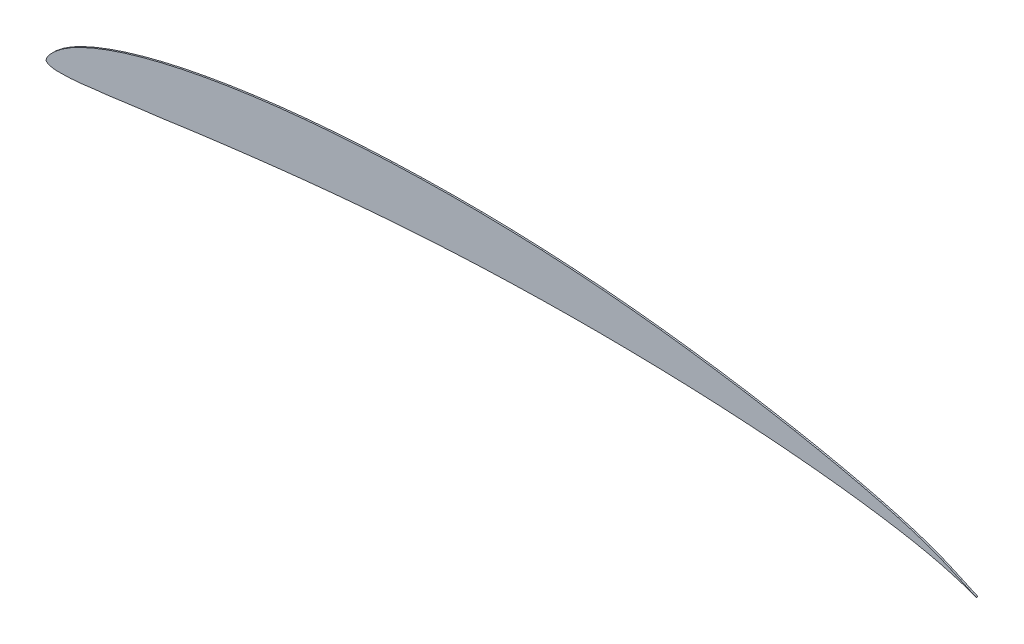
ISO-10303-21;
HEADER;
FILE_DESCRIPTION(('STEP AP214'),'2;1');
FILE_NAME('part.step','',(''),(''),'','','');
FILE_SCHEMA(('AUTOMOTIVE_DESIGN { 1 0 10303 214 1 1 1 1 }'));
ENDSEC;
DATA;
#1=APPLICATION_CONTEXT('core data for automotive mechanical design processes');
#2=APPLICATION_PROTOCOL_DEFINITION('international standard','automotive_design',2000,#1);
#3=PRODUCT_CONTEXT('',#1,'mechanical');
#4=PRODUCT('Part','Part','',(#3));
#5=PRODUCT_RELATED_PRODUCT_CATEGORY('part','',(#4));
#6=PRODUCT_DEFINITION_FORMATION('','',#4);
#7=PRODUCT_DEFINITION_CONTEXT('part definition',#1,'design');
#8=PRODUCT_DEFINITION('design','',#6,#7);
#9=PRODUCT_DEFINITION_SHAPE('','',#8);
#10=(LENGTH_UNIT() NAMED_UNIT(*) SI_UNIT(.MILLI.,.METRE.));
#11=(NAMED_UNIT(*) PLANE_ANGLE_UNIT() SI_UNIT($,.RADIAN.));
#12=(NAMED_UNIT(*) SI_UNIT($,.STERADIAN.) SOLID_ANGLE_UNIT());
#13=UNCERTAINTY_MEASURE_WITH_UNIT(LENGTH_MEASURE(1.E-05),#10,'distance_accuracy_value','');
#14=(GEOMETRIC_REPRESENTATION_CONTEXT(3) GLOBAL_UNCERTAINTY_ASSIGNED_CONTEXT((#13)) GLOBAL_UNIT_ASSIGNED_CONTEXT((#10,
#11,#12)) REPRESENTATION_CONTEXT('',''));
#15=CARTESIAN_POINT('',(0.,0.,0.));
#16=DIRECTION('',(0.,0.,1.));
#17=DIRECTION('',(1.,0.,0.));
#18=AXIS2_PLACEMENT_3D('',#15,#16,#17);
#19=CARTESIAN_POINT('',(-65.211,13.1939999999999,0.125));
#20=DIRECTION('',(-0.0728932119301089,-0.997339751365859,0.));
#21=DIRECTION('',(0.997339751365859,-0.0728932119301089,0.));
#22=AXIS2_PLACEMENT_3D('',#19,#20,#21);
#23=PLANE('',#22);
#24=DIRECTION('',(-0.997339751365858,0.0728932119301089,0.));
#25=VECTOR('',#24,1.);
#26=CARTESIAN_POINT('',(-65.211,13.1939999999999,-0.125));
#27=LINE('',#26,#25);
#28=CARTESIAN_POINT('',(-60.3675,12.84,-0.125));
#29=VERTEX_POINT('',#28);
#30=CARTESIAN_POINT('',(-65.211,13.1939999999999,-0.125));
#31=VERTEX_POINT('',#30);
#32=EDGE_CURVE('E946',#29,#31,#27,.T.);
#33=ORIENTED_EDGE('',*,*,#32,.T.);
#34=DIRECTION('',(0.,0.,-1.));
#35=VECTOR('',#34,1.);
#36=CARTESIAN_POINT('',(-65.211,13.1939999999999,0.125));
#37=LINE('',#36,#35);
#38=CARTESIAN_POINT('',(-65.211,13.1939999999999,0.125));
#39=VERTEX_POINT('',#38);
#40=EDGE_CURVE('E11',#39,#31,#37,.T.);
#41=ORIENTED_EDGE('',*,*,#40,.F.);
#42=DIRECTION('',(-0.997339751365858,0.0728932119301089,0.));
#43=VECTOR('',#42,1.);
#44=CARTESIAN_POINT('',(-65.211,13.1939999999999,0.125));
#45=LINE('',#44,#43);
#46=CARTESIAN_POINT('',(-60.3675,12.84,0.125));
#47=VERTEX_POINT('',#46);
#48=EDGE_CURVE('E1149',#47,#39,#45,.T.);
#49=ORIENTED_EDGE('',*,*,#48,.F.);
#50=DIRECTION('',(0.,0.,-1.));
#51=VECTOR('',#50,1.);
#52=CARTESIAN_POINT('',(-60.3675,12.84,0.125));
#53=LINE('',#52,#51);
#54=EDGE_CURVE('E959',#47,#29,#53,.T.);
#55=ORIENTED_EDGE('',*,*,#54,.T.);
#56=EDGE_LOOP('',(#33,#41,#49,#55));
#57=FACE_BOUND('',#56,.T.);
#58=ADVANCED_FACE('F350',(#57),#23,.F.);
#59=CARTESIAN_POINT('',(-70.0950000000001,13.4624999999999,0.125));
#60=DIRECTION('',(-0.0548925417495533,-0.998492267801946,0.));
#61=DIRECTION('',(0.998492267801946,-0.0548925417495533,0.));
#62=AXIS2_PLACEMENT_3D('',#59,#60,#61);
#63=PLANE('',#62);
#64=DIRECTION('',(-0.998492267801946,0.0548925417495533,0.));
#65=VECTOR('',#64,1.);
#66=CARTESIAN_POINT('',(-70.0950000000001,13.4624999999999,-0.125));
#67=LINE('',#66,#65);
#68=CARTESIAN_POINT('',(-70.0950000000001,13.4624999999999,-0.125));
#69=VERTEX_POINT('',#68);
#70=EDGE_CURVE('E942',#31,#69,#67,.T.);
#71=ORIENTED_EDGE('',*,*,#70,.T.);
#72=DIRECTION('',(0.,0.,-1.));
#73=VECTOR('',#72,1.);
#74=CARTESIAN_POINT('',(-70.0950000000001,13.4624999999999,0.125));
#75=LINE('',#74,#73);
#76=CARTESIAN_POINT('',(-70.0950000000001,13.4624999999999,0.125));
#77=VERTEX_POINT('',#76);
#78=EDGE_CURVE('E357',#77,#69,#75,.T.);
#79=ORIENTED_EDGE('',*,*,#78,.F.);
#80=DIRECTION('',(-0.998492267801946,0.0548925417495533,0.));
#81=VECTOR('',#80,1.);
#82=CARTESIAN_POINT('',(-70.0950000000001,13.4624999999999,0.125));
#83=LINE('',#82,#81);
#84=EDGE_CURVE('E955',#39,#77,#83,.T.);
#85=ORIENTED_EDGE('',*,*,#84,.F.);
#86=ORIENTED_EDGE('',*,*,#40,.T.);
#87=EDGE_LOOP('',(#71,#79,#85,#86));
#88=FACE_BOUND('',#87,.T.);
#89=ADVANCED_FACE('F954',(#88),#63,.F.);
#90=CARTESIAN_POINT('',(-75.0000000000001,13.6425,0.125));
#91=DIRECTION('',(-0.0366725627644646,-0.999327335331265,0.));
#92=DIRECTION('',(0.999327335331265,-0.0366725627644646,0.));
#93=AXIS2_PLACEMENT_3D('',#90,#91,#92);
#94=PLANE('',#93);
#95=DIRECTION('',(-0.999327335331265,0.0366725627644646,0.));
#96=VECTOR('',#95,1.);
#97=CARTESIAN_POINT('',(-75.0000000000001,13.6425,-0.125));
#98=LINE('',#97,#96);
#99=CARTESIAN_POINT('',(-75.0000000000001,13.6425,-0.125));
#100=VERTEX_POINT('',#99);
#101=EDGE_CURVE('E948',#69,#100,#98,.T.);
#102=ORIENTED_EDGE('',*,*,#101,.T.);
#103=DIRECTION('',(0.,0.,-1.));
#104=VECTOR('',#103,1.);
#105=CARTESIAN_POINT('',(-75.0000000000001,13.6425,0.125));
#106=LINE('',#105,#104);
#107=CARTESIAN_POINT('',(-75.0000000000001,13.6425,0.125));
#108=VERTEX_POINT('',#107);
#109=EDGE_CURVE('E1615',#108,#100,#106,.T.);
#110=ORIENTED_EDGE('',*,*,#109,.F.);
#111=DIRECTION('',(-0.999327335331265,0.0366725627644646,0.));
#112=VECTOR('',#111,1.);
#113=CARTESIAN_POINT('',(-75.0000000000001,13.6425,0.125));
#114=LINE('',#113,#112);
#115=EDGE_CURVE('E1152',#77,#108,#114,.T.);
#116=ORIENTED_EDGE('',*,*,#115,.F.);
#117=ORIENTED_EDGE('',*,*,#78,.T.);
#118=EDGE_LOOP('',(#102,#110,#116,#117));
#119=FACE_BOUND('',#118,.T.);
#120=ADVANCED_FACE('F1619',(#119),#94,.F.);
#121=CARTESIAN_POINT('',(-79.905,13.7369999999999,0.125));
#122=DIRECTION('',(-0.0192624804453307,-0.999814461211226,0.));
#123=DIRECTION('',(0.999814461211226,-0.0192624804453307,0.));
#124=AXIS2_PLACEMENT_3D('',#121,#122,#123);
#125=PLANE('',#124);
#126=DIRECTION('',(-0.999814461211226,0.0192624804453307,0.));
#127=VECTOR('',#126,1.);
#128=CARTESIAN_POINT('',(-79.905,13.7369999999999,-0.125));
#129=LINE('',#128,#127);
#130=CARTESIAN_POINT('',(-79.905,13.7369999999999,-0.125));
#131=VERTEX_POINT('',#130);
#132=EDGE_CURVE('E963',#100,#131,#129,.T.);
#133=ORIENTED_EDGE('',*,*,#132,.T.);
#134=DIRECTION('',(0.,0.,-1.));
#135=VECTOR('',#134,1.);
#136=CARTESIAN_POINT('',(-79.905,13.7369999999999,0.125));
#137=LINE('',#136,#135);
#138=CARTESIAN_POINT('',(-79.905,13.7369999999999,0.125));
#139=VERTEX_POINT('',#138);
#140=EDGE_CURVE('E1612',#139,#131,#137,.T.);
#141=ORIENTED_EDGE('',*,*,#140,.F.);
#142=DIRECTION('',(-0.999814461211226,0.0192624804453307,0.));
#143=VECTOR('',#142,1.);
#144=CARTESIAN_POINT('',(-79.905,13.7369999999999,0.125));
#145=LINE('',#144,#143);
#146=EDGE_CURVE('E1154',#108,#139,#145,.T.);
#147=ORIENTED_EDGE('',*,*,#146,.F.);
#148=ORIENTED_EDGE('',*,*,#109,.T.);
#149=EDGE_LOOP('',(#133,#141,#147,#148));
#150=FACE_BOUND('',#149,.T.);
#151=ADVANCED_FACE('F1627',(#150),#125,.F.);
#152=CARTESIAN_POINT('',(-84.789,13.7460000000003,0.125));
#153=DIRECTION('',(-0.00184274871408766,-0.999998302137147,0.));
#154=DIRECTION('',(0.999998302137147,-0.00184274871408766,0.));
#155=AXIS2_PLACEMENT_3D('',#152,#153,#154);
#156=PLANE('',#155);
#157=DIRECTION('',(-0.999998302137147,0.00184274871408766,0.));
#158=VECTOR('',#157,1.);
#159=CARTESIAN_POINT('',(-84.789,13.7460000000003,-0.125));
#160=LINE('',#159,#158);
#161=CARTESIAN_POINT('',(-84.789,13.7460000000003,-0.125));
#162=VERTEX_POINT('',#161);
#163=EDGE_CURVE('E965',#131,#162,#160,.T.);
#164=ORIENTED_EDGE('',*,*,#163,.T.);
#165=DIRECTION('',(0.,0.,-1.));
#166=VECTOR('',#165,1.);
#167=CARTESIAN_POINT('',(-84.789,13.7460000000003,0.125));
#168=LINE('',#167,#166);
#169=CARTESIAN_POINT('',(-84.789,13.7460000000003,0.125));
#170=VERTEX_POINT('',#169);
#171=EDGE_CURVE('E1609',#170,#162,#168,.T.);
#172=ORIENTED_EDGE('',*,*,#171,.F.);
#173=DIRECTION('',(-0.999998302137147,0.00184274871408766,0.));
#174=VECTOR('',#173,1.);
#175=CARTESIAN_POINT('',(-84.789,13.7460000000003,0.125));
#176=LINE('',#175,#174);
#177=EDGE_CURVE('E1156',#139,#170,#176,.T.);
#178=ORIENTED_EDGE('',*,*,#177,.F.);
#179=ORIENTED_EDGE('',*,*,#140,.T.);
#180=EDGE_LOOP('',(#164,#172,#178,#179));
#181=FACE_BOUND('',#180,.T.);
#182=ADVANCED_FACE('F1630',(#181),#156,.F.);
#183=CARTESIAN_POINT('',(-89.6325,13.674,0.125));
#184=DIRECTION('',(0.0148636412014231,-0.999889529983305,0.));
#185=DIRECTION('',(0.999889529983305,0.0148636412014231,0.));
#186=AXIS2_PLACEMENT_3D('',#183,#184,#185);
#187=PLANE('',#186);
#188=DIRECTION('',(-0.999889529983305,-0.0148636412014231,0.));
#189=VECTOR('',#188,1.);
#190=CARTESIAN_POINT('',(-89.6325,13.674,-0.125));
#191=LINE('',#190,#189);
#192=CARTESIAN_POINT('',(-89.6325,13.674,-0.125));
#193=VERTEX_POINT('',#192);
#194=EDGE_CURVE('E967',#162,#193,#191,.T.);
#195=ORIENTED_EDGE('',*,*,#194,.T.);
#196=DIRECTION('',(0.,0.,-1.));
#197=VECTOR('',#196,1.);
#198=CARTESIAN_POINT('',(-89.6325,13.674,0.125));
#199=LINE('',#198,#197);
#200=CARTESIAN_POINT('',(-89.6325,13.674,0.125));
#201=VERTEX_POINT('',#200);
#202=EDGE_CURVE('E1606',#201,#193,#199,.T.);
#203=ORIENTED_EDGE('',*,*,#202,.F.);
#204=DIRECTION('',(-0.999889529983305,-0.0148636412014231,0.));
#205=VECTOR('',#204,1.);
#206=CARTESIAN_POINT('',(-89.6325,13.674,0.125));
#207=LINE('',#206,#205);
#208=EDGE_CURVE('E1158',#170,#201,#207,.T.);
#209=ORIENTED_EDGE('',*,*,#208,.F.);
#210=ORIENTED_EDGE('',*,*,#171,.T.);
#211=EDGE_LOOP('',(#195,#203,#209,#210));
#212=FACE_BOUND('',#211,.T.);
#213=ADVANCED_FACE('F1635',(#212),#187,.F.);
#214=CARTESIAN_POINT('',(-94.4115,13.5240000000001,0.125));
#215=DIRECTION('',(0.0313718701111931,-0.999507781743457,0.));
#216=DIRECTION('',(0.999507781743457,0.0313718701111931,0.));
#217=AXIS2_PLACEMENT_3D('',#214,#215,#216);
#218=PLANE('',#217);
#219=DIRECTION('',(-0.999507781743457,-0.0313718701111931,0.));
#220=VECTOR('',#219,1.);
#221=CARTESIAN_POINT('',(-94.4115,13.5240000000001,-0.125));
#222=LINE('',#221,#220);
#223=CARTESIAN_POINT('',(-94.4115,13.5240000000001,-0.125));
#224=VERTEX_POINT('',#223);
#225=EDGE_CURVE('E969',#193,#224,#222,.T.);
#226=ORIENTED_EDGE('',*,*,#225,.T.);
#227=DIRECTION('',(0.,0.,-1.));
#228=VECTOR('',#227,1.);
#229=CARTESIAN_POINT('',(-94.4115,13.5240000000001,0.125));
#230=LINE('',#229,#228);
#231=CARTESIAN_POINT('',(-94.4115,13.5240000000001,0.125));
#232=VERTEX_POINT('',#231);
#233=EDGE_CURVE('E1603',#232,#224,#230,.T.);
#234=ORIENTED_EDGE('',*,*,#233,.F.);
#235=DIRECTION('',(-0.999507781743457,-0.0313718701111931,0.));
#236=VECTOR('',#235,1.);
#237=CARTESIAN_POINT('',(-94.4115,13.5240000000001,0.125));
#238=LINE('',#237,#236);
#239=EDGE_CURVE('E1160',#201,#232,#238,.T.);
#240=ORIENTED_EDGE('',*,*,#239,.F.);
#241=ORIENTED_EDGE('',*,*,#202,.T.);
#242=EDGE_LOOP('',(#226,#234,#240,#241));
#243=FACE_BOUND('',#242,.T.);
#244=ADVANCED_FACE('F1641',(#243),#218,.F.);
#245=CARTESIAN_POINT('',(-99.108,13.2945,0.125));
#246=DIRECTION('',(0.0488079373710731,-0.998808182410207,0.));
#247=DIRECTION('',(0.998808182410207,0.0488079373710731,0.));
#248=AXIS2_PLACEMENT_3D('',#245,#246,#247);
#249=PLANE('',#248);
#250=DIRECTION('',(-0.998808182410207,-0.0488079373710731,0.));
#251=VECTOR('',#250,1.);
#252=CARTESIAN_POINT('',(-99.108,13.2945,-0.125));
#253=LINE('',#252,#251);
#254=CARTESIAN_POINT('',(-99.108,13.2945,-0.125));
#255=VERTEX_POINT('',#254);
#256=EDGE_CURVE('E971',#224,#255,#253,.T.);
#257=ORIENTED_EDGE('',*,*,#256,.T.);
#258=DIRECTION('',(0.,0.,-1.));
#259=VECTOR('',#258,1.);
#260=CARTESIAN_POINT('',(-99.108,13.2945,0.125));
#261=LINE('',#260,#259);
#262=CARTESIAN_POINT('',(-99.108,13.2945,0.125));
#263=VERTEX_POINT('',#262);
#264=EDGE_CURVE('E1600',#263,#255,#261,.T.);
#265=ORIENTED_EDGE('',*,*,#264,.F.);
#266=DIRECTION('',(-0.998808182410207,-0.0488079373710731,0.));
#267=VECTOR('',#266,1.);
#268=CARTESIAN_POINT('',(-99.108,13.2945,0.125));
#269=LINE('',#268,#267);
#270=EDGE_CURVE('E1162',#232,#263,#269,.T.);
#271=ORIENTED_EDGE('',*,*,#270,.F.);
#272=ORIENTED_EDGE('',*,*,#233,.T.);
#273=EDGE_LOOP('',(#257,#265,#271,#272));
#274=FACE_BOUND('',#273,.T.);
#275=ADVANCED_FACE('F1645',(#274),#249,.F.);
#276=CARTESIAN_POINT('',(-103.701,12.9900000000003,0.125));
#277=DIRECTION('',(0.0661513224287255,-0.997809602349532,0.));
#278=DIRECTION('',(0.997809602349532,0.0661513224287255,0.));
#279=AXIS2_PLACEMENT_3D('',#276,#277,#278);
#280=PLANE('',#279);
#281=DIRECTION('',(-0.997809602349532,-0.0661513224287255,0.));
#282=VECTOR('',#281,1.);
#283=CARTESIAN_POINT('',(-103.701,12.9900000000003,-0.125));
#284=LINE('',#283,#282);
#285=CARTESIAN_POINT('',(-103.701,12.9900000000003,-0.125));
#286=VERTEX_POINT('',#285);
#287=EDGE_CURVE('E973',#255,#286,#284,.T.);
#288=ORIENTED_EDGE('',*,*,#287,.T.);
#289=DIRECTION('',(0.,0.,-1.));
#290=VECTOR('',#289,1.);
#291=CARTESIAN_POINT('',(-103.701,12.9900000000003,0.125));
#292=LINE('',#291,#290);
#293=CARTESIAN_POINT('',(-103.701,12.9900000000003,0.125));
#294=VERTEX_POINT('',#293);
#295=EDGE_CURVE('E1597',#294,#286,#292,.T.);
#296=ORIENTED_EDGE('',*,*,#295,.F.);
#297=DIRECTION('',(-0.997809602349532,-0.0661513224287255,0.));
#298=VECTOR('',#297,1.);
#299=CARTESIAN_POINT('',(-103.701,12.9900000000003,0.125));
#300=LINE('',#299,#298);
#301=EDGE_CURVE('E1164',#263,#294,#300,.T.);
#302=ORIENTED_EDGE('',*,*,#301,.F.);
#303=ORIENTED_EDGE('',*,*,#264,.T.);
#304=EDGE_LOOP('',(#288,#296,#302,#303));
#305=FACE_BOUND('',#304,.T.);
#306=ADVANCED_FACE('F1650',(#305),#280,.F.);
#307=CARTESIAN_POINT('',(-108.171,12.6104999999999,0.125));
#308=DIRECTION('',(0.0845950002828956,-0.996415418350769,0.));
#309=DIRECTION('',(0.996415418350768,0.0845950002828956,0.));
#310=AXIS2_PLACEMENT_3D('',#307,#308,#309);
#311=PLANE('',#310);
#312=DIRECTION('',(-0.996415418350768,-0.0845950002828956,0.));
#313=VECTOR('',#312,1.);
#314=CARTESIAN_POINT('',(-108.171,12.6104999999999,-0.125));
#315=LINE('',#314,#313);
#316=CARTESIAN_POINT('',(-108.171,12.6104999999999,-0.125));
#317=VERTEX_POINT('',#316);
#318=EDGE_CURVE('E975',#286,#317,#315,.T.);
#319=ORIENTED_EDGE('',*,*,#318,.T.);
#320=DIRECTION('',(0.,0.,-1.));
#321=VECTOR('',#320,1.);
#322=CARTESIAN_POINT('',(-108.171,12.6104999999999,0.125));
#323=LINE('',#322,#321);
#324=CARTESIAN_POINT('',(-108.171,12.6104999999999,0.125));
#325=VERTEX_POINT('',#324);
#326=EDGE_CURVE('E1594',#325,#317,#323,.T.);
#327=ORIENTED_EDGE('',*,*,#326,.F.);
#328=DIRECTION('',(-0.996415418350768,-0.0845950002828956,0.));
#329=VECTOR('',#328,1.);
#330=CARTESIAN_POINT('',(-108.171,12.6104999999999,0.125));
#331=LINE('',#330,#329);
#332=EDGE_CURVE('E1166',#294,#325,#331,.T.);
#333=ORIENTED_EDGE('',*,*,#332,.F.);
#334=ORIENTED_EDGE('',*,*,#295,.T.);
#335=EDGE_LOOP('',(#319,#327,#333,#334));
#336=FACE_BOUND('',#335,.T.);
#337=ADVANCED_FACE('F1656',(#336),#311,.F.);
#338=CARTESIAN_POINT('',(-112.5,12.1605,0.125));
#339=DIRECTION('',(0.103392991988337,-0.994640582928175,0.));
#340=DIRECTION('',(0.994640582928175,0.103392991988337,0.));
#341=AXIS2_PLACEMENT_3D('',#338,#339,#340);
#342=PLANE('',#341);
#343=DIRECTION('',(-0.994640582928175,-0.103392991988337,0.));
#344=VECTOR('',#343,1.);
#345=CARTESIAN_POINT('',(-112.5,12.1605,-0.125));
#346=LINE('',#345,#344);
#347=CARTESIAN_POINT('',(-112.5,12.1605,-0.125));
#348=VERTEX_POINT('',#347);
#349=EDGE_CURVE('E977',#317,#348,#346,.T.);
#350=ORIENTED_EDGE('',*,*,#349,.T.);
#351=DIRECTION('',(0.,0.,-1.));
#352=VECTOR('',#351,1.);
#353=CARTESIAN_POINT('',(-112.5,12.1605,0.125));
#354=LINE('',#353,#352);
#355=CARTESIAN_POINT('',(-112.5,12.1605,0.125));
#356=VERTEX_POINT('',#355);
#357=EDGE_CURVE('E1591',#356,#348,#354,.T.);
#358=ORIENTED_EDGE('',*,*,#357,.F.);
#359=DIRECTION('',(-0.994640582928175,-0.103392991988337,0.));
#360=VECTOR('',#359,1.);
#361=CARTESIAN_POINT('',(-112.5,12.1605,0.125));
#362=LINE('',#361,#360);
#363=EDGE_CURVE('E1168',#325,#356,#362,.T.);
#364=ORIENTED_EDGE('',*,*,#363,.F.);
#365=ORIENTED_EDGE('',*,*,#326,.T.);
#366=EDGE_LOOP('',(#350,#358,#364,#365));
#367=FACE_BOUND('',#366,.T.);
#368=ADVANCED_FACE('F1660',(#367),#342,.F.);
#369=CARTESIAN_POINT('',(-116.6685,11.6415000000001,0.125));
#370=DIRECTION('',(0.12355128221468,-0.992338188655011,0.));
#371=DIRECTION('',(0.992338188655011,0.12355128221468,0.));
#372=AXIS2_PLACEMENT_3D('',#369,#370,#371);
#373=PLANE('',#372);
#374=DIRECTION('',(-0.992338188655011,-0.12355128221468,0.));
#375=VECTOR('',#374,1.);
#376=CARTESIAN_POINT('',(-116.6685,11.6415000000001,-0.125));
#377=LINE('',#376,#375);
#378=CARTESIAN_POINT('',(-116.6685,11.6415000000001,-0.125));
#379=VERTEX_POINT('',#378);
#380=EDGE_CURVE('E979',#348,#379,#377,.T.);
#381=ORIENTED_EDGE('',*,*,#380,.T.);
#382=DIRECTION('',(0.,0.,-1.));
#383=VECTOR('',#382,1.);
#384=CARTESIAN_POINT('',(-116.6685,11.6415000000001,0.125));
#385=LINE('',#384,#383);
#386=CARTESIAN_POINT('',(-116.6685,11.6415000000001,0.125));
#387=VERTEX_POINT('',#386);
#388=EDGE_CURVE('E1588',#387,#379,#385,.T.);
#389=ORIENTED_EDGE('',*,*,#388,.F.);
#390=DIRECTION('',(-0.992338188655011,-0.12355128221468,0.));
#391=VECTOR('',#390,1.);
#392=CARTESIAN_POINT('',(-116.6685,11.6415000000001,0.125));
#393=LINE('',#392,#391);
#394=EDGE_CURVE('E1170',#356,#387,#393,.T.);
#395=ORIENTED_EDGE('',*,*,#394,.F.);
#396=ORIENTED_EDGE('',*,*,#357,.T.);
#397=EDGE_LOOP('',(#381,#389,#395,#396));
#398=FACE_BOUND('',#397,.T.);
#399=ADVANCED_FACE('F1665',(#398),#373,.F.);
#400=CARTESIAN_POINT('',(-120.657,11.0565000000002,0.125));
#401=DIRECTION('',(0.145119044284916,-0.989414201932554,0.));
#402=DIRECTION('',(0.989414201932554,0.145119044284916,0.));
#403=AXIS2_PLACEMENT_3D('',#400,#401,#402);
#404=PLANE('',#403);
#405=DIRECTION('',(-0.989414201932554,-0.145119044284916,0.));
#406=VECTOR('',#405,1.);
#407=CARTESIAN_POINT('',(-120.657,11.0565000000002,-0.125));
#408=LINE('',#407,#406);
#409=CARTESIAN_POINT('',(-120.657,11.0565000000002,-0.125));
#410=VERTEX_POINT('',#409);
#411=EDGE_CURVE('E981',#379,#410,#408,.T.);
#412=ORIENTED_EDGE('',*,*,#411,.T.);
#413=DIRECTION('',(0.,0.,-1.));
#414=VECTOR('',#413,1.);
#415=CARTESIAN_POINT('',(-120.657,11.0565000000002,0.125));
#416=LINE('',#415,#414);
#417=CARTESIAN_POINT('',(-120.657,11.0565000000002,0.125));
#418=VERTEX_POINT('',#417);
#419=EDGE_CURVE('E1585',#418,#410,#416,.T.);
#420=ORIENTED_EDGE('',*,*,#419,.F.);
#421=DIRECTION('',(-0.989414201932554,-0.145119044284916,0.));
#422=VECTOR('',#421,1.);
#423=CARTESIAN_POINT('',(-120.657,11.0565000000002,0.125));
#424=LINE('',#423,#422);
#425=EDGE_CURVE('E1172',#387,#418,#424,.T.);
#426=ORIENTED_EDGE('',*,*,#425,.F.);
#427=ORIENTED_EDGE('',*,*,#388,.T.);
#428=EDGE_LOOP('',(#412,#420,#426,#427));
#429=FACE_BOUND('',#428,.T.);
#430=ADVANCED_FACE('F1671',(#429),#404,.F.);
#431=CARTESIAN_POINT('',(-124.4505,10.4115000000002,0.125));
#432=DIRECTION('',(0.167622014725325,-0.985851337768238,0.));
#433=DIRECTION('',(0.985851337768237,0.167622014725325,0.));
#434=AXIS2_PLACEMENT_3D('',#431,#432,#433);
#435=PLANE('',#434);
#436=DIRECTION('',(-0.985851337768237,-0.167622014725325,0.));
#437=VECTOR('',#436,1.);
#438=CARTESIAN_POINT('',(-124.4505,10.4115000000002,-0.125));
#439=LINE('',#438,#437);
#440=CARTESIAN_POINT('',(-124.4505,10.4115000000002,-0.125));
#441=VERTEX_POINT('',#440);
#442=EDGE_CURVE('E983',#410,#441,#439,.T.);
#443=ORIENTED_EDGE('',*,*,#442,.T.);
#444=DIRECTION('',(0.,0.,-1.));
#445=VECTOR('',#444,1.);
#446=CARTESIAN_POINT('',(-124.4505,10.4115000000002,0.125));
#447=LINE('',#446,#445);
#448=CARTESIAN_POINT('',(-124.4505,10.4115000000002,0.125));
#449=VERTEX_POINT('',#448);
#450=EDGE_CURVE('E1582',#449,#441,#447,.T.);
#451=ORIENTED_EDGE('',*,*,#450,.F.);
#452=DIRECTION('',(-0.985851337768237,-0.167622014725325,0.));
#453=VECTOR('',#452,1.);
#454=CARTESIAN_POINT('',(-124.4505,10.4115000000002,0.125));
#455=LINE('',#454,#453);
#456=EDGE_CURVE('E1174',#418,#449,#455,.T.);
#457=ORIENTED_EDGE('',*,*,#456,.F.);
#458=ORIENTED_EDGE('',*,*,#419,.T.);
#459=EDGE_LOOP('',(#443,#451,#457,#458));
#460=FACE_BOUND('',#459,.T.);
#461=ADVANCED_FACE('F1675',(#460),#435,.F.);
#462=CARTESIAN_POINT('',(-128.0325,9.70950000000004,0.125));
#463=DIRECTION('',(0.192321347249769,-0.981332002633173,0.));
#464=DIRECTION('',(0.981332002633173,0.192321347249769,0.));
#465=AXIS2_PLACEMENT_3D('',#462,#463,#464);
#466=PLANE('',#465);
#467=DIRECTION('',(-0.981332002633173,-0.192321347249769,0.));
#468=VECTOR('',#467,1.);
#469=CARTESIAN_POINT('',(-128.0325,9.70950000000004,-0.125));
#470=LINE('',#469,#468);
#471=CARTESIAN_POINT('',(-128.0325,9.70950000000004,-0.125));
#472=VERTEX_POINT('',#471);
#473=EDGE_CURVE('E985',#441,#472,#470,.T.);
#474=ORIENTED_EDGE('',*,*,#473,.T.);
#475=DIRECTION('',(0.,0.,-1.));
#476=VECTOR('',#475,1.);
#477=CARTESIAN_POINT('',(-128.0325,9.70950000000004,0.125));
#478=LINE('',#477,#476);
#479=CARTESIAN_POINT('',(-128.0325,9.70950000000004,0.125));
#480=VERTEX_POINT('',#479);
#481=EDGE_CURVE('E1579',#480,#472,#478,.T.);
#482=ORIENTED_EDGE('',*,*,#481,.F.);
#483=DIRECTION('',(-0.981332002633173,-0.192321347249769,0.));
#484=VECTOR('',#483,1.);
#485=CARTESIAN_POINT('',(-128.0325,9.70950000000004,0.125));
#486=LINE('',#485,#484);
#487=EDGE_CURVE('E1176',#449,#480,#486,.T.);
#488=ORIENTED_EDGE('',*,*,#487,.F.);
#489=ORIENTED_EDGE('',*,*,#450,.T.);
#490=EDGE_LOOP('',(#474,#482,#488,#489));
#491=FACE_BOUND('',#490,.T.);
#492=ADVANCED_FACE('F1680',(#491),#466,.F.);
#493=CARTESIAN_POINT('',(-131.388,8.95500000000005,0.125));
#494=DIRECTION('',(0.219377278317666,-0.975640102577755,0.));
#495=DIRECTION('',(0.975640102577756,0.219377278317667,0.));
#496=AXIS2_PLACEMENT_3D('',#493,#494,#495);
#497=PLANE('',#496);
#498=DIRECTION('',(-0.975640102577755,-0.219377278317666,0.));
#499=VECTOR('',#498,1.);
#500=CARTESIAN_POINT('',(-131.388,8.95500000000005,-0.125));
#501=LINE('',#500,#499);
#502=CARTESIAN_POINT('',(-131.388,8.95500000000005,-0.125));
#503=VERTEX_POINT('',#502);
#504=EDGE_CURVE('E987',#472,#503,#501,.T.);
#505=ORIENTED_EDGE('',*,*,#504,.T.);
#506=DIRECTION('',(0.,0.,-1.));
#507=VECTOR('',#506,1.);
#508=CARTESIAN_POINT('',(-131.388,8.95500000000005,0.125));
#509=LINE('',#508,#507);
#510=CARTESIAN_POINT('',(-131.388,8.95500000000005,0.125));
#511=VERTEX_POINT('',#510);
#512=EDGE_CURVE('E1576',#511,#503,#509,.T.);
#513=ORIENTED_EDGE('',*,*,#512,.F.);
#514=DIRECTION('',(-0.975640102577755,-0.219377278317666,0.));
#515=VECTOR('',#514,1.);
#516=CARTESIAN_POINT('',(-131.388,8.95500000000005,0.125));
#517=LINE('',#516,#515);
#518=EDGE_CURVE('E1178',#480,#511,#517,.T.);
#519=ORIENTED_EDGE('',*,*,#518,.F.);
#520=ORIENTED_EDGE('',*,*,#481,.T.);
#521=EDGE_LOOP('',(#505,#513,#519,#520));
#522=FACE_BOUND('',#521,.T.);
#523=ADVANCED_FACE('F1686',(#522),#497,.F.);
#524=CARTESIAN_POINT('',(-134.502,8.15549999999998,0.125));
#525=DIRECTION('',(0.248678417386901,-0.968586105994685,0.));
#526=DIRECTION('',(0.968586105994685,0.248678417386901,0.));
#527=AXIS2_PLACEMENT_3D('',#524,#525,#526);
#528=PLANE('',#527);
#529=DIRECTION('',(-0.968586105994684,-0.248678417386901,0.));
#530=VECTOR('',#529,1.);
#531=CARTESIAN_POINT('',(-134.502,8.15549999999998,-0.125));
#532=LINE('',#531,#530);
#533=CARTESIAN_POINT('',(-134.502,8.15549999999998,-0.125));
#534=VERTEX_POINT('',#533);
#535=EDGE_CURVE('E989',#503,#534,#532,.T.);
#536=ORIENTED_EDGE('',*,*,#535,.T.);
#537=DIRECTION('',(0.,0.,-1.));
#538=VECTOR('',#537,1.);
#539=CARTESIAN_POINT('',(-134.502,8.15549999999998,0.125));
#540=LINE('',#539,#538);
#541=CARTESIAN_POINT('',(-134.502,8.15549999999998,0.125));
#542=VERTEX_POINT('',#541);
#543=EDGE_CURVE('E1573',#542,#534,#540,.T.);
#544=ORIENTED_EDGE('',*,*,#543,.F.);
#545=DIRECTION('',(-0.968586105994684,-0.248678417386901,0.));
#546=VECTOR('',#545,1.);
#547=CARTESIAN_POINT('',(-134.502,8.15549999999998,0.125));
#548=LINE('',#547,#546);
#549=EDGE_CURVE('E1180',#511,#542,#548,.T.);
#550=ORIENTED_EDGE('',*,*,#549,.F.);
#551=ORIENTED_EDGE('',*,*,#512,.T.);
#552=EDGE_LOOP('',(#536,#544,#550,#551));
#553=FACE_BOUND('',#552,.T.);
#554=ADVANCED_FACE('F1690',(#553),#528,.F.);
#555=CARTESIAN_POINT('',(-137.3595,7.31550000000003,0.125));
#556=DIRECTION('',(0.282029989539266,-0.959405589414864,0.));
#557=DIRECTION('',(0.959405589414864,0.282029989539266,0.));
#558=AXIS2_PLACEMENT_3D('',#555,#556,#557);
#559=PLANE('',#558);
#560=DIRECTION('',(-0.959405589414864,-0.282029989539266,0.));
#561=VECTOR('',#560,1.);
#562=CARTESIAN_POINT('',(-137.3595,7.31550000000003,-0.125));
#563=LINE('',#562,#561);
#564=CARTESIAN_POINT('',(-137.3595,7.31550000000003,-0.125));
#565=VERTEX_POINT('',#564);
#566=EDGE_CURVE('E991',#534,#565,#563,.T.);
#567=ORIENTED_EDGE('',*,*,#566,.T.);
#568=DIRECTION('',(0.,0.,-1.));
#569=VECTOR('',#568,1.);
#570=CARTESIAN_POINT('',(-137.3595,7.31550000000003,0.125));
#571=LINE('',#570,#569);
#572=CARTESIAN_POINT('',(-137.3595,7.31550000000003,0.125));
#573=VERTEX_POINT('',#572);
#574=EDGE_CURVE('E1570',#573,#565,#571,.T.);
#575=ORIENTED_EDGE('',*,*,#574,.F.);
#576=DIRECTION('',(-0.959405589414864,-0.282029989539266,0.));
#577=VECTOR('',#576,1.);
#578=CARTESIAN_POINT('',(-137.3595,7.31550000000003,0.125));
#579=LINE('',#578,#577);
#580=EDGE_CURVE('E1182',#542,#573,#579,.T.);
#581=ORIENTED_EDGE('',*,*,#580,.F.);
#582=ORIENTED_EDGE('',*,*,#543,.T.);
#583=EDGE_LOOP('',(#567,#575,#581,#582));
#584=FACE_BOUND('',#583,.T.);
#585=ADVANCED_FACE('F1695',(#584),#559,.F.);
#586=CARTESIAN_POINT('',(-139.9515,6.4455000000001,0.125));
#587=DIRECTION('',(0.318202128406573,-0.948022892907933,0.));
#588=DIRECTION('',(0.948022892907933,0.318202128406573,0.));
#589=AXIS2_PLACEMENT_3D('',#586,#587,#588);
#590=PLANE('',#589);
#591=DIRECTION('',(-0.948022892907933,-0.318202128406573,0.));
#592=VECTOR('',#591,1.);
#593=CARTESIAN_POINT('',(-139.9515,6.4455000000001,-0.125));
#594=LINE('',#593,#592);
#595=CARTESIAN_POINT('',(-139.9515,6.4455000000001,-0.125));
#596=VERTEX_POINT('',#595);
#597=EDGE_CURVE('E993',#565,#596,#594,.T.);
#598=ORIENTED_EDGE('',*,*,#597,.T.);
#599=DIRECTION('',(0.,0.,-1.));
#600=VECTOR('',#599,1.);
#601=CARTESIAN_POINT('',(-139.9515,6.4455000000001,0.125));
#602=LINE('',#601,#600);
#603=CARTESIAN_POINT('',(-139.9515,6.4455000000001,0.125));
#604=VERTEX_POINT('',#603);
#605=EDGE_CURVE('E1567',#604,#596,#602,.T.);
#606=ORIENTED_EDGE('',*,*,#605,.F.);
#607=DIRECTION('',(-0.948022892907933,-0.318202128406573,0.));
#608=VECTOR('',#607,1.);
#609=CARTESIAN_POINT('',(-139.9515,6.4455000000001,0.125));
#610=LINE('',#609,#608);
#611=EDGE_CURVE('E1184',#573,#604,#610,.T.);
#612=ORIENTED_EDGE('',*,*,#611,.F.);
#613=ORIENTED_EDGE('',*,*,#574,.T.);
#614=EDGE_LOOP('',(#598,#606,#612,#613));
#615=FACE_BOUND('',#614,.T.);
#616=ADVANCED_FACE('F1701',(#615),#590,.F.);
#617=CARTESIAN_POINT('',(-142.266,5.55000000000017,0.125));
#618=DIRECTION('',(0.360841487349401,-0.932627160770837,0.));
#619=DIRECTION('',(0.932627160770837,0.360841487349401,0.));
#620=AXIS2_PLACEMENT_3D('',#617,#618,#619);
#621=PLANE('',#620);
#622=DIRECTION('',(-0.932627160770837,-0.360841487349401,0.));
#623=VECTOR('',#622,1.);
#624=CARTESIAN_POINT('',(-142.266,5.55000000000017,-0.125));
#625=LINE('',#624,#623);
#626=CARTESIAN_POINT('',(-142.266,5.55000000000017,-0.125));
#627=VERTEX_POINT('',#626);
#628=EDGE_CURVE('E995',#596,#627,#625,.T.);
#629=ORIENTED_EDGE('',*,*,#628,.T.);
#630=DIRECTION('',(0.,0.,-1.));
#631=VECTOR('',#630,1.);
#632=CARTESIAN_POINT('',(-142.266,5.55000000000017,0.125));
#633=LINE('',#632,#631);
#634=CARTESIAN_POINT('',(-142.266,5.55000000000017,0.125));
#635=VERTEX_POINT('',#634);
#636=EDGE_CURVE('E1564',#635,#627,#633,.T.);
#637=ORIENTED_EDGE('',*,*,#636,.F.);
#638=DIRECTION('',(-0.932627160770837,-0.360841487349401,0.));
#639=VECTOR('',#638,1.);
#640=CARTESIAN_POINT('',(-142.266,5.55000000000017,0.125));
#641=LINE('',#640,#639);
#642=EDGE_CURVE('E1186',#604,#635,#641,.T.);
#643=ORIENTED_EDGE('',*,*,#642,.F.);
#644=ORIENTED_EDGE('',*,*,#605,.T.);
#645=EDGE_LOOP('',(#629,#637,#643,#644));
#646=FACE_BOUND('',#645,.T.);
#647=ADVANCED_FACE('F1705',(#646),#621,.F.);
#648=CARTESIAN_POINT('',(-144.291,4.64400000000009,0.125));
#649=DIRECTION('',(0.408395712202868,-0.912804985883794,0.));
#650=DIRECTION('',(0.912804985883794,0.408395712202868,0.));
#651=AXIS2_PLACEMENT_3D('',#648,#649,#650);
#652=PLANE('',#651);
#653=DIRECTION('',(-0.912804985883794,-0.408395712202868,0.));
#654=VECTOR('',#653,1.);
#655=CARTESIAN_POINT('',(-144.291,4.64400000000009,-0.125));
#656=LINE('',#655,#654);
#657=CARTESIAN_POINT('',(-144.291,4.64400000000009,-0.125));
#658=VERTEX_POINT('',#657);
#659=EDGE_CURVE('E997',#627,#658,#656,.T.);
#660=ORIENTED_EDGE('',*,*,#659,.T.);
#661=DIRECTION('',(0.,0.,-1.));
#662=VECTOR('',#661,1.);
#663=CARTESIAN_POINT('',(-144.291,4.64400000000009,0.125));
#664=LINE('',#663,#662);
#665=CARTESIAN_POINT('',(-144.291,4.64400000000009,0.125));
#666=VERTEX_POINT('',#665);
#667=EDGE_CURVE('E1561',#666,#658,#664,.T.);
#668=ORIENTED_EDGE('',*,*,#667,.F.);
#669=DIRECTION('',(-0.912804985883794,-0.408395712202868,0.));
#670=VECTOR('',#669,1.);
#671=CARTESIAN_POINT('',(-144.291,4.64400000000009,0.125));
#672=LINE('',#671,#670);
#673=EDGE_CURVE('E1188',#635,#666,#672,.T.);
#674=ORIENTED_EDGE('',*,*,#673,.F.);
#675=ORIENTED_EDGE('',*,*,#636,.T.);
#676=EDGE_LOOP('',(#660,#668,#674,#675));
#677=FACE_BOUND('',#676,.T.);
#678=ADVANCED_FACE('F1710',(#677),#652,.F.);
#679=CARTESIAN_POINT('',(-146.0205,3.74400000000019,0.125));
#680=DIRECTION('',(0.461619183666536,-0.887078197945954,0.));
#681=DIRECTION('',(0.887078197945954,0.461619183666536,0.));
#682=AXIS2_PLACEMENT_3D('',#679,#680,#681);
#683=PLANE('',#682);
#684=DIRECTION('',(-0.887078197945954,-0.461619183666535,0.));
#685=VECTOR('',#684,1.);
#686=CARTESIAN_POINT('',(-146.0205,3.74400000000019,-0.125));
#687=LINE('',#686,#685);
#688=CARTESIAN_POINT('',(-146.0205,3.74400000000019,-0.125));
#689=VERTEX_POINT('',#688);
#690=EDGE_CURVE('E999',#658,#689,#687,.T.);
#691=ORIENTED_EDGE('',*,*,#690,.T.);
#692=DIRECTION('',(0.,0.,-1.));
#693=VECTOR('',#692,1.);
#694=CARTESIAN_POINT('',(-146.0205,3.74400000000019,0.125));
#695=LINE('',#694,#693);
#696=CARTESIAN_POINT('',(-146.0205,3.74400000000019,0.125));
#697=VERTEX_POINT('',#696);
#698=EDGE_CURVE('E1558',#697,#689,#695,.T.);
#699=ORIENTED_EDGE('',*,*,#698,.F.);
#700=DIRECTION('',(-0.887078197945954,-0.461619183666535,0.));
#701=VECTOR('',#700,1.);
#702=CARTESIAN_POINT('',(-146.0205,3.74400000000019,0.125));
#703=LINE('',#702,#701);
#704=EDGE_CURVE('E1190',#666,#697,#703,.T.);
#705=ORIENTED_EDGE('',*,*,#704,.F.);
#706=ORIENTED_EDGE('',*,*,#667,.T.);
#707=EDGE_LOOP('',(#691,#699,#705,#706));
#708=FACE_BOUND('',#707,.T.);
#709=ADVANCED_FACE('F1716',(#708),#683,.F.);
#710=CARTESIAN_POINT('',(-147.444,2.83050000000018,0.125));
#711=DIRECTION('',(0.540085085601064,-0.841610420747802,0.));
#712=DIRECTION('',(0.841610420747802,0.540085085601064,0.));
#713=AXIS2_PLACEMENT_3D('',#710,#711,#712);
#714=PLANE('',#713);
#715=DIRECTION('',(-0.841610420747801,-0.540085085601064,0.));
#716=VECTOR('',#715,1.);
#717=CARTESIAN_POINT('',(-147.444,2.83050000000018,-0.125));
#718=LINE('',#717,#716);
#719=CARTESIAN_POINT('',(-147.444,2.83050000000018,-0.125));
#720=VERTEX_POINT('',#719);
#721=EDGE_CURVE('E1001',#689,#720,#718,.T.);
#722=ORIENTED_EDGE('',*,*,#721,.T.);
#723=DIRECTION('',(0.,0.,-1.));
#724=VECTOR('',#723,1.);
#725=CARTESIAN_POINT('',(-147.444,2.83050000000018,0.125));
#726=LINE('',#725,#724);
#727=CARTESIAN_POINT('',(-147.444,2.83050000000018,0.125));
#728=VERTEX_POINT('',#727);
#729=EDGE_CURVE('E1555',#728,#720,#726,.T.);
#730=ORIENTED_EDGE('',*,*,#729,.F.);
#731=DIRECTION('',(-0.841610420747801,-0.540085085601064,0.));
#732=VECTOR('',#731,1.);
#733=CARTESIAN_POINT('',(-147.444,2.83050000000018,0.125));
#734=LINE('',#733,#732);
#735=EDGE_CURVE('E1192',#697,#728,#734,.T.);
#736=ORIENTED_EDGE('',*,*,#735,.F.);
#737=ORIENTED_EDGE('',*,*,#698,.T.);
#738=EDGE_LOOP('',(#722,#730,#736,#737));
#739=FACE_BOUND('',#738,.T.);
#740=ADVANCED_FACE('F1720',(#739),#714,.F.);
#741=CARTESIAN_POINT('',(-148.5585,1.9545000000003,0.125));
#742=DIRECTION('',(0.617961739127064,-0.786208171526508,0.));
#743=DIRECTION('',(0.786208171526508,0.617961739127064,0.));
#744=AXIS2_PLACEMENT_3D('',#741,#742,#743);
#745=PLANE('',#744);
#746=DIRECTION('',(-0.786208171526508,-0.617961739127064,0.));
#747=VECTOR('',#746,1.);
#748=CARTESIAN_POINT('',(-148.5585,1.9545000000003,-0.125));
#749=LINE('',#748,#747);
#750=CARTESIAN_POINT('',(-148.5585,1.9545000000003,-0.125));
#751=VERTEX_POINT('',#750);
#752=EDGE_CURVE('E1003',#720,#751,#749,.T.);
#753=ORIENTED_EDGE('',*,*,#752,.T.);
#754=DIRECTION('',(0.,0.,-1.));
#755=VECTOR('',#754,1.);
#756=CARTESIAN_POINT('',(-148.5585,1.9545000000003,0.125));
#757=LINE('',#756,#755);
#758=CARTESIAN_POINT('',(-148.5585,1.9545000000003,0.125));
#759=VERTEX_POINT('',#758);
#760=EDGE_CURVE('E1552',#759,#751,#757,.T.);
#761=ORIENTED_EDGE('',*,*,#760,.F.);
#762=DIRECTION('',(-0.786208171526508,-0.617961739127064,0.));
#763=VECTOR('',#762,1.);
#764=CARTESIAN_POINT('',(-148.5585,1.9545000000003,0.125));
#765=LINE('',#764,#763);
#766=EDGE_CURVE('E1194',#728,#759,#765,.T.);
#767=ORIENTED_EDGE('',*,*,#766,.F.);
#768=ORIENTED_EDGE('',*,*,#729,.T.);
#769=EDGE_LOOP('',(#753,#761,#767,#768));
#770=FACE_BOUND('',#769,.T.);
#771=ADVANCED_FACE('F1725',(#770),#745,.F.);
#772=CARTESIAN_POINT('',(-149.358,1.14449999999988,0.125));
#773=DIRECTION('',(0.711704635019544,-0.702478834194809,0.));
#774=DIRECTION('',(0.702478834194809,0.711704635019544,0.));
#775=AXIS2_PLACEMENT_3D('',#772,#773,#774);
#776=PLANE('',#775);
#777=DIRECTION('',(-0.702478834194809,-0.711704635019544,0.));
#778=VECTOR('',#777,1.);
#779=CARTESIAN_POINT('',(-149.358,1.14449999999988,-0.125));
#780=LINE('',#779,#778);
#781=CARTESIAN_POINT('',(-149.358,1.14449999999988,-0.125));
#782=VERTEX_POINT('',#781);
#783=EDGE_CURVE('E1005',#751,#782,#780,.T.);
#784=ORIENTED_EDGE('',*,*,#783,.T.);
#785=DIRECTION('',(0.,0.,-1.));
#786=VECTOR('',#785,1.);
#787=CARTESIAN_POINT('',(-149.358,1.14449999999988,0.125));
#788=LINE('',#787,#786);
#789=CARTESIAN_POINT('',(-149.358,1.14449999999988,0.125));
#790=VERTEX_POINT('',#789);
#791=EDGE_CURVE('E1549',#790,#782,#788,.T.);
#792=ORIENTED_EDGE('',*,*,#791,.F.);
#793=DIRECTION('',(-0.702478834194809,-0.711704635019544,0.));
#794=VECTOR('',#793,1.);
#795=CARTESIAN_POINT('',(-149.358,1.14449999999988,0.125));
#796=LINE('',#795,#794);
#797=EDGE_CURVE('E1196',#759,#790,#796,.T.);
#798=ORIENTED_EDGE('',*,*,#797,.F.);
#799=ORIENTED_EDGE('',*,*,#760,.T.);
#800=EDGE_LOOP('',(#784,#792,#798,#799));
#801=FACE_BOUND('',#800,.T.);
#802=ADVANCED_FACE('F1731',(#801),#776,.F.);
#803=CARTESIAN_POINT('',(-149.8395,0.509999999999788,0.125));
#804=DIRECTION('',(0.79659745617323,-0.604510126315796,0.));
#805=DIRECTION('',(0.604510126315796,0.79659745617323,0.));
#806=AXIS2_PLACEMENT_3D('',#803,#804,#805);
#807=PLANE('',#806);
#808=DIRECTION('',(-0.604510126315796,-0.79659745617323,0.));
#809=VECTOR('',#808,1.);
#810=CARTESIAN_POINT('',(-149.8395,0.509999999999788,-0.125));
#811=LINE('',#810,#809);
#812=CARTESIAN_POINT('',(-149.8395,0.509999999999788,-0.125));
#813=VERTEX_POINT('',#812);
#814=EDGE_CURVE('E1007',#782,#813,#811,.T.);
#815=ORIENTED_EDGE('',*,*,#814,.T.);
#816=DIRECTION('',(0.,0.,-1.));
#817=VECTOR('',#816,1.);
#818=CARTESIAN_POINT('',(-149.8395,0.509999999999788,0.125));
#819=LINE('',#818,#817);
#820=CARTESIAN_POINT('',(-149.8395,0.509999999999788,0.125));
#821=VERTEX_POINT('',#820);
#822=EDGE_CURVE('E1546',#821,#813,#819,.T.);
#823=ORIENTED_EDGE('',*,*,#822,.F.);
#824=DIRECTION('',(-0.604510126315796,-0.79659745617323,0.));
#825=VECTOR('',#824,1.);
#826=CARTESIAN_POINT('',(-149.8395,0.509999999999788,0.125));
#827=LINE('',#826,#825);
#828=EDGE_CURVE('E1198',#790,#821,#827,.T.);
#829=ORIENTED_EDGE('',*,*,#828,.F.);
#830=ORIENTED_EDGE('',*,*,#791,.T.);
#831=EDGE_LOOP('',(#815,#823,#829,#830));
#832=FACE_BOUND('',#831,.T.);
#833=ADVANCED_FACE('F1735',(#832),#807,.F.);
#834=CARTESIAN_POINT('',(-150.,0.,0.125));
#835=DIRECTION('',(0.953879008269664,-0.300191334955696,0.));
#836=DIRECTION('',(0.300191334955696,0.953879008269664,0.));
#837=AXIS2_PLACEMENT_3D('',#834,#835,#836);
#838=PLANE('',#837);
#839=DIRECTION('',(-0.300191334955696,-0.953879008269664,0.));
#840=VECTOR('',#839,1.);
#841=CARTESIAN_POINT('',(-150.,0.,-0.125));
#842=LINE('',#841,#840);
#843=CARTESIAN_POINT('',(-150.,0.,-0.125));
#844=VERTEX_POINT('',#843);
#845=EDGE_CURVE('E1009',#813,#844,#842,.T.);
#846=ORIENTED_EDGE('',*,*,#845,.T.);
#847=DIRECTION('',(0.,0.,-1.));
#848=VECTOR('',#847,1.);
#849=CARTESIAN_POINT('',(-150.,0.,0.125));
#850=LINE('',#849,#848);
#851=CARTESIAN_POINT('',(-150.,0.,0.125));
#852=VERTEX_POINT('',#851);
#853=EDGE_CURVE('E1543',#852,#844,#850,.T.);
#854=ORIENTED_EDGE('',*,*,#853,.F.);
#855=DIRECTION('',(-0.300191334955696,-0.953879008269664,0.));
#856=VECTOR('',#855,1.);
#857=CARTESIAN_POINT('',(-150.,0.,0.125));
#858=LINE('',#857,#856);
#859=EDGE_CURVE('E1200',#821,#852,#858,.T.);
#860=ORIENTED_EDGE('',*,*,#859,.F.);
#861=ORIENTED_EDGE('',*,*,#822,.T.);
#862=EDGE_LOOP('',(#846,#854,#860,#861));
#863=FACE_BOUND('',#862,.T.);
#864=ADVANCED_FACE('F1740',(#863),#838,.F.);
#865=CARTESIAN_POINT('',(-150.,0.,0.125));
#866=DIRECTION('',(0.814100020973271,0.580724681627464,0.));
#867=DIRECTION('',(-0.580724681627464,0.814100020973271,0.));
#868=AXIS2_PLACEMENT_3D('',#865,#866,#867);
#869=PLANE('',#868);
#870=DIRECTION('',(0.580724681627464,-0.814100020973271,0.));
#871=VECTOR('',#870,1.);
#872=CARTESIAN_POINT('',(-150.,0.,-0.125));
#873=LINE('',#872,#871);
#874=CARTESIAN_POINT('',(-149.8395,-0.225000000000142,-0.125));
#875=VERTEX_POINT('',#874);
#876=EDGE_CURVE('E1011',#844,#875,#873,.T.);
#877=ORIENTED_EDGE('',*,*,#876,.T.);
#878=DIRECTION('',(0.,0.,-1.));
#879=VECTOR('',#878,1.);
#880=CARTESIAN_POINT('',(-149.8395,-0.225000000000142,0.125));
#881=LINE('',#880,#879);
#882=CARTESIAN_POINT('',(-149.8395,-0.225000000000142,0.125));
#883=VERTEX_POINT('',#882);
#884=EDGE_CURVE('E1540',#883,#875,#881,.T.);
#885=ORIENTED_EDGE('',*,*,#884,.F.);
#886=DIRECTION('',(0.580724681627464,-0.814100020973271,0.));
#887=VECTOR('',#886,1.);
#888=CARTESIAN_POINT('',(-150.,0.,0.125));
#889=LINE('',#888,#887);
#890=EDGE_CURVE('E1202',#852,#883,#889,.T.);
#891=ORIENTED_EDGE('',*,*,#890,.F.);
#892=ORIENTED_EDGE('',*,*,#853,.T.);
#893=EDGE_LOOP('',(#877,#885,#891,#892));
#894=FACE_BOUND('',#893,.T.);
#895=ADVANCED_FACE('F1746',(#894),#869,.F.);
#896=CARTESIAN_POINT('',(-149.8395,-0.225000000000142,0.125));
#897=DIRECTION('',(0.42334893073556,0.90596671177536,0.));
#898=DIRECTION('',(-0.90596671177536,0.42334893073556,0.));
#899=AXIS2_PLACEMENT_3D('',#896,#897,#898);
#900=PLANE('',#899);
#901=DIRECTION('',(0.90596671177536,-0.42334893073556,0.));
#902=VECTOR('',#901,1.);
#903=CARTESIAN_POINT('',(-149.8395,-0.225000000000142,-0.125));
#904=LINE('',#903,#902);
#905=CARTESIAN_POINT('',(-149.358,-0.449999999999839,-0.125));
#906=VERTEX_POINT('',#905);
#907=EDGE_CURVE('E1013',#875,#906,#904,.T.);
#908=ORIENTED_EDGE('',*,*,#907,.T.);
#909=DIRECTION('',(0.,0.,-1.));
#910=VECTOR('',#909,1.);
#911=CARTESIAN_POINT('',(-149.358,-0.449999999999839,0.125));
#912=LINE('',#911,#910);
#913=CARTESIAN_POINT('',(-149.358,-0.449999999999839,0.125));
#914=VERTEX_POINT('',#913);
#915=EDGE_CURVE('E1537',#914,#906,#912,.T.);
#916=ORIENTED_EDGE('',*,*,#915,.F.);
#917=DIRECTION('',(0.90596671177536,-0.42334893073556,0.));
#918=VECTOR('',#917,1.);
#919=CARTESIAN_POINT('',(-149.8395,-0.225000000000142,0.125));
#920=LINE('',#919,#918);
#921=EDGE_CURVE('E1204',#883,#914,#920,.T.);
#922=ORIENTED_EDGE('',*,*,#921,.F.);
#923=ORIENTED_EDGE('',*,*,#884,.T.);
#924=EDGE_LOOP('',(#908,#916,#922,#923));
#925=FACE_BOUND('',#924,.T.);
#926=ADVANCED_FACE('F1750',(#925),#900,.F.);
#927=CARTESIAN_POINT('',(-149.358,-0.449999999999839,0.125));
#928=DIRECTION('',(0.184399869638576,0.982851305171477,0.));
#929=DIRECTION('',(-0.982851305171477,0.184399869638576,0.));
#930=AXIS2_PLACEMENT_3D('',#927,#928,#929);
#931=PLANE('',#930);
#932=DIRECTION('',(0.982851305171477,-0.184399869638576,0.));
#933=VECTOR('',#932,1.);
#934=CARTESIAN_POINT('',(-149.358,-0.449999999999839,-0.125));
#935=LINE('',#934,#933);
#936=CARTESIAN_POINT('',(-148.5585,-0.600000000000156,-0.125));
#937=VERTEX_POINT('',#936);
#938=EDGE_CURVE('E1015',#906,#937,#935,.T.);
#939=ORIENTED_EDGE('',*,*,#938,.T.);
#940=DIRECTION('',(0.,0.,-1.));
#941=VECTOR('',#940,1.);
#942=CARTESIAN_POINT('',(-148.5585,-0.600000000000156,0.125));
#943=LINE('',#942,#941);
#944=CARTESIAN_POINT('',(-148.5585,-0.600000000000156,0.125));
#945=VERTEX_POINT('',#944);
#946=EDGE_CURVE('E1534',#945,#937,#943,.T.);
#947=ORIENTED_EDGE('',*,*,#946,.F.);
#948=DIRECTION('',(0.982851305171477,-0.184399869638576,0.));
#949=VECTOR('',#948,1.);
#950=CARTESIAN_POINT('',(-149.358,-0.449999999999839,0.125));
#951=LINE('',#950,#949);
#952=EDGE_CURVE('E1206',#914,#945,#951,.T.);
#953=ORIENTED_EDGE('',*,*,#952,.F.);
#954=ORIENTED_EDGE('',*,*,#915,.T.);
#955=EDGE_LOOP('',(#939,#947,#953,#954));
#956=FACE_BOUND('',#955,.T.);
#957=ADVANCED_FACE('F1755',(#956),#931,.F.);
#958=CARTESIAN_POINT('',(-148.5585,-0.600000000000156,0.125));
#959=DIRECTION('',(0.,1.,0.));
#960=DIRECTION('',(0.,0.,1.));
#961=AXIS2_PLACEMENT_3D('',#958,#959,#960);
#962=PLANE('',#961);
#963=DIRECTION('',(1.,0.,0.));
#964=VECTOR('',#963,1.);
#965=CARTESIAN_POINT('',(-148.5585,-0.600000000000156,-0.125));
#966=LINE('',#965,#964);
#967=CARTESIAN_POINT('',(-147.444,-0.600000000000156,-0.125));
#968=VERTEX_POINT('',#967);
#969=EDGE_CURVE('E1017',#937,#968,#966,.T.);
#970=ORIENTED_EDGE('',*,*,#969,.T.);
#971=DIRECTION('',(0.,0.,-1.));
#972=VECTOR('',#971,1.);
#973=CARTESIAN_POINT('',(-147.444,-0.600000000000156,0.125));
#974=LINE('',#973,#972);
#975=CARTESIAN_POINT('',(-147.444,-0.600000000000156,0.125));
#976=VERTEX_POINT('',#975);
#977=EDGE_CURVE('E1531',#976,#968,#974,.T.);
#978=ORIENTED_EDGE('',*,*,#977,.F.);
#979=DIRECTION('',(1.,0.,0.));
#980=VECTOR('',#979,1.);
#981=CARTESIAN_POINT('',(-148.5585,-0.600000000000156,0.125));
#982=LINE('',#981,#980);
#983=EDGE_CURVE('E1208',#945,#976,#982,.T.);
#984=ORIENTED_EDGE('',*,*,#983,.F.);
#985=ORIENTED_EDGE('',*,*,#946,.T.);
#986=EDGE_LOOP('',(#970,#978,#984,#985));
#987=FACE_BOUND('',#986,.T.);
#988=ADVANCED_FACE('F1761',(#987),#962,.F.);
#989=CARTESIAN_POINT('',(-147.444,-0.600000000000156,0.125));
#990=DIRECTION('',(-0.0315964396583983,0.999500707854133,0.));
#991=DIRECTION('',(-0.999500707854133,-0.0315964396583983,0.));
#992=AXIS2_PLACEMENT_3D('',#989,#990,#991);
#993=PLANE('',#992);
#994=DIRECTION('',(0.999500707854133,0.0315964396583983,0.));
#995=VECTOR('',#994,1.);
#996=CARTESIAN_POINT('',(-147.444,-0.600000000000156,-0.125));
#997=LINE('',#996,#995);
#998=CARTESIAN_POINT('',(-146.0205,-0.554999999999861,-0.125));
#999=VERTEX_POINT('',#998);
#1000=EDGE_CURVE('E1019',#968,#999,#997,.T.);
#1001=ORIENTED_EDGE('',*,*,#1000,.T.);
#1002=DIRECTION('',(0.,0.,-1.));
#1003=VECTOR('',#1002,1.);
#1004=CARTESIAN_POINT('',(-146.0205,-0.554999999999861,0.125));
#1005=LINE('',#1004,#1003);
#1006=CARTESIAN_POINT('',(-146.0205,-0.554999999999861,0.125));
#1007=VERTEX_POINT('',#1006);
#1008=EDGE_CURVE('E1528',#1007,#999,#1005,.T.);
#1009=ORIENTED_EDGE('',*,*,#1008,.F.);
#1010=DIRECTION('',(0.999500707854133,0.0315964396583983,0.));
#1011=VECTOR('',#1010,1.);
#1012=CARTESIAN_POINT('',(-147.444,-0.600000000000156,0.125));
#1013=LINE('',#1012,#1011);
#1014=EDGE_CURVE('E1210',#976,#1007,#1013,.T.);
#1015=ORIENTED_EDGE('',*,*,#1014,.F.);
#1016=ORIENTED_EDGE('',*,*,#977,.T.);
#1017=EDGE_LOOP('',(#1001,#1009,#1015,#1016));
#1018=FACE_BOUND('',#1017,.T.);
#1019=ADVANCED_FACE('F1765',(#1018),#993,.F.);
#1020=CARTESIAN_POINT('',(-146.0205,-0.554999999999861,0.125));
#1021=DIRECTION('',(-0.0864058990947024,0.996260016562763,0.));
#1022=DIRECTION('',(-0.996260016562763,-0.0864058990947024,0.));
#1023=AXIS2_PLACEMENT_3D('',#1020,#1021,#1022);
#1024=PLANE('',#1023);
#1025=DIRECTION('',(0.996260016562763,0.0864058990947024,0.));
#1026=VECTOR('',#1025,1.);
#1027=CARTESIAN_POINT('',(-146.0205,-0.554999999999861,-0.125));
#1028=LINE('',#1027,#1026);
#1029=CARTESIAN_POINT('',(-144.291,-0.404999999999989,-0.125));
#1030=VERTEX_POINT('',#1029);
#1031=EDGE_CURVE('E1021',#999,#1030,#1028,.T.);
#1032=ORIENTED_EDGE('',*,*,#1031,.T.);
#1033=DIRECTION('',(0.,0.,-1.));
#1034=VECTOR('',#1033,1.);
#1035=CARTESIAN_POINT('',(-144.291,-0.404999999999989,0.125));
#1036=LINE('',#1035,#1034);
#1037=CARTESIAN_POINT('',(-144.291,-0.404999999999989,0.125));
#1038=VERTEX_POINT('',#1037);
#1039=EDGE_CURVE('E1525',#1038,#1030,#1036,.T.);
#1040=ORIENTED_EDGE('',*,*,#1039,.F.);
#1041=DIRECTION('',(0.996260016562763,0.0864058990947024,0.));
#1042=VECTOR('',#1041,1.);
#1043=CARTESIAN_POINT('',(-146.0205,-0.554999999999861,0.125));
#1044=LINE('',#1043,#1042);
#1045=EDGE_CURVE('E1212',#1007,#1038,#1044,.T.);
#1046=ORIENTED_EDGE('',*,*,#1045,.F.);
#1047=ORIENTED_EDGE('',*,*,#1008,.T.);
#1048=EDGE_LOOP('',(#1032,#1040,#1046,#1047));
#1049=FACE_BOUND('',#1048,.T.);
#1050=ADVANCED_FACE('F1770',(#1049),#1024,.F.);
#1051=CARTESIAN_POINT('',(-144.291,-0.404999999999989,0.125));
#1052=DIRECTION('',(-0.124939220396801,0.992164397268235,0.));
#1053=DIRECTION('',(-0.992164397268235,-0.124939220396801,0.));
#1054=AXIS2_PLACEMENT_3D('',#1051,#1052,#1053);
#1055=PLANE('',#1054);
#1056=DIRECTION('',(0.992164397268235,0.124939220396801,0.));
#1057=VECTOR('',#1056,1.);
#1058=CARTESIAN_POINT('',(-144.291,-0.404999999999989,-0.125));
#1059=LINE('',#1058,#1057);
#1060=CARTESIAN_POINT('',(-142.266,-0.149999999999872,-0.125));
#1061=VERTEX_POINT('',#1060);
#1062=EDGE_CURVE('E1023',#1030,#1061,#1059,.T.);
#1063=ORIENTED_EDGE('',*,*,#1062,.T.);
#1064=DIRECTION('',(0.,0.,-1.));
#1065=VECTOR('',#1064,1.);
#1066=CARTESIAN_POINT('',(-142.266,-0.149999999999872,0.125));
#1067=LINE('',#1066,#1065);
#1068=CARTESIAN_POINT('',(-142.266,-0.149999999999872,0.125));
#1069=VERTEX_POINT('',#1068);
#1070=EDGE_CURVE('E1522',#1069,#1061,#1067,.T.);
#1071=ORIENTED_EDGE('',*,*,#1070,.F.);
#1072=DIRECTION('',(0.992164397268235,0.124939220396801,0.));
#1073=VECTOR('',#1072,1.);
#1074=CARTESIAN_POINT('',(-144.291,-0.404999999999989,0.125));
#1075=LINE('',#1074,#1073);
#1076=EDGE_CURVE('E1214',#1038,#1069,#1075,.T.);
#1077=ORIENTED_EDGE('',*,*,#1076,.F.);
#1078=ORIENTED_EDGE('',*,*,#1039,.T.);
#1079=EDGE_LOOP('',(#1063,#1071,#1077,#1078));
#1080=FACE_BOUND('',#1079,.T.);
#1081=ADVANCED_FACE('F1776',(#1080),#1055,.F.);
#1082=CARTESIAN_POINT('',(-142.266,-0.149999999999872,0.125));
#1083=DIRECTION('',(-0.109512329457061,0.993985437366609,0.));
#1084=DIRECTION('',(-0.993985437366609,-0.109512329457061,0.));
#1085=AXIS2_PLACEMENT_3D('',#1082,#1083,#1084);
#1086=PLANE('',#1085);
#1087=DIRECTION('',(0.993985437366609,0.109512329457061,0.));
#1088=VECTOR('',#1087,1.);
#1089=CARTESIAN_POINT('',(-142.266,-0.149999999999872,-0.125));
#1090=LINE('',#1089,#1088);
#1091=CARTESIAN_POINT('',(-139.9515,0.105000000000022,-0.125));
#1092=VERTEX_POINT('',#1091);
#1093=EDGE_CURVE('E1025',#1061,#1092,#1090,.T.);
#1094=ORIENTED_EDGE('',*,*,#1093,.T.);
#1095=DIRECTION('',(0.,0.,-1.));
#1096=VECTOR('',#1095,1.);
#1097=CARTESIAN_POINT('',(-139.9515,0.105000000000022,0.125));
#1098=LINE('',#1097,#1096);
#1099=CARTESIAN_POINT('',(-139.9515,0.105000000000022,0.125));
#1100=VERTEX_POINT('',#1099);
#1101=EDGE_CURVE('E1519',#1100,#1092,#1098,.T.);
#1102=ORIENTED_EDGE('',*,*,#1101,.F.);
#1103=DIRECTION('',(0.993985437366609,0.109512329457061,0.));
#1104=VECTOR('',#1103,1.);
#1105=CARTESIAN_POINT('',(-142.266,-0.149999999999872,0.125));
#1106=LINE('',#1105,#1104);
#1107=EDGE_CURVE('E1216',#1069,#1100,#1106,.T.);
#1108=ORIENTED_EDGE('',*,*,#1107,.F.);
#1109=ORIENTED_EDGE('',*,*,#1070,.T.);
#1110=EDGE_LOOP('',(#1094,#1102,#1108,#1109));
#1111=FACE_BOUND('',#1110,.T.);
#1112=ADVANCED_FACE('F1780',(#1111),#1086,.F.);
#1113=CARTESIAN_POINT('',(-139.9515,0.105000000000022,0.125));
#1114=DIRECTION('',(-0.136443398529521,0.990647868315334,0.));
#1115=DIRECTION('',(-0.990647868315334,-0.136443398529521,0.));
#1116=AXIS2_PLACEMENT_3D('',#1113,#1114,#1115);
#1117=PLANE('',#1116);
#1118=DIRECTION('',(0.990647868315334,0.136443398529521,0.));
#1119=VECTOR('',#1118,1.);
#1120=CARTESIAN_POINT('',(-139.9515,0.105000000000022,-0.125));
#1121=LINE('',#1120,#1119);
#1122=CARTESIAN_POINT('',(-137.3595,0.461999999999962,-0.125));
#1123=VERTEX_POINT('',#1122);
#1124=EDGE_CURVE('E1027',#1092,#1123,#1121,.T.);
#1125=ORIENTED_EDGE('',*,*,#1124,.T.);
#1126=DIRECTION('',(0.,0.,-1.));
#1127=VECTOR('',#1126,1.);
#1128=CARTESIAN_POINT('',(-137.3595,0.461999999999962,0.125));
#1129=LINE('',#1128,#1127);
#1130=CARTESIAN_POINT('',(-137.3595,0.461999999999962,0.125));
#1131=VERTEX_POINT('',#1130);
#1132=EDGE_CURVE('E1516',#1131,#1123,#1129,.T.);
#1133=ORIENTED_EDGE('',*,*,#1132,.F.);
#1134=DIRECTION('',(0.990647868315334,0.136443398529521,0.));
#1135=VECTOR('',#1134,1.);
#1136=CARTESIAN_POINT('',(-139.9515,0.105000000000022,0.125));
#1137=LINE('',#1136,#1135);
#1138=EDGE_CURVE('E1218',#1100,#1131,#1137,.T.);
#1139=ORIENTED_EDGE('',*,*,#1138,.F.);
#1140=ORIENTED_EDGE('',*,*,#1101,.T.);
#1141=EDGE_LOOP('',(#1125,#1133,#1139,#1140));
#1142=FACE_BOUND('',#1141,.T.);
#1143=ADVANCED_FACE('F1785',(#1142),#1117,.F.);
#1144=CARTESIAN_POINT('',(-137.3595,0.461999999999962,0.125));
#1145=DIRECTION('',(-0.131652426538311,0.991295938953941,0.));
#1146=DIRECTION('',(-0.991295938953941,-0.131652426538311,0.));
#1147=AXIS2_PLACEMENT_3D('',#1144,#1145,#1146);
#1148=PLANE('',#1147);
#1149=DIRECTION('',(0.991295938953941,0.131652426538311,0.));
#1150=VECTOR('',#1149,1.);
#1151=CARTESIAN_POINT('',(-137.3595,0.461999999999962,-0.125));
#1152=LINE('',#1151,#1150);
#1153=CARTESIAN_POINT('',(-134.502,0.841500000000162,-0.125));
#1154=VERTEX_POINT('',#1153);
#1155=EDGE_CURVE('E1029',#1123,#1154,#1152,.T.);
#1156=ORIENTED_EDGE('',*,*,#1155,.T.);
#1157=DIRECTION('',(0.,0.,-1.));
#1158=VECTOR('',#1157,1.);
#1159=CARTESIAN_POINT('',(-134.502,0.841500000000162,0.125));
#1160=LINE('',#1159,#1158);
#1161=CARTESIAN_POINT('',(-134.502,0.841500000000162,0.125));
#1162=VERTEX_POINT('',#1161);
#1163=EDGE_CURVE('E1513',#1162,#1154,#1160,.T.);
#1164=ORIENTED_EDGE('',*,*,#1163,.F.);
#1165=DIRECTION('',(0.991295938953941,0.131652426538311,0.));
#1166=VECTOR('',#1165,1.);
#1167=CARTESIAN_POINT('',(-137.3595,0.461999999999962,0.125));
#1168=LINE('',#1167,#1166);
#1169=EDGE_CURVE('E1220',#1131,#1162,#1168,.T.);
#1170=ORIENTED_EDGE('',*,*,#1169,.F.);
#1171=ORIENTED_EDGE('',*,*,#1132,.T.);
#1172=EDGE_LOOP('',(#1156,#1164,#1170,#1171));
#1173=FACE_BOUND('',#1172,.T.);
#1174=ADVANCED_FACE('F1791',(#1173),#1148,.F.);
#1175=CARTESIAN_POINT('',(-134.502,0.841500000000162,0.125));
#1176=DIRECTION('',(-0.123328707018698,0.992365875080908,0.));
#1177=DIRECTION('',(-0.992365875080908,-0.123328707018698,0.));
#1178=AXIS2_PLACEMENT_3D('',#1175,#1176,#1177);
#1179=PLANE('',#1178);
#1180=DIRECTION('',(0.992365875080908,0.123328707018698,0.));
#1181=VECTOR('',#1180,1.);
#1182=CARTESIAN_POINT('',(-134.502,0.841500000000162,-0.125));
#1183=LINE('',#1182,#1181);
#1184=CARTESIAN_POINT('',(-131.388,1.22850000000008,-0.125));
#1185=VERTEX_POINT('',#1184);
#1186=EDGE_CURVE('E1031',#1154,#1185,#1183,.T.);
#1187=ORIENTED_EDGE('',*,*,#1186,.T.);
#1188=DIRECTION('',(0.,0.,-1.));
#1189=VECTOR('',#1188,1.);
#1190=CARTESIAN_POINT('',(-131.388,1.22850000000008,0.125));
#1191=LINE('',#1190,#1189);
#1192=CARTESIAN_POINT('',(-131.388,1.22850000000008,0.125));
#1193=VERTEX_POINT('',#1192);
#1194=EDGE_CURVE('E1510',#1193,#1185,#1191,.T.);
#1195=ORIENTED_EDGE('',*,*,#1194,.F.);
#1196=DIRECTION('',(0.992365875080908,0.123328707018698,0.));
#1197=VECTOR('',#1196,1.);
#1198=CARTESIAN_POINT('',(-134.502,0.841500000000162,0.125));
#1199=LINE('',#1198,#1197);
#1200=EDGE_CURVE('E1222',#1162,#1193,#1199,.T.);
#1201=ORIENTED_EDGE('',*,*,#1200,.F.);
#1202=ORIENTED_EDGE('',*,*,#1163,.T.);
#1203=EDGE_LOOP('',(#1187,#1195,#1201,#1202));
#1204=FACE_BOUND('',#1203,.T.);
#1205=ADVANCED_FACE('F1795',(#1204),#1179,.F.);
#1206=CARTESIAN_POINT('',(-131.388,1.22850000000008,0.125));
#1207=DIRECTION('',(-0.140739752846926,0.990046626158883,0.));
#1208=DIRECTION('',(-0.990046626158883,-0.140739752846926,0.));
#1209=AXIS2_PLACEMENT_3D('',#1206,#1207,#1208);
#1210=PLANE('',#1209);
#1211=DIRECTION('',(0.990046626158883,0.140739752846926,0.));
#1212=VECTOR('',#1211,1.);
#1213=CARTESIAN_POINT('',(-131.388,1.22850000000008,-0.125));
#1214=LINE('',#1213,#1212);
#1215=CARTESIAN_POINT('',(-128.0325,1.70550000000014,-0.125));
#1216=VERTEX_POINT('',#1215);
#1217=EDGE_CURVE('E1033',#1185,#1216,#1214,.T.);
#1218=ORIENTED_EDGE('',*,*,#1217,.T.);
#1219=DIRECTION('',(0.,0.,-1.));
#1220=VECTOR('',#1219,1.);
#1221=CARTESIAN_POINT('',(-128.0325,1.70550000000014,0.125));
#1222=LINE('',#1221,#1220);
#1223=CARTESIAN_POINT('',(-128.0325,1.70550000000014,0.125));
#1224=VERTEX_POINT('',#1223);
#1225=EDGE_CURVE('E1507',#1224,#1216,#1222,.T.);
#1226=ORIENTED_EDGE('',*,*,#1225,.F.);
#1227=DIRECTION('',(0.990046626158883,0.140739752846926,0.));
#1228=VECTOR('',#1227,1.);
#1229=CARTESIAN_POINT('',(-131.388,1.22850000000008,0.125));
#1230=LINE('',#1229,#1228);
#1231=EDGE_CURVE('E1224',#1193,#1224,#1230,.T.);
#1232=ORIENTED_EDGE('',*,*,#1231,.F.);
#1233=ORIENTED_EDGE('',*,*,#1194,.T.);
#1234=EDGE_LOOP('',(#1218,#1226,#1232,#1233));
#1235=FACE_BOUND('',#1234,.T.);
#1236=ADVANCED_FACE('F1800',(#1235),#1210,.F.);
#1237=CARTESIAN_POINT('',(-128.0325,1.70550000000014,0.125));
#1238=DIRECTION('',(-0.1344465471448,0.990920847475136,0.));
#1239=DIRECTION('',(-0.990920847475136,-0.1344465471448,0.));
#1240=AXIS2_PLACEMENT_3D('',#1237,#1238,#1239);
#1241=PLANE('',#1240);
#1242=DIRECTION('',(0.990920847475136,0.1344465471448,0.));
#1243=VECTOR('',#1242,1.);
#1244=CARTESIAN_POINT('',(-128.0325,1.70550000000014,-0.125));
#1245=LINE('',#1244,#1243);
#1246=CARTESIAN_POINT('',(-124.4505,2.1914999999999,-0.125));
#1247=VERTEX_POINT('',#1246);
#1248=EDGE_CURVE('E1035',#1216,#1247,#1245,.T.);
#1249=ORIENTED_EDGE('',*,*,#1248,.T.);
#1250=DIRECTION('',(0.,0.,-1.));
#1251=VECTOR('',#1250,1.);
#1252=CARTESIAN_POINT('',(-124.4505,2.1914999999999,0.125));
#1253=LINE('',#1252,#1251);
#1254=CARTESIAN_POINT('',(-124.4505,2.1914999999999,0.125));
#1255=VERTEX_POINT('',#1254);
#1256=EDGE_CURVE('E1504',#1255,#1247,#1253,.T.);
#1257=ORIENTED_EDGE('',*,*,#1256,.F.);
#1258=DIRECTION('',(0.990920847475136,0.1344465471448,0.));
#1259=VECTOR('',#1258,1.);
#1260=CARTESIAN_POINT('',(-128.0325,1.70550000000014,0.125));
#1261=LINE('',#1260,#1259);
#1262=EDGE_CURVE('E1226',#1224,#1255,#1261,.T.);
#1263=ORIENTED_EDGE('',*,*,#1262,.F.);
#1264=ORIENTED_EDGE('',*,*,#1225,.T.);
#1265=EDGE_LOOP('',(#1249,#1257,#1263,#1264));
#1266=FACE_BOUND('',#1265,.T.);
#1267=ADVANCED_FACE('F1806',(#1266),#1241,.F.);
#1268=CARTESIAN_POINT('',(-124.4505,2.1914999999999,0.125));
#1269=DIRECTION('',(-0.125917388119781,0.992040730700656,0.));
#1270=DIRECTION('',(-0.992040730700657,-0.125917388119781,0.));
#1271=AXIS2_PLACEMENT_3D('',#1268,#1269,#1270);
#1272=PLANE('',#1271);
#1273=DIRECTION('',(0.992040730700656,0.125917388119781,0.));
#1274=VECTOR('',#1273,1.);
#1275=CARTESIAN_POINT('',(-124.4505,2.1914999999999,-0.125));
#1276=LINE('',#1275,#1274);
#1277=CARTESIAN_POINT('',(-120.657,2.67299999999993,-0.125));
#1278=VERTEX_POINT('',#1277);
#1279=EDGE_CURVE('E1037',#1247,#1278,#1276,.T.);
#1280=ORIENTED_EDGE('',*,*,#1279,.T.);
#1281=DIRECTION('',(0.,0.,-1.));
#1282=VECTOR('',#1281,1.);
#1283=CARTESIAN_POINT('',(-120.657,2.67299999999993,0.125));
#1284=LINE('',#1283,#1282);
#1285=CARTESIAN_POINT('',(-120.657,2.67299999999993,0.125));
#1286=VERTEX_POINT('',#1285);
#1287=EDGE_CURVE('E1501',#1286,#1278,#1284,.T.);
#1288=ORIENTED_EDGE('',*,*,#1287,.F.);
#1289=DIRECTION('',(0.992040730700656,0.125917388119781,0.));
#1290=VECTOR('',#1289,1.);
#1291=CARTESIAN_POINT('',(-124.4505,2.1914999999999,0.125));
#1292=LINE('',#1291,#1290);
#1293=EDGE_CURVE('E1228',#1255,#1286,#1292,.T.);
#1294=ORIENTED_EDGE('',*,*,#1293,.F.);
#1295=ORIENTED_EDGE('',*,*,#1256,.T.);
#1296=EDGE_LOOP('',(#1280,#1288,#1294,#1295));
#1297=FACE_BOUND('',#1296,.T.);
#1298=ADVANCED_FACE('F1810',(#1297),#1272,.F.);
#1299=CARTESIAN_POINT('',(-120.657,2.67299999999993,0.125));
#1300=DIRECTION('',(-0.122059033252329,0.992522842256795,0.));
#1301=DIRECTION('',(-0.992522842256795,-0.122059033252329,0.));
#1302=AXIS2_PLACEMENT_3D('',#1299,#1300,#1301);
#1303=PLANE('',#1302);
#1304=DIRECTION('',(0.992522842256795,0.122059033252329,0.));
#1305=VECTOR('',#1304,1.);
#1306=CARTESIAN_POINT('',(-120.657,2.67299999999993,-0.125));
#1307=LINE('',#1306,#1305);
#1308=CARTESIAN_POINT('',(-116.6685,3.16349999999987,-0.125));
#1309=VERTEX_POINT('',#1308);
#1310=EDGE_CURVE('E1039',#1278,#1309,#1307,.T.);
#1311=ORIENTED_EDGE('',*,*,#1310,.T.);
#1312=DIRECTION('',(0.,0.,-1.));
#1313=VECTOR('',#1312,1.);
#1314=CARTESIAN_POINT('',(-116.6685,3.16349999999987,0.125));
#1315=LINE('',#1314,#1313);
#1316=CARTESIAN_POINT('',(-116.6685,3.16349999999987,0.125));
#1317=VERTEX_POINT('',#1316);
#1318=EDGE_CURVE('E1498',#1317,#1309,#1315,.T.);
#1319=ORIENTED_EDGE('',*,*,#1318,.F.);
#1320=DIRECTION('',(0.992522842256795,0.122059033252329,0.));
#1321=VECTOR('',#1320,1.);
#1322=CARTESIAN_POINT('',(-120.657,2.67299999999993,0.125));
#1323=LINE('',#1322,#1321);
#1324=EDGE_CURVE('E1230',#1286,#1317,#1323,.T.);
#1325=ORIENTED_EDGE('',*,*,#1324,.F.);
#1326=ORIENTED_EDGE('',*,*,#1287,.T.);
#1327=EDGE_LOOP('',(#1311,#1319,#1325,#1326));
#1328=FACE_BOUND('',#1327,.T.);
#1329=ADVANCED_FACE('F1815',(#1328),#1303,.F.);
#1330=CARTESIAN_POINT('',(-116.6685,3.16349999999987,0.125));
#1331=DIRECTION('',(-0.115804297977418,0.993272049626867,0.));
#1332=DIRECTION('',(-0.993272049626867,-0.115804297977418,0.));
#1333=AXIS2_PLACEMENT_3D('',#1330,#1331,#1332);
#1334=PLANE('',#1333);
#1335=DIRECTION('',(0.993272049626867,0.115804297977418,0.));
#1336=VECTOR('',#1335,1.);
#1337=CARTESIAN_POINT('',(-116.6685,3.16349999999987,-0.125));
#1338=LINE('',#1337,#1336);
#1339=CARTESIAN_POINT('',(-112.5,3.64950000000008,-0.125));
#1340=VERTEX_POINT('',#1339);
#1341=EDGE_CURVE('E1041',#1309,#1340,#1338,.T.);
#1342=ORIENTED_EDGE('',*,*,#1341,.T.);
#1343=DIRECTION('',(0.,0.,-1.));
#1344=VECTOR('',#1343,1.);
#1345=CARTESIAN_POINT('',(-112.5,3.64950000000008,0.125));
#1346=LINE('',#1345,#1344);
#1347=CARTESIAN_POINT('',(-112.5,3.64950000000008,0.125));
#1348=VERTEX_POINT('',#1347);
#1349=EDGE_CURVE('E1495',#1348,#1340,#1346,.T.);
#1350=ORIENTED_EDGE('',*,*,#1349,.F.);
#1351=DIRECTION('',(0.993272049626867,0.115804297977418,0.));
#1352=VECTOR('',#1351,1.);
#1353=CARTESIAN_POINT('',(-116.6685,3.16349999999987,0.125));
#1354=LINE('',#1353,#1352);
#1355=EDGE_CURVE('E1232',#1317,#1348,#1354,.T.);
#1356=ORIENTED_EDGE('',*,*,#1355,.F.);
#1357=ORIENTED_EDGE('',*,*,#1318,.T.);
#1358=EDGE_LOOP('',(#1342,#1350,#1356,#1357));
#1359=FACE_BOUND('',#1358,.T.);
#1360=ADVANCED_FACE('F1821',(#1359),#1334,.F.);
#1361=CARTESIAN_POINT('',(-112.5,3.64950000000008,0.125));
#1362=DIRECTION('',(-0.107822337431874,0.994170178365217,0.));
#1363=DIRECTION('',(-0.994170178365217,-0.107822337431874,0.));
#1364=AXIS2_PLACEMENT_3D('',#1361,#1362,#1363);
#1365=PLANE('',#1364);
#1366=DIRECTION('',(0.994170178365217,0.107822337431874,0.));
#1367=VECTOR('',#1366,1.);
#1368=CARTESIAN_POINT('',(-112.5,3.64950000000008,-0.125));
#1369=LINE('',#1368,#1367);
#1370=CARTESIAN_POINT('',(-108.171,4.11900000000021,-0.125));
#1371=VERTEX_POINT('',#1370);
#1372=EDGE_CURVE('E1043',#1340,#1371,#1369,.T.);
#1373=ORIENTED_EDGE('',*,*,#1372,.T.);
#1374=DIRECTION('',(0.,0.,-1.));
#1375=VECTOR('',#1374,1.);
#1376=CARTESIAN_POINT('',(-108.171,4.11900000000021,0.125));
#1377=LINE('',#1376,#1375);
#1378=CARTESIAN_POINT('',(-108.171,4.11900000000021,0.125));
#1379=VERTEX_POINT('',#1378);
#1380=EDGE_CURVE('E1492',#1379,#1371,#1377,.T.);
#1381=ORIENTED_EDGE('',*,*,#1380,.F.);
#1382=DIRECTION('',(0.994170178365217,0.107822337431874,0.));
#1383=VECTOR('',#1382,1.);
#1384=CARTESIAN_POINT('',(-112.5,3.64950000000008,0.125));
#1385=LINE('',#1384,#1383);
#1386=EDGE_CURVE('E1234',#1348,#1379,#1385,.T.);
#1387=ORIENTED_EDGE('',*,*,#1386,.F.);
#1388=ORIENTED_EDGE('',*,*,#1349,.T.);
#1389=EDGE_LOOP('',(#1373,#1381,#1387,#1388));
#1390=FACE_BOUND('',#1389,.T.);
#1391=ADVANCED_FACE('F1825',(#1390),#1365,.F.);
#1392=CARTESIAN_POINT('',(-108.171,4.11900000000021,0.125));
#1393=DIRECTION('',(-0.0998343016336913,0.995004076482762,0.));
#1394=DIRECTION('',(-0.995004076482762,-0.0998343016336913,0.));
#1395=AXIS2_PLACEMENT_3D('',#1392,#1393,#1394);
#1396=PLANE('',#1395);
#1397=DIRECTION('',(0.995004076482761,0.0998343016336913,0.));
#1398=VECTOR('',#1397,1.);
#1399=CARTESIAN_POINT('',(-108.171,4.11900000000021,-0.125));
#1400=LINE('',#1399,#1398);
#1401=CARTESIAN_POINT('',(-103.701,4.56750000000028,-0.125));
#1402=VERTEX_POINT('',#1401);
#1403=EDGE_CURVE('E1045',#1371,#1402,#1400,.T.);
#1404=ORIENTED_EDGE('',*,*,#1403,.T.);
#1405=DIRECTION('',(0.,0.,-1.));
#1406=VECTOR('',#1405,1.);
#1407=CARTESIAN_POINT('',(-103.701,4.56750000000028,0.125));
#1408=LINE('',#1407,#1406);
#1409=CARTESIAN_POINT('',(-103.701,4.56750000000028,0.125));
#1410=VERTEX_POINT('',#1409);
#1411=EDGE_CURVE('E1489',#1410,#1402,#1408,.T.);
#1412=ORIENTED_EDGE('',*,*,#1411,.F.);
#1413=DIRECTION('',(0.995004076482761,0.0998343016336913,0.));
#1414=VECTOR('',#1413,1.);
#1415=CARTESIAN_POINT('',(-108.171,4.11900000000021,0.125));
#1416=LINE('',#1415,#1414);
#1417=EDGE_CURVE('E1236',#1379,#1410,#1416,.T.);
#1418=ORIENTED_EDGE('',*,*,#1417,.F.);
#1419=ORIENTED_EDGE('',*,*,#1380,.T.);
#1420=EDGE_LOOP('',(#1404,#1412,#1418,#1419));
#1421=FACE_BOUND('',#1420,.T.);
#1422=ADVANCED_FACE('F1830',(#1421),#1396,.F.);
#1423=CARTESIAN_POINT('',(-103.701,4.56750000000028,0.125));
#1424=DIRECTION('',(-0.090741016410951,0.995874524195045,0.));
#1425=DIRECTION('',(-0.995874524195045,-0.090741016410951,0.));
#1426=AXIS2_PLACEMENT_3D('',#1423,#1424,#1425);
#1427=PLANE('',#1426);
#1428=DIRECTION('',(0.995874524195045,0.090741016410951,0.));
#1429=VECTOR('',#1428,1.);
#1430=CARTESIAN_POINT('',(-103.701,4.56750000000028,-0.125));
#1431=LINE('',#1430,#1429);
#1432=CARTESIAN_POINT('',(-99.108,4.98600000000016,-0.125));
#1433=VERTEX_POINT('',#1432);
#1434=EDGE_CURVE('E1047',#1402,#1433,#1431,.T.);
#1435=ORIENTED_EDGE('',*,*,#1434,.T.);
#1436=DIRECTION('',(0.,0.,-1.));
#1437=VECTOR('',#1436,1.);
#1438=CARTESIAN_POINT('',(-99.108,4.98600000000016,0.125));
#1439=LINE('',#1438,#1437);
#1440=CARTESIAN_POINT('',(-99.108,4.98600000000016,0.125));
#1441=VERTEX_POINT('',#1440);
#1442=EDGE_CURVE('E1486',#1441,#1433,#1439,.T.);
#1443=ORIENTED_EDGE('',*,*,#1442,.F.);
#1444=DIRECTION('',(0.995874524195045,0.090741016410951,0.));
#1445=VECTOR('',#1444,1.);
#1446=CARTESIAN_POINT('',(-103.701,4.56750000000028,0.125));
#1447=LINE('',#1446,#1445);
#1448=EDGE_CURVE('E1238',#1410,#1441,#1447,.T.);
#1449=ORIENTED_EDGE('',*,*,#1448,.F.);
#1450=ORIENTED_EDGE('',*,*,#1411,.T.);
#1451=EDGE_LOOP('',(#1435,#1443,#1449,#1450));
#1452=FACE_BOUND('',#1451,.T.);
#1453=ADVANCED_FACE('F1836',(#1452),#1427,.F.);
#1454=CARTESIAN_POINT('',(-99.108,4.98600000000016,0.125));
#1455=DIRECTION('',(-0.0808586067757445,0.996725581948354,0.));
#1456=DIRECTION('',(-0.996725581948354,-0.0808586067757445,0.));
#1457=AXIS2_PLACEMENT_3D('',#1454,#1455,#1456);
#1458=PLANE('',#1457);
#1459=DIRECTION('',(0.996725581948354,0.0808586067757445,0.));
#1460=VECTOR('',#1459,1.);
#1461=CARTESIAN_POINT('',(-99.108,4.98600000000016,-0.125));
#1462=LINE('',#1461,#1460);
#1463=CARTESIAN_POINT('',(-94.4115,5.36700000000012,-0.125));
#1464=VERTEX_POINT('',#1463);
#1465=EDGE_CURVE('E1049',#1433,#1464,#1462,.T.);
#1466=ORIENTED_EDGE('',*,*,#1465,.T.);
#1467=DIRECTION('',(0.,0.,-1.));
#1468=VECTOR('',#1467,1.);
#1469=CARTESIAN_POINT('',(-94.4115,5.36700000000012,0.125));
#1470=LINE('',#1469,#1468);
#1471=CARTESIAN_POINT('',(-94.4115,5.36700000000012,0.125));
#1472=VERTEX_POINT('',#1471);
#1473=EDGE_CURVE('E1483',#1472,#1464,#1470,.T.);
#1474=ORIENTED_EDGE('',*,*,#1473,.F.);
#1475=DIRECTION('',(0.996725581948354,0.0808586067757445,0.));
#1476=VECTOR('',#1475,1.);
#1477=CARTESIAN_POINT('',(-99.108,4.98600000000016,0.125));
#1478=LINE('',#1477,#1476);
#1479=EDGE_CURVE('E1240',#1441,#1472,#1478,.T.);
#1480=ORIENTED_EDGE('',*,*,#1479,.F.);
#1481=ORIENTED_EDGE('',*,*,#1442,.T.);
#1482=EDGE_LOOP('',(#1466,#1474,#1480,#1481));
#1483=FACE_BOUND('',#1482,.T.);
#1484=ADVANCED_FACE('F1840',(#1483),#1458,.F.);
#1485=CARTESIAN_POINT('',(-94.4115,5.36700000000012,0.125));
#1486=DIRECTION('',(-0.0698228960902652,0.997559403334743,0.));
#1487=DIRECTION('',(-0.997559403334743,-0.0698228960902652,0.));
#1488=AXIS2_PLACEMENT_3D('',#1485,#1486,#1487);
#1489=PLANE('',#1488);
#1490=DIRECTION('',(0.997559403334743,0.0698228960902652,0.));
#1491=VECTOR('',#1490,1.);
#1492=CARTESIAN_POINT('',(-94.4115,5.36700000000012,-0.125));
#1493=LINE('',#1492,#1491);
#1494=CARTESIAN_POINT('',(-89.6325,5.70150000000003,-0.125));
#1495=VERTEX_POINT('',#1494);
#1496=EDGE_CURVE('E1051',#1464,#1495,#1493,.T.);
#1497=ORIENTED_EDGE('',*,*,#1496,.T.);
#1498=DIRECTION('',(0.,0.,-1.));
#1499=VECTOR('',#1498,1.);
#1500=CARTESIAN_POINT('',(-89.6325,5.70150000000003,0.125));
#1501=LINE('',#1500,#1499);
#1502=CARTESIAN_POINT('',(-89.6325,5.70150000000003,0.125));
#1503=VERTEX_POINT('',#1502);
#1504=EDGE_CURVE('E1480',#1503,#1495,#1501,.T.);
#1505=ORIENTED_EDGE('',*,*,#1504,.F.);
#1506=DIRECTION('',(0.997559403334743,0.0698228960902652,0.));
#1507=VECTOR('',#1506,1.);
#1508=CARTESIAN_POINT('',(-94.4115,5.36700000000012,0.125));
#1509=LINE('',#1508,#1507);
#1510=EDGE_CURVE('E1242',#1472,#1503,#1509,.T.);
#1511=ORIENTED_EDGE('',*,*,#1510,.F.);
#1512=ORIENTED_EDGE('',*,*,#1473,.T.);
#1513=EDGE_LOOP('',(#1497,#1505,#1511,#1512));
#1514=FACE_BOUND('',#1513,.T.);
#1515=ADVANCED_FACE('F1845',(#1514),#1489,.F.);
#1516=CARTESIAN_POINT('',(-89.6325,5.70150000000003,0.125));
#1517=DIRECTION('',(-0.0581239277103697,0.998309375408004,0.));
#1518=DIRECTION('',(-0.998309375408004,-0.0581239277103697,0.));
#1519=AXIS2_PLACEMENT_3D('',#1516,#1517,#1518);
#1520=PLANE('',#1519);
#1521=DIRECTION('',(0.998309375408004,0.0581239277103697,0.));
#1522=VECTOR('',#1521,1.);
#1523=CARTESIAN_POINT('',(-89.6325,5.70150000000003,-0.125));
#1524=LINE('',#1523,#1522);
#1525=CARTESIAN_POINT('',(-84.789,5.98350000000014,-0.125));
#1526=VERTEX_POINT('',#1525);
#1527=EDGE_CURVE('E1053',#1495,#1526,#1524,.T.);
#1528=ORIENTED_EDGE('',*,*,#1527,.T.);
#1529=DIRECTION('',(0.,0.,-1.));
#1530=VECTOR('',#1529,1.);
#1531=CARTESIAN_POINT('',(-84.789,5.98350000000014,0.125));
#1532=LINE('',#1531,#1530);
#1533=CARTESIAN_POINT('',(-84.789,5.98350000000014,0.125));
#1534=VERTEX_POINT('',#1533);
#1535=EDGE_CURVE('E1477',#1534,#1526,#1532,.T.);
#1536=ORIENTED_EDGE('',*,*,#1535,.F.);
#1537=DIRECTION('',(0.998309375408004,0.0581239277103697,0.));
#1538=VECTOR('',#1537,1.);
#1539=CARTESIAN_POINT('',(-89.6325,5.70150000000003,0.125));
#1540=LINE('',#1539,#1538);
#1541=EDGE_CURVE('E1244',#1503,#1534,#1540,.T.);
#1542=ORIENTED_EDGE('',*,*,#1541,.F.);
#1543=ORIENTED_EDGE('',*,*,#1504,.T.);
#1544=EDGE_LOOP('',(#1528,#1536,#1542,#1543));
#1545=FACE_BOUND('',#1544,.T.);
#1546=ADVANCED_FACE('F1851',(#1545),#1520,.F.);
#1547=CARTESIAN_POINT('',(-84.789,5.98350000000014,0.125));
#1548=DIRECTION('',(-0.0463261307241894,0.998926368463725,0.));
#1549=DIRECTION('',(-0.998926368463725,-0.0463261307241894,0.));
#1550=AXIS2_PLACEMENT_3D('',#1547,#1548,#1549);
#1551=PLANE('',#1550);
#1552=DIRECTION('',(0.998926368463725,0.0463261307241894,0.));
#1553=VECTOR('',#1552,1.);
#1554=CARTESIAN_POINT('',(-84.789,5.98350000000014,-0.125));
#1555=LINE('',#1554,#1553);
#1556=CARTESIAN_POINT('',(-79.905,6.21000000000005,-0.125));
#1557=VERTEX_POINT('',#1556);
#1558=EDGE_CURVE('E1055',#1526,#1557,#1555,.T.);
#1559=ORIENTED_EDGE('',*,*,#1558,.T.);
#1560=DIRECTION('',(0.,0.,-1.));
#1561=VECTOR('',#1560,1.);
#1562=CARTESIAN_POINT('',(-79.905,6.21000000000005,0.125));
#1563=LINE('',#1562,#1561);
#1564=CARTESIAN_POINT('',(-79.905,6.21000000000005,0.125));
#1565=VERTEX_POINT('',#1564);
#1566=EDGE_CURVE('E1474',#1565,#1557,#1563,.T.);
#1567=ORIENTED_EDGE('',*,*,#1566,.F.);
#1568=DIRECTION('',(0.998926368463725,0.0463261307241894,0.));
#1569=VECTOR('',#1568,1.);
#1570=CARTESIAN_POINT('',(-84.789,5.98350000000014,0.125));
#1571=LINE('',#1570,#1569);
#1572=EDGE_CURVE('E1246',#1534,#1565,#1571,.T.);
#1573=ORIENTED_EDGE('',*,*,#1572,.F.);
#1574=ORIENTED_EDGE('',*,*,#1535,.T.);
#1575=EDGE_LOOP('',(#1559,#1567,#1573,#1574));
#1576=FACE_BOUND('',#1575,.T.);
#1577=ADVANCED_FACE('F1855',(#1576),#1551,.F.);
#1578=CARTESIAN_POINT('',(-79.905,6.21000000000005,0.125));
#1579=DIRECTION('',(-0.034535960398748,0.999403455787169,0.));
#1580=DIRECTION('',(-0.999403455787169,-0.034535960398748,0.));
#1581=AXIS2_PLACEMENT_3D('',#1578,#1579,#1580);
#1582=PLANE('',#1581);
#1583=DIRECTION('',(0.999403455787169,0.034535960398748,0.));
#1584=VECTOR('',#1583,1.);
#1585=CARTESIAN_POINT('',(-79.905,6.21000000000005,-0.125));
#1586=LINE('',#1585,#1584);
#1587=CARTESIAN_POINT('',(-75.0000000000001,6.37949999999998,-0.125));
#1588=VERTEX_POINT('',#1587);
#1589=EDGE_CURVE('E1057',#1557,#1588,#1586,.T.);
#1590=ORIENTED_EDGE('',*,*,#1589,.T.);
#1591=DIRECTION('',(0.,0.,-1.));
#1592=VECTOR('',#1591,1.);
#1593=CARTESIAN_POINT('',(-75.0000000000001,6.37949999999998,0.125));
#1594=LINE('',#1593,#1592);
#1595=CARTESIAN_POINT('',(-75.0000000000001,6.37949999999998,0.125));
#1596=VERTEX_POINT('',#1595);
#1597=EDGE_CURVE('E1471',#1596,#1588,#1594,.T.);
#1598=ORIENTED_EDGE('',*,*,#1597,.F.);
#1599=DIRECTION('',(0.999403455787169,0.034535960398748,0.));
#1600=VECTOR('',#1599,1.);
#1601=CARTESIAN_POINT('',(-79.905,6.21000000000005,0.125));
#1602=LINE('',#1601,#1600);
#1603=EDGE_CURVE('E1248',#1565,#1596,#1602,.T.);
#1604=ORIENTED_EDGE('',*,*,#1603,.F.);
#1605=ORIENTED_EDGE('',*,*,#1566,.T.);
#1606=EDGE_LOOP('',(#1590,#1598,#1604,#1605));
#1607=FACE_BOUND('',#1606,.T.);
#1608=ADVANCED_FACE('F1860',(#1607),#1582,.F.);
#1609=CARTESIAN_POINT('',(-75.0000000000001,6.37949999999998,0.125));
#1610=DIRECTION('',(-0.0235408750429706,0.999722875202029,0.));
#1611=DIRECTION('',(-0.999722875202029,-0.0235408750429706,0.));
#1612=AXIS2_PLACEMENT_3D('',#1609,#1610,#1611);
#1613=PLANE('',#1612);
#1614=DIRECTION('',(0.999722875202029,0.0235408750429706,0.));
#1615=VECTOR('',#1614,1.);
#1616=CARTESIAN_POINT('',(-75.0000000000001,6.37949999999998,-0.125));
#1617=LINE('',#1616,#1615);
#1618=CARTESIAN_POINT('',(-70.0950000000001,6.49499999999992,-0.125));
#1619=VERTEX_POINT('',#1618);
#1620=EDGE_CURVE('E1059',#1588,#1619,#1617,.T.);
#1621=ORIENTED_EDGE('',*,*,#1620,.T.);
#1622=DIRECTION('',(0.,0.,-1.));
#1623=VECTOR('',#1622,1.);
#1624=CARTESIAN_POINT('',(-70.0950000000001,6.49499999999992,0.125));
#1625=LINE('',#1624,#1623);
#1626=CARTESIAN_POINT('',(-70.0950000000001,6.49499999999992,0.125));
#1627=VERTEX_POINT('',#1626);
#1628=EDGE_CURVE('E1468',#1627,#1619,#1625,.T.);
#1629=ORIENTED_EDGE('',*,*,#1628,.F.);
#1630=DIRECTION('',(0.999722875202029,0.0235408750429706,0.));
#1631=VECTOR('',#1630,1.);
#1632=CARTESIAN_POINT('',(-75.0000000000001,6.37949999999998,0.125));
#1633=LINE('',#1632,#1631);
#1634=EDGE_CURVE('E1250',#1596,#1627,#1633,.T.);
#1635=ORIENTED_EDGE('',*,*,#1634,.F.);
#1636=ORIENTED_EDGE('',*,*,#1597,.T.);
#1637=EDGE_LOOP('',(#1621,#1629,#1635,#1636));
#1638=FACE_BOUND('',#1637,.T.);
#1639=ADVANCED_FACE('F1866',(#1638),#1613,.F.);
#1640=CARTESIAN_POINT('',(-70.0950000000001,6.49499999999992,0.125));
#1641=DIRECTION('',(-0.0125911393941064,0.999920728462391,0.));
#1642=DIRECTION('',(-0.999920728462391,-0.0125911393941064,0.));
#1643=AXIS2_PLACEMENT_3D('',#1640,#1641,#1642);
#1644=PLANE('',#1643);
#1645=DIRECTION('',(0.999920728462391,0.0125911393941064,0.));
#1646=VECTOR('',#1645,1.);
#1647=CARTESIAN_POINT('',(-70.0950000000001,6.49499999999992,-0.125));
#1648=LINE('',#1647,#1646);
#1649=CARTESIAN_POINT('',(-65.211,6.5565000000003,-0.125));
#1650=VERTEX_POINT('',#1649);
#1651=EDGE_CURVE('E1061',#1619,#1650,#1648,.T.);
#1652=ORIENTED_EDGE('',*,*,#1651,.T.);
#1653=DIRECTION('',(0.,0.,-1.));
#1654=VECTOR('',#1653,1.);
#1655=CARTESIAN_POINT('',(-65.211,6.5565000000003,0.125));
#1656=LINE('',#1655,#1654);
#1657=CARTESIAN_POINT('',(-65.211,6.5565000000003,0.125));
#1658=VERTEX_POINT('',#1657);
#1659=EDGE_CURVE('E1465',#1658,#1650,#1656,.T.);
#1660=ORIENTED_EDGE('',*,*,#1659,.F.);
#1661=DIRECTION('',(0.999920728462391,0.0125911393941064,0.));
#1662=VECTOR('',#1661,1.);
#1663=CARTESIAN_POINT('',(-70.0950000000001,6.49499999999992,0.125));
#1664=LINE('',#1663,#1662);
#1665=EDGE_CURVE('E1252',#1627,#1658,#1664,.T.);
#1666=ORIENTED_EDGE('',*,*,#1665,.F.);
#1667=ORIENTED_EDGE('',*,*,#1628,.T.);
#1668=EDGE_LOOP('',(#1652,#1660,#1666,#1667));
#1669=FACE_BOUND('',#1668,.T.);
#1670=ADVANCED_FACE('F1870',(#1669),#1644,.F.);
#1671=CARTESIAN_POINT('',(-65.211,6.5565000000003,0.125));
#1672=DIRECTION('',(-0.00154846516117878,0.999998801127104,0.));
#1673=DIRECTION('',(-0.999998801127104,-0.00154846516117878,0.));
#1674=AXIS2_PLACEMENT_3D('',#1671,#1672,#1673);
#1675=PLANE('',#1674);
#1676=DIRECTION('',(0.999998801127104,0.00154846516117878,0.));
#1677=VECTOR('',#1676,1.);
#1678=CARTESIAN_POINT('',(-65.211,6.5565000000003,-0.125));
#1679=LINE('',#1678,#1677);
#1680=CARTESIAN_POINT('',(-60.3675,6.56400000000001,-0.125));
#1681=VERTEX_POINT('',#1680);
#1682=EDGE_CURVE('E1063',#1650,#1681,#1679,.T.);
#1683=ORIENTED_EDGE('',*,*,#1682,.T.);
#1684=DIRECTION('',(0.,0.,-1.));
#1685=VECTOR('',#1684,1.);
#1686=CARTESIAN_POINT('',(-60.3675,6.56400000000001,0.125));
#1687=LINE('',#1686,#1685);
#1688=CARTESIAN_POINT('',(-60.3675,6.56400000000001,0.125));
#1689=VERTEX_POINT('',#1688);
#1690=EDGE_CURVE('E1462',#1689,#1681,#1687,.T.);
#1691=ORIENTED_EDGE('',*,*,#1690,.F.);
#1692=DIRECTION('',(0.999998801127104,0.00154846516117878,0.));
#1693=VECTOR('',#1692,1.);
#1694=CARTESIAN_POINT('',(-65.211,6.5565000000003,0.125));
#1695=LINE('',#1694,#1693);
#1696=EDGE_CURVE('E1254',#1658,#1689,#1695,.T.);
#1697=ORIENTED_EDGE('',*,*,#1696,.F.);
#1698=ORIENTED_EDGE('',*,*,#1659,.T.);
#1699=EDGE_LOOP('',(#1683,#1691,#1697,#1698));
#1700=FACE_BOUND('',#1699,.T.);
#1701=ADVANCED_FACE('F1875',(#1700),#1675,.F.);
#1702=CARTESIAN_POINT('',(-60.3675,6.56400000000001,0.125));
#1703=DIRECTION('',(0.00941577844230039,0.999955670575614,0.));
#1704=DIRECTION('',(-0.999955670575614,0.00941577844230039,0.));
#1705=AXIS2_PLACEMENT_3D('',#1702,#1703,#1704);
#1706=PLANE('',#1705);
#1707=DIRECTION('',(0.999955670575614,-0.00941577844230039,0.));
#1708=VECTOR('',#1707,1.);
#1709=CARTESIAN_POINT('',(-60.3675,6.56400000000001,-0.125));
#1710=LINE('',#1709,#1708);
#1711=CARTESIAN_POINT('',(-55.5885,6.51900000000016,-0.125));
#1712=VERTEX_POINT('',#1711);
#1713=EDGE_CURVE('E1065',#1681,#1712,#1710,.T.);
#1714=ORIENTED_EDGE('',*,*,#1713,.T.);
#1715=DIRECTION('',(0.,0.,-1.));
#1716=VECTOR('',#1715,1.);
#1717=CARTESIAN_POINT('',(-55.5885,6.51900000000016,0.125));
#1718=LINE('',#1717,#1716);
#1719=CARTESIAN_POINT('',(-55.5885,6.51900000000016,0.125));
#1720=VERTEX_POINT('',#1719);
#1721=EDGE_CURVE('E1459',#1720,#1712,#1718,.T.);
#1722=ORIENTED_EDGE('',*,*,#1721,.F.);
#1723=DIRECTION('',(0.999955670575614,-0.00941577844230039,0.));
#1724=VECTOR('',#1723,1.);
#1725=CARTESIAN_POINT('',(-60.3675,6.56400000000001,0.125));
#1726=LINE('',#1725,#1724);
#1727=EDGE_CURVE('E1256',#1689,#1720,#1726,.T.);
#1728=ORIENTED_EDGE('',*,*,#1727,.F.);
#1729=ORIENTED_EDGE('',*,*,#1690,.T.);
#1730=EDGE_LOOP('',(#1714,#1722,#1728,#1729));
#1731=FACE_BOUND('',#1730,.T.);
#1732=ADVANCED_FACE('F1881',(#1731),#1706,.F.);
#1733=CARTESIAN_POINT('',(-55.5885,6.51900000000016,0.125));
#1734=DIRECTION('',(0.0207556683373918,0.999784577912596,0.));
#1735=DIRECTION('',(-0.999784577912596,0.0207556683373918,0.));
#1736=AXIS2_PLACEMENT_3D('',#1733,#1734,#1735);
#1737=PLANE('',#1736);
#1738=DIRECTION('',(0.999784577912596,-0.0207556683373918,0.));
#1739=VECTOR('',#1738,1.);
#1740=CARTESIAN_POINT('',(-55.5885,6.51900000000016,-0.125));
#1741=LINE('',#1740,#1739);
#1742=CARTESIAN_POINT('',(-50.892,6.42150000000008,-0.125));
#1743=VERTEX_POINT('',#1742);
#1744=EDGE_CURVE('E1067',#1712,#1743,#1741,.T.);
#1745=ORIENTED_EDGE('',*,*,#1744,.T.);
#1746=DIRECTION('',(0.,0.,-1.));
#1747=VECTOR('',#1746,1.);
#1748=CARTESIAN_POINT('',(-50.892,6.42150000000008,0.125));
#1749=LINE('',#1748,#1747);
#1750=CARTESIAN_POINT('',(-50.892,6.42150000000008,0.125));
#1751=VERTEX_POINT('',#1750);
#1752=EDGE_CURVE('E1456',#1751,#1743,#1749,.T.);
#1753=ORIENTED_EDGE('',*,*,#1752,.F.);
#1754=DIRECTION('',(0.999784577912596,-0.0207556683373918,0.));
#1755=VECTOR('',#1754,1.);
#1756=CARTESIAN_POINT('',(-55.5885,6.51900000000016,0.125));
#1757=LINE('',#1756,#1755);
#1758=EDGE_CURVE('E1258',#1720,#1751,#1757,.T.);
#1759=ORIENTED_EDGE('',*,*,#1758,.F.);
#1760=ORIENTED_EDGE('',*,*,#1721,.T.);
#1761=EDGE_LOOP('',(#1745,#1753,#1759,#1760));
#1762=FACE_BOUND('',#1761,.T.);
#1763=ADVANCED_FACE('F1885',(#1762),#1737,.F.);
#1764=CARTESIAN_POINT('',(-50.892,6.42150000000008,0.125));
#1765=DIRECTION('',(0.0323149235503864,0.999477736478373,0.));
#1766=DIRECTION('',(-0.999477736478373,0.0323149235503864,0.));
#1767=AXIS2_PLACEMENT_3D('',#1764,#1765,#1766);
#1768=PLANE('',#1767);
#1769=DIRECTION('',(0.999477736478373,-0.0323149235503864,0.));
#1770=VECTOR('',#1769,1.);
#1771=CARTESIAN_POINT('',(-50.892,6.42150000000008,-0.125));
#1772=LINE('',#1771,#1770);
#1773=CARTESIAN_POINT('',(-46.299,6.2730000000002,-0.125));
#1774=VERTEX_POINT('',#1773);
#1775=EDGE_CURVE('E1069',#1743,#1774,#1772,.T.);
#1776=ORIENTED_EDGE('',*,*,#1775,.T.);
#1777=DIRECTION('',(0.,0.,-1.));
#1778=VECTOR('',#1777,1.);
#1779=CARTESIAN_POINT('',(-46.299,6.2730000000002,0.125));
#1780=LINE('',#1779,#1778);
#1781=CARTESIAN_POINT('',(-46.299,6.2730000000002,0.125));
#1782=VERTEX_POINT('',#1781);
#1783=EDGE_CURVE('E1453',#1782,#1774,#1780,.T.);
#1784=ORIENTED_EDGE('',*,*,#1783,.F.);
#1785=DIRECTION('',(0.999477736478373,-0.0323149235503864,0.));
#1786=VECTOR('',#1785,1.);
#1787=CARTESIAN_POINT('',(-50.892,6.42150000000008,0.125));
#1788=LINE('',#1787,#1786);
#1789=EDGE_CURVE('E1260',#1751,#1782,#1788,.T.);
#1790=ORIENTED_EDGE('',*,*,#1789,.F.);
#1791=ORIENTED_EDGE('',*,*,#1752,.T.);
#1792=EDGE_LOOP('',(#1776,#1784,#1790,#1791));
#1793=FACE_BOUND('',#1792,.T.);
#1794=ADVANCED_FACE('F1890',(#1793),#1768,.F.);
#1795=CARTESIAN_POINT('',(-46.299,6.2730000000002,0.125));
#1796=DIRECTION('',(0.0432480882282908,0.999064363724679,0.));
#1797=DIRECTION('',(-0.999064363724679,0.0432480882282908,0.));
#1798=AXIS2_PLACEMENT_3D('',#1795,#1796,#1797);
#1799=PLANE('',#1798);
#1800=DIRECTION('',(0.999064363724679,-0.0432480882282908,0.));
#1801=VECTOR('',#1800,1.);
#1802=CARTESIAN_POINT('',(-46.299,6.2730000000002,-0.125));
#1803=LINE('',#1802,#1801);
#1804=CARTESIAN_POINT('',(-41.829,6.07950000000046,-0.125));
#1805=VERTEX_POINT('',#1804);
#1806=EDGE_CURVE('E1071',#1774,#1805,#1803,.T.);
#1807=ORIENTED_EDGE('',*,*,#1806,.T.);
#1808=DIRECTION('',(0.,0.,-1.));
#1809=VECTOR('',#1808,1.);
#1810=CARTESIAN_POINT('',(-41.829,6.07950000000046,0.125));
#1811=LINE('',#1810,#1809);
#1812=CARTESIAN_POINT('',(-41.829,6.07950000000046,0.125));
#1813=VERTEX_POINT('',#1812);
#1814=EDGE_CURVE('E1450',#1813,#1805,#1811,.T.);
#1815=ORIENTED_EDGE('',*,*,#1814,.F.);
#1816=DIRECTION('',(0.999064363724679,-0.0432480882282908,0.));
#1817=VECTOR('',#1816,1.);
#1818=CARTESIAN_POINT('',(-46.299,6.2730000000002,0.125));
#1819=LINE('',#1818,#1817);
#1820=EDGE_CURVE('E1262',#1782,#1813,#1819,.T.);
#1821=ORIENTED_EDGE('',*,*,#1820,.F.);
#1822=ORIENTED_EDGE('',*,*,#1783,.T.);
#1823=EDGE_LOOP('',(#1807,#1815,#1821,#1822));
#1824=FACE_BOUND('',#1823,.T.);
#1825=ADVANCED_FACE('F1896',(#1824),#1799,.F.);
#1826=CARTESIAN_POINT('',(-41.829,6.07950000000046,0.125));
#1827=DIRECTION('',(0.055699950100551,0.99844755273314,0.));
#1828=DIRECTION('',(-0.99844755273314,0.055699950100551,0.));
#1829=AXIS2_PLACEMENT_3D('',#1826,#1827,#1828);
#1830=PLANE('',#1829);
#1831=DIRECTION('',(0.99844755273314,-0.055699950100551,0.));
#1832=VECTOR('',#1831,1.);
#1833=CARTESIAN_POINT('',(-41.829,6.07950000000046,-0.125));
#1834=LINE('',#1833,#1832);
#1835=CARTESIAN_POINT('',(-37.5000000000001,5.83800000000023,-0.125));
#1836=VERTEX_POINT('',#1835);
#1837=EDGE_CURVE('E1073',#1805,#1836,#1834,.T.);
#1838=ORIENTED_EDGE('',*,*,#1837,.T.);
#1839=DIRECTION('',(0.,0.,-1.));
#1840=VECTOR('',#1839,1.);
#1841=CARTESIAN_POINT('',(-37.5000000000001,5.83800000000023,0.125));
#1842=LINE('',#1841,#1840);
#1843=CARTESIAN_POINT('',(-37.5000000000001,5.83800000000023,0.125));
#1844=VERTEX_POINT('',#1843);
#1845=EDGE_CURVE('E1447',#1844,#1836,#1842,.T.);
#1846=ORIENTED_EDGE('',*,*,#1845,.F.);
#1847=DIRECTION('',(0.99844755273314,-0.055699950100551,0.));
#1848=VECTOR('',#1847,1.);
#1849=CARTESIAN_POINT('',(-41.829,6.07950000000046,0.125));
#1850=LINE('',#1849,#1848);
#1851=EDGE_CURVE('E1264',#1813,#1844,#1850,.T.);
#1852=ORIENTED_EDGE('',*,*,#1851,.F.);
#1853=ORIENTED_EDGE('',*,*,#1814,.T.);
#1854=EDGE_LOOP('',(#1838,#1846,#1852,#1853));
#1855=FACE_BOUND('',#1854,.T.);
#1856=ADVANCED_FACE('F1900',(#1855),#1830,.F.);
#1857=CARTESIAN_POINT('',(-37.5000000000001,5.83800000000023,0.125));
#1858=DIRECTION('',(0.067853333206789,0.997695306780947,0.));
#1859=DIRECTION('',(-0.997695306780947,0.067853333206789,0.));
#1860=AXIS2_PLACEMENT_3D('',#1857,#1858,#1859);
#1861=PLANE('',#1860);
#1862=DIRECTION('',(0.997695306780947,-0.067853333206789,0.));
#1863=VECTOR('',#1862,1.);
#1864=CARTESIAN_POINT('',(-37.5000000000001,5.83800000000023,-0.125));
#1865=LINE('',#1864,#1863);
#1866=CARTESIAN_POINT('',(-33.3315,5.55450000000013,-0.125));
#1867=VERTEX_POINT('',#1866);
#1868=EDGE_CURVE('E1075',#1836,#1867,#1865,.T.);
#1869=ORIENTED_EDGE('',*,*,#1868,.T.);
#1870=DIRECTION('',(0.,0.,-1.));
#1871=VECTOR('',#1870,1.);
#1872=CARTESIAN_POINT('',(-33.3315,5.55450000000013,0.125));
#1873=LINE('',#1872,#1871);
#1874=CARTESIAN_POINT('',(-33.3315,5.55450000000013,0.125));
#1875=VERTEX_POINT('',#1874);
#1876=EDGE_CURVE('E1444',#1875,#1867,#1873,.T.);
#1877=ORIENTED_EDGE('',*,*,#1876,.F.);
#1878=DIRECTION('',(0.997695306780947,-0.067853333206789,0.));
#1879=VECTOR('',#1878,1.);
#1880=CARTESIAN_POINT('',(-37.5000000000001,5.83800000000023,0.125));
#1881=LINE('',#1880,#1879);
#1882=EDGE_CURVE('E1266',#1844,#1875,#1881,.T.);
#1883=ORIENTED_EDGE('',*,*,#1882,.F.);
#1884=ORIENTED_EDGE('',*,*,#1845,.T.);
#1885=EDGE_LOOP('',(#1869,#1877,#1883,#1884));
#1886=FACE_BOUND('',#1885,.T.);
#1887=ADVANCED_FACE('F1905',(#1886),#1861,.F.);
#1888=CARTESIAN_POINT('',(-33.3315,5.55450000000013,0.125));
#1889=DIRECTION('',(0.0805944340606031,0.996746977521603,0.));
#1890=DIRECTION('',(-0.996746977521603,0.0805944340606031,0.));
#1891=AXIS2_PLACEMENT_3D('',#1888,#1889,#1890);
#1892=PLANE('',#1891);
#1893=DIRECTION('',(0.996746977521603,-0.0805944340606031,0.));
#1894=VECTOR('',#1893,1.);
#1895=CARTESIAN_POINT('',(-33.3315,5.55450000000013,-0.125));
#1896=LINE('',#1895,#1894);
#1897=CARTESIAN_POINT('',(-29.343,5.23200000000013,-0.125));
#1898=VERTEX_POINT('',#1897);
#1899=EDGE_CURVE('E1077',#1867,#1898,#1896,.T.);
#1900=ORIENTED_EDGE('',*,*,#1899,.T.);
#1901=DIRECTION('',(0.,0.,-1.));
#1902=VECTOR('',#1901,1.);
#1903=CARTESIAN_POINT('',(-29.343,5.23200000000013,0.125));
#1904=LINE('',#1903,#1902);
#1905=CARTESIAN_POINT('',(-29.343,5.23200000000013,0.125));
#1906=VERTEX_POINT('',#1905);
#1907=EDGE_CURVE('E1441',#1906,#1898,#1904,.T.);
#1908=ORIENTED_EDGE('',*,*,#1907,.F.);
#1909=DIRECTION('',(0.996746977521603,-0.0805944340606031,0.));
#1910=VECTOR('',#1909,1.);
#1911=CARTESIAN_POINT('',(-33.3315,5.55450000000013,0.125));
#1912=LINE('',#1911,#1910);
#1913=EDGE_CURVE('E1268',#1875,#1906,#1912,.T.);
#1914=ORIENTED_EDGE('',*,*,#1913,.F.);
#1915=ORIENTED_EDGE('',*,*,#1876,.T.);
#1916=EDGE_LOOP('',(#1900,#1908,#1914,#1915));
#1917=FACE_BOUND('',#1916,.T.);
#1918=ADVANCED_FACE('F1911',(#1917),#1892,.F.);
#1919=CARTESIAN_POINT('',(-29.343,5.23200000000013,0.125));
#1920=DIRECTION('',(0.0936943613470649,0.995601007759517,0.));
#1921=DIRECTION('',(-0.995601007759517,0.0936943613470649,0.));
#1922=AXIS2_PLACEMENT_3D('',#1919,#1920,#1921);
#1923=PLANE('',#1922);
#1924=DIRECTION('',(0.995601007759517,-0.0936943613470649,0.));
#1925=VECTOR('',#1924,1.);
#1926=CARTESIAN_POINT('',(-29.343,5.23200000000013,-0.125));
#1927=LINE('',#1926,#1925);
#1928=CARTESIAN_POINT('',(-25.5495,4.87500000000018,-0.125));
#1929=VERTEX_POINT('',#1928);
#1930=EDGE_CURVE('E1079',#1898,#1929,#1927,.T.);
#1931=ORIENTED_EDGE('',*,*,#1930,.T.);
#1932=DIRECTION('',(0.,0.,-1.));
#1933=VECTOR('',#1932,1.);
#1934=CARTESIAN_POINT('',(-25.5495,4.87500000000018,0.125));
#1935=LINE('',#1934,#1933);
#1936=CARTESIAN_POINT('',(-25.5495,4.87500000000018,0.125));
#1937=VERTEX_POINT('',#1936);
#1938=EDGE_CURVE('E1438',#1937,#1929,#1935,.T.);
#1939=ORIENTED_EDGE('',*,*,#1938,.F.);
#1940=DIRECTION('',(0.995601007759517,-0.0936943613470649,0.));
#1941=VECTOR('',#1940,1.);
#1942=CARTESIAN_POINT('',(-29.343,5.23200000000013,0.125));
#1943=LINE('',#1942,#1941);
#1944=EDGE_CURVE('E1270',#1906,#1937,#1943,.T.);
#1945=ORIENTED_EDGE('',*,*,#1944,.F.);
#1946=ORIENTED_EDGE('',*,*,#1907,.T.);
#1947=EDGE_LOOP('',(#1931,#1939,#1945,#1946));
#1948=FACE_BOUND('',#1947,.T.);
#1949=ADVANCED_FACE('F1915',(#1948),#1923,.F.);
#1950=CARTESIAN_POINT('',(-25.5495,4.87500000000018,0.125));
#1951=DIRECTION('',(0.108649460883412,0.99408012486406,0.));
#1952=DIRECTION('',(-0.99408012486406,0.108649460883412,0.));
#1953=AXIS2_PLACEMENT_3D('',#1950,#1951,#1952);
#1954=PLANE('',#1953);
#1955=DIRECTION('',(0.994080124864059,-0.108649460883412,0.));
#1956=VECTOR('',#1955,1.);
#1957=CARTESIAN_POINT('',(-25.5495,4.87500000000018,-0.125));
#1958=LINE('',#1957,#1956);
#1959=CARTESIAN_POINT('',(-21.9675,4.48350000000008,-0.125));
#1960=VERTEX_POINT('',#1959);
#1961=EDGE_CURVE('E1081',#1929,#1960,#1958,.T.);
#1962=ORIENTED_EDGE('',*,*,#1961,.T.);
#1963=DIRECTION('',(0.,0.,-1.));
#1964=VECTOR('',#1963,1.);
#1965=CARTESIAN_POINT('',(-21.9675,4.48350000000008,0.125));
#1966=LINE('',#1965,#1964);
#1967=CARTESIAN_POINT('',(-21.9675,4.48350000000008,0.125));
#1968=VERTEX_POINT('',#1967);
#1969=EDGE_CURVE('E1435',#1968,#1960,#1966,.T.);
#1970=ORIENTED_EDGE('',*,*,#1969,.F.);
#1971=DIRECTION('',(0.994080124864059,-0.108649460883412,0.));
#1972=VECTOR('',#1971,1.);
#1973=CARTESIAN_POINT('',(-25.5495,4.87500000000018,0.125));
#1974=LINE('',#1973,#1972);
#1975=EDGE_CURVE('E1272',#1937,#1968,#1974,.T.);
#1976=ORIENTED_EDGE('',*,*,#1975,.F.);
#1977=ORIENTED_EDGE('',*,*,#1938,.T.);
#1978=EDGE_LOOP('',(#1962,#1970,#1976,#1977));
#1979=FACE_BOUND('',#1978,.T.);
#1980=ADVANCED_FACE('F1920',(#1979),#1954,.F.);
#1981=CARTESIAN_POINT('',(-21.9675,4.48350000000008,0.125));
#1982=DIRECTION('',(0.123324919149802,0.99236634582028,0.));
#1983=DIRECTION('',(-0.99236634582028,0.123324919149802,0.));
#1984=AXIS2_PLACEMENT_3D('',#1981,#1982,#1983);
#1985=PLANE('',#1984);
#1986=DIRECTION('',(0.99236634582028,-0.123324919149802,0.));
#1987=VECTOR('',#1986,1.);
#1988=CARTESIAN_POINT('',(-21.9675,4.48350000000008,-0.125));
#1989=LINE('',#1988,#1987);
#1990=CARTESIAN_POINT('',(-18.612,4.06649999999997,-0.125));
#1991=VERTEX_POINT('',#1990);
#1992=EDGE_CURVE('E1083',#1960,#1991,#1989,.T.);
#1993=ORIENTED_EDGE('',*,*,#1992,.T.);
#1994=DIRECTION('',(0.,0.,-1.));
#1995=VECTOR('',#1994,1.);
#1996=CARTESIAN_POINT('',(-18.612,4.06649999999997,0.125));
#1997=LINE('',#1996,#1995);
#1998=CARTESIAN_POINT('',(-18.612,4.06649999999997,0.125));
#1999=VERTEX_POINT('',#1998);
#2000=EDGE_CURVE('E1432',#1999,#1991,#1997,.T.);
#2001=ORIENTED_EDGE('',*,*,#2000,.F.);
#2002=DIRECTION('',(0.99236634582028,-0.123324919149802,0.));
#2003=VECTOR('',#2002,1.);
#2004=CARTESIAN_POINT('',(-21.9675,4.48350000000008,0.125));
#2005=LINE('',#2004,#2003);
#2006=EDGE_CURVE('E1274',#1968,#1999,#2005,.T.);
#2007=ORIENTED_EDGE('',*,*,#2006,.F.);
#2008=ORIENTED_EDGE('',*,*,#1969,.T.);
#2009=EDGE_LOOP('',(#1993,#2001,#2007,#2008));
#2010=FACE_BOUND('',#2009,.T.);
#2011=ADVANCED_FACE('F1926',(#2010),#1985,.F.);
#2012=CARTESIAN_POINT('',(-18.612,4.06649999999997,0.125));
#2013=DIRECTION('',(0.139284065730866,0.990252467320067,0.));
#2014=DIRECTION('',(-0.990252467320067,0.139284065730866,0.));
#2015=AXIS2_PLACEMENT_3D('',#2012,#2013,#2014);
#2016=PLANE('',#2015);
#2017=DIRECTION('',(0.990252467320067,-0.139284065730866,0.));
#2018=VECTOR('',#2017,1.);
#2019=CARTESIAN_POINT('',(-18.612,4.06649999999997,-0.125));
#2020=LINE('',#2019,#2018);
#2021=CARTESIAN_POINT('',(-15.498,3.62850000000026,-0.125));
#2022=VERTEX_POINT('',#2021);
#2023=EDGE_CURVE('E1085',#1991,#2022,#2020,.T.);
#2024=ORIENTED_EDGE('',*,*,#2023,.T.);
#2025=DIRECTION('',(0.,0.,-1.));
#2026=VECTOR('',#2025,1.);
#2027=CARTESIAN_POINT('',(-15.498,3.62850000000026,0.125));
#2028=LINE('',#2027,#2026);
#2029=CARTESIAN_POINT('',(-15.498,3.62850000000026,0.125));
#2030=VERTEX_POINT('',#2029);
#2031=EDGE_CURVE('E1429',#2030,#2022,#2028,.T.);
#2032=ORIENTED_EDGE('',*,*,#2031,.F.);
#2033=DIRECTION('',(0.990252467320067,-0.139284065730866,0.));
#2034=VECTOR('',#2033,1.);
#2035=CARTESIAN_POINT('',(-18.612,4.06649999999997,0.125));
#2036=LINE('',#2035,#2034);
#2037=EDGE_CURVE('E1276',#1999,#2030,#2036,.T.);
#2038=ORIENTED_EDGE('',*,*,#2037,.F.);
#2039=ORIENTED_EDGE('',*,*,#2000,.T.);
#2040=EDGE_LOOP('',(#2024,#2032,#2038,#2039));
#2041=FACE_BOUND('',#2040,.T.);
#2042=ADVANCED_FACE('F1930',(#2041),#2016,.F.);
#2043=CARTESIAN_POINT('',(-15.498,3.62850000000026,0.125));
#2044=DIRECTION('',(0.156574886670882,0.98766608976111,0.));
#2045=DIRECTION('',(-0.98766608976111,0.156574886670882,0.));
#2046=AXIS2_PLACEMENT_3D('',#2043,#2044,#2045);
#2047=PLANE('',#2046);
#2048=DIRECTION('',(0.98766608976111,-0.156574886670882,0.));
#2049=VECTOR('',#2048,1.);
#2050=CARTESIAN_POINT('',(-15.498,3.62850000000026,-0.125));
#2051=LINE('',#2050,#2049);
#2052=CARTESIAN_POINT('',(-12.6405000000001,3.1755,-0.125));
#2053=VERTEX_POINT('',#2052);
#2054=EDGE_CURVE('E1087',#2022,#2053,#2051,.T.);
#2055=ORIENTED_EDGE('',*,*,#2054,.T.);
#2056=DIRECTION('',(0.,0.,-1.));
#2057=VECTOR('',#2056,1.);
#2058=CARTESIAN_POINT('',(-12.6405000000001,3.1755,0.125));
#2059=LINE('',#2058,#2057);
#2060=CARTESIAN_POINT('',(-12.6405000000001,3.1755,0.125));
#2061=VERTEX_POINT('',#2060);
#2062=EDGE_CURVE('E1426',#2061,#2053,#2059,.T.);
#2063=ORIENTED_EDGE('',*,*,#2062,.F.);
#2064=DIRECTION('',(0.98766608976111,-0.156574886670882,0.));
#2065=VECTOR('',#2064,1.);
#2066=CARTESIAN_POINT('',(-15.498,3.62850000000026,0.125));
#2067=LINE('',#2066,#2065);
#2068=EDGE_CURVE('E1278',#2030,#2061,#2067,.T.);
#2069=ORIENTED_EDGE('',*,*,#2068,.F.);
#2070=ORIENTED_EDGE('',*,*,#2031,.T.);
#2071=EDGE_LOOP('',(#2055,#2063,#2069,#2070));
#2072=FACE_BOUND('',#2071,.T.);
#2073=ADVANCED_FACE('F1935',(#2072),#2047,.F.);
#2074=CARTESIAN_POINT('',(-12.6405000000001,3.1755,0.125));
#2075=DIRECTION('',(0.177682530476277,0.98408786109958,0.));
#2076=DIRECTION('',(-0.98408786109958,0.177682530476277,0.));
#2077=AXIS2_PLACEMENT_3D('',#2074,#2075,#2076);
#2078=PLANE('',#2077);
#2079=DIRECTION('',(0.98408786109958,-0.177682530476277,0.));
#2080=VECTOR('',#2079,1.);
#2081=CARTESIAN_POINT('',(-12.6405000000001,3.1755,-0.125));
#2082=LINE('',#2081,#2080);
#2083=CARTESIAN_POINT('',(-10.0485,2.70750000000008,-0.125));
#2084=VERTEX_POINT('',#2083);
#2085=EDGE_CURVE('E1089',#2053,#2084,#2082,.T.);
#2086=ORIENTED_EDGE('',*,*,#2085,.T.);
#2087=DIRECTION('',(0.,0.,-1.));
#2088=VECTOR('',#2087,1.);
#2089=CARTESIAN_POINT('',(-10.0485,2.70750000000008,0.125));
#2090=LINE('',#2089,#2088);
#2091=CARTESIAN_POINT('',(-10.0485,2.70750000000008,0.125));
#2092=VERTEX_POINT('',#2091);
#2093=EDGE_CURVE('E1423',#2092,#2084,#2090,.T.);
#2094=ORIENTED_EDGE('',*,*,#2093,.F.);
#2095=DIRECTION('',(0.98408786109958,-0.177682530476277,0.));
#2096=VECTOR('',#2095,1.);
#2097=CARTESIAN_POINT('',(-12.6405000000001,3.1755,0.125));
#2098=LINE('',#2097,#2096);
#2099=EDGE_CURVE('E1280',#2061,#2092,#2098,.T.);
#2100=ORIENTED_EDGE('',*,*,#2099,.F.);
#2101=ORIENTED_EDGE('',*,*,#2062,.T.);
#2102=EDGE_LOOP('',(#2086,#2094,#2100,#2101));
#2103=FACE_BOUND('',#2102,.T.);
#2104=ADVANCED_FACE('F1941',(#2103),#2078,.F.);
#2105=CARTESIAN_POINT('',(-10.0485,2.70750000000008,0.125));
#2106=DIRECTION('',(0.201849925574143,0.979416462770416,0.));
#2107=DIRECTION('',(-0.979416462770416,0.201849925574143,0.));
#2108=AXIS2_PLACEMENT_3D('',#2105,#2106,#2107);
#2109=PLANE('',#2108);
#2110=DIRECTION('',(0.979416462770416,-0.201849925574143,0.));
#2111=VECTOR('',#2110,1.);
#2112=CARTESIAN_POINT('',(-10.0485,2.70750000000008,-0.125));
#2113=LINE('',#2112,#2111);
#2114=CARTESIAN_POINT('',(-7.73400000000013,2.23050000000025,-0.125));
#2115=VERTEX_POINT('',#2114);
#2116=EDGE_CURVE('E1091',#2084,#2115,#2113,.T.);
#2117=ORIENTED_EDGE('',*,*,#2116,.T.);
#2118=DIRECTION('',(0.,0.,-1.));
#2119=VECTOR('',#2118,1.);
#2120=CARTESIAN_POINT('',(-7.73400000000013,2.23050000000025,0.125));
#2121=LINE('',#2120,#2119);
#2122=CARTESIAN_POINT('',(-7.73400000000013,2.23050000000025,0.125));
#2123=VERTEX_POINT('',#2122);
#2124=EDGE_CURVE('E1420',#2123,#2115,#2121,.T.);
#2125=ORIENTED_EDGE('',*,*,#2124,.F.);
#2126=DIRECTION('',(0.979416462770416,-0.201849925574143,0.));
#2127=VECTOR('',#2126,1.);
#2128=CARTESIAN_POINT('',(-10.0485,2.70750000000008,0.125));
#2129=LINE('',#2128,#2127);
#2130=EDGE_CURVE('E1282',#2092,#2123,#2129,.T.);
#2131=ORIENTED_EDGE('',*,*,#2130,.F.);
#2132=ORIENTED_EDGE('',*,*,#2093,.T.);
#2133=EDGE_LOOP('',(#2117,#2125,#2131,#2132));
#2134=FACE_BOUND('',#2133,.T.);
#2135=ADVANCED_FACE('F1945',(#2134),#2109,.F.);
#2136=CARTESIAN_POINT('',(-7.73400000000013,2.23050000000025,0.125));
#2137=DIRECTION('',(0.229963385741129,0.973199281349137,0.));
#2138=DIRECTION('',(-0.973199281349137,0.229963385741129,0.));
#2139=AXIS2_PLACEMENT_3D('',#2136,#2137,#2138);
#2140=PLANE('',#2139);
#2141=DIRECTION('',(0.973199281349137,-0.229963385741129,0.));
#2142=VECTOR('',#2141,1.);
#2143=CARTESIAN_POINT('',(-7.73400000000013,2.23050000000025,-0.125));
#2144=LINE('',#2143,#2142);
#2145=CARTESIAN_POINT('',(-5.70899999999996,1.75199999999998,-0.125));
#2146=VERTEX_POINT('',#2145);
#2147=EDGE_CURVE('E1093',#2115,#2146,#2144,.T.);
#2148=ORIENTED_EDGE('',*,*,#2147,.T.);
#2149=DIRECTION('',(0.,0.,-1.));
#2150=VECTOR('',#2149,1.);
#2151=CARTESIAN_POINT('',(-5.70899999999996,1.75199999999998,0.125));
#2152=LINE('',#2151,#2150);
#2153=CARTESIAN_POINT('',(-5.70899999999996,1.75199999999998,0.125));
#2154=VERTEX_POINT('',#2153);
#2155=EDGE_CURVE('E1417',#2154,#2146,#2152,.T.);
#2156=ORIENTED_EDGE('',*,*,#2155,.F.);
#2157=DIRECTION('',(0.973199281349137,-0.229963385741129,0.));
#2158=VECTOR('',#2157,1.);
#2159=CARTESIAN_POINT('',(-7.73400000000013,2.23050000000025,0.125));
#2160=LINE('',#2159,#2158);
#2161=EDGE_CURVE('E1284',#2123,#2154,#2160,.T.);
#2162=ORIENTED_EDGE('',*,*,#2161,.F.);
#2163=ORIENTED_EDGE('',*,*,#2124,.T.);
#2164=EDGE_LOOP('',(#2148,#2156,#2162,#2163));
#2165=FACE_BOUND('',#2164,.T.);
#2166=ADVANCED_FACE('F1950',(#2165),#2140,.F.);
#2167=CARTESIAN_POINT('',(-5.70899999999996,1.75199999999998,0.125));
#2168=DIRECTION('',(0.260423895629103,0.965494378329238,0.));
#2169=DIRECTION('',(-0.965494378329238,0.260423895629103,0.));
#2170=AXIS2_PLACEMENT_3D('',#2167,#2168,#2169);
#2171=PLANE('',#2170);
#2172=DIRECTION('',(0.965494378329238,-0.260423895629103,0.));
#2173=VECTOR('',#2172,1.);
#2174=CARTESIAN_POINT('',(-5.70899999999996,1.75199999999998,-0.125));
#2175=LINE('',#2174,#2173);
#2176=CARTESIAN_POINT('',(-3.97950000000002,1.28550000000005,-0.125));
#2177=VERTEX_POINT('',#2176);
#2178=EDGE_CURVE('E1095',#2146,#2177,#2175,.T.);
#2179=ORIENTED_EDGE('',*,*,#2178,.T.);
#2180=DIRECTION('',(0.,0.,-1.));
#2181=VECTOR('',#2180,1.);
#2182=CARTESIAN_POINT('',(-3.97950000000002,1.28550000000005,0.125));
#2183=LINE('',#2182,#2181);
#2184=CARTESIAN_POINT('',(-3.97950000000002,1.28550000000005,0.125));
#2185=VERTEX_POINT('',#2184);
#2186=EDGE_CURVE('E1414',#2185,#2177,#2183,.T.);
#2187=ORIENTED_EDGE('',*,*,#2186,.F.);
#2188=DIRECTION('',(0.965494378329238,-0.260423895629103,0.));
#2189=VECTOR('',#2188,1.);
#2190=CARTESIAN_POINT('',(-5.70899999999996,1.75199999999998,0.125));
#2191=LINE('',#2190,#2189);
#2192=EDGE_CURVE('E1286',#2154,#2185,#2191,.T.);
#2193=ORIENTED_EDGE('',*,*,#2192,.F.);
#2194=ORIENTED_EDGE('',*,*,#2155,.T.);
#2195=EDGE_LOOP('',(#2179,#2187,#2193,#2194));
#2196=FACE_BOUND('',#2195,.T.);
#2197=ADVANCED_FACE('F1956',(#2196),#2171,.F.);
#2198=CARTESIAN_POINT('',(-3.97950000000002,1.28550000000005,0.125));
#2199=DIRECTION('',(0.287625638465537,0.957742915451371,0.));
#2200=DIRECTION('',(-0.957742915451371,0.287625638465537,0.));
#2201=AXIS2_PLACEMENT_3D('',#2198,#2199,#2200);
#2202=PLANE('',#2201);
#2203=DIRECTION('',(0.957742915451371,-0.287625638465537,0.));
#2204=VECTOR('',#2203,1.);
#2205=CARTESIAN_POINT('',(-3.97950000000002,1.28550000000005,-0.125));
#2206=LINE('',#2205,#2204);
#2207=CARTESIAN_POINT('',(-2.556,0.857999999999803,-0.125));
#2208=VERTEX_POINT('',#2207);
#2209=EDGE_CURVE('E1097',#2177,#2208,#2206,.T.);
#2210=ORIENTED_EDGE('',*,*,#2209,.T.);
#2211=DIRECTION('',(0.,0.,-1.));
#2212=VECTOR('',#2211,1.);
#2213=CARTESIAN_POINT('',(-2.556,0.857999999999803,0.125));
#2214=LINE('',#2213,#2212);
#2215=CARTESIAN_POINT('',(-2.556,0.857999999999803,0.125));
#2216=VERTEX_POINT('',#2215);
#2217=EDGE_CURVE('E1411',#2216,#2208,#2214,.T.);
#2218=ORIENTED_EDGE('',*,*,#2217,.F.);
#2219=DIRECTION('',(0.957742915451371,-0.287625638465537,0.));
#2220=VECTOR('',#2219,1.);
#2221=CARTESIAN_POINT('',(-3.97950000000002,1.28550000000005,0.125));
#2222=LINE('',#2221,#2220);
#2223=EDGE_CURVE('E1288',#2185,#2216,#2222,.T.);
#2224=ORIENTED_EDGE('',*,*,#2223,.F.);
#2225=ORIENTED_EDGE('',*,*,#2186,.T.);
#2226=EDGE_LOOP('',(#2210,#2218,#2224,#2225));
#2227=FACE_BOUND('',#2226,.T.);
#2228=ADVANCED_FACE('F1960',(#2227),#2202,.F.);
#2229=CARTESIAN_POINT('',(-2.556,0.857999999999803,0.125));
#2230=DIRECTION('',(0.309693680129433,0.950836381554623,0.));
#2231=DIRECTION('',(-0.950836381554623,0.309693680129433,0.));
#2232=AXIS2_PLACEMENT_3D('',#2229,#2230,#2231);
#2233=PLANE('',#2232);
#2234=DIRECTION('',(0.950836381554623,-0.309693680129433,0.));
#2235=VECTOR('',#2234,1.);
#2236=CARTESIAN_POINT('',(-2.556,0.857999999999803,-0.125));
#2237=LINE('',#2236,#2235);
#2238=CARTESIAN_POINT('',(-1.4415000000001,0.494999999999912,-0.125));
#2239=VERTEX_POINT('',#2238);
#2240=EDGE_CURVE('E1099',#2208,#2239,#2237,.T.);
#2241=ORIENTED_EDGE('',*,*,#2240,.T.);
#2242=DIRECTION('',(0.,0.,-1.));
#2243=VECTOR('',#2242,1.);
#2244=CARTESIAN_POINT('',(-1.4415000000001,0.494999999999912,0.125));
#2245=LINE('',#2244,#2243);
#2246=CARTESIAN_POINT('',(-1.4415000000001,0.494999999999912,0.125));
#2247=VERTEX_POINT('',#2246);
#2248=EDGE_CURVE('E1408',#2247,#2239,#2245,.T.);
#2249=ORIENTED_EDGE('',*,*,#2248,.F.);
#2250=DIRECTION('',(0.950836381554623,-0.309693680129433,0.));
#2251=VECTOR('',#2250,1.);
#2252=CARTESIAN_POINT('',(-2.556,0.857999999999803,0.125));
#2253=LINE('',#2252,#2251);
#2254=EDGE_CURVE('E1290',#2216,#2247,#2253,.T.);
#2255=ORIENTED_EDGE('',*,*,#2254,.F.);
#2256=ORIENTED_EDGE('',*,*,#2217,.T.);
#2257=EDGE_LOOP('',(#2241,#2249,#2255,#2256));
#2258=FACE_BOUND('',#2257,.T.);
#2259=ADVANCED_FACE('F1965',(#2258),#2233,.F.);
#2260=CARTESIAN_POINT('',(-1.4415000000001,0.494999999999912,0.125));
#2261=DIRECTION('',(0.321552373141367,0.946891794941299,0.));
#2262=DIRECTION('',(-0.946891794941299,0.321552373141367,0.));
#2263=AXIS2_PLACEMENT_3D('',#2260,#2261,#2262);
#2264=PLANE('',#2263);
#2265=DIRECTION('',(0.946891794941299,-0.321552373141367,0.));
#2266=VECTOR('',#2265,1.);
#2267=CARTESIAN_POINT('',(-1.4415000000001,0.494999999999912,-0.125));
#2268=LINE('',#2267,#2266);
#2269=CARTESIAN_POINT('',(-0.642000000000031,0.223499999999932,-0.125));
#2270=VERTEX_POINT('',#2269);
#2271=EDGE_CURVE('E1101',#2239,#2270,#2268,.T.);
#2272=ORIENTED_EDGE('',*,*,#2271,.T.);
#2273=DIRECTION('',(0.,0.,-1.));
#2274=VECTOR('',#2273,1.);
#2275=CARTESIAN_POINT('',(-0.642000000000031,0.223499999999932,0.125));
#2276=LINE('',#2275,#2274);
#2277=CARTESIAN_POINT('',(-0.642000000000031,0.223499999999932,0.125));
#2278=VERTEX_POINT('',#2277);
#2279=EDGE_CURVE('E1405',#2278,#2270,#2276,.T.);
#2280=ORIENTED_EDGE('',*,*,#2279,.F.);
#2281=DIRECTION('',(0.946891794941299,-0.321552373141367,0.));
#2282=VECTOR('',#2281,1.);
#2283=CARTESIAN_POINT('',(-1.4415000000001,0.494999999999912,0.125));
#2284=LINE('',#2283,#2282);
#2285=EDGE_CURVE('E1292',#2247,#2278,#2284,.T.);
#2286=ORIENTED_EDGE('',*,*,#2285,.F.);
#2287=ORIENTED_EDGE('',*,*,#2248,.T.);
#2288=EDGE_LOOP('',(#2272,#2280,#2286,#2287));
#2289=FACE_BOUND('',#2288,.T.);
#2290=ADVANCED_FACE('F1971',(#2289),#2264,.F.);
#2291=CARTESIAN_POINT('',(-0.642000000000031,0.223499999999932,0.125));
#2292=DIRECTION('',(0.329433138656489,0.944178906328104,0.));
#2293=DIRECTION('',(-0.944178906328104,0.329433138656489,0.));
#2294=AXIS2_PLACEMENT_3D('',#2291,#2292,#2293);
#2295=PLANE('',#2294);
#2296=DIRECTION('',(0.944178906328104,-0.329433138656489,0.));
#2297=VECTOR('',#2296,1.);
#2298=CARTESIAN_POINT('',(-0.642000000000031,0.223499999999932,-0.125));
#2299=LINE('',#2298,#2297);
#2300=CARTESIAN_POINT('',(-0.160500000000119,0.0554999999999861,-0.125));
#2301=VERTEX_POINT('',#2300);
#2302=EDGE_CURVE('E1103',#2270,#2301,#2299,.T.);
#2303=ORIENTED_EDGE('',*,*,#2302,.T.);
#2304=DIRECTION('',(0.,0.,-1.));
#2305=VECTOR('',#2304,1.);
#2306=CARTESIAN_POINT('',(-0.160500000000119,0.0554999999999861,0.125));
#2307=LINE('',#2306,#2305);
#2308=CARTESIAN_POINT('',(-0.160500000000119,0.0554999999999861,0.125));
#2309=VERTEX_POINT('',#2308);
#2310=EDGE_CURVE('E1402',#2309,#2301,#2307,.T.);
#2311=ORIENTED_EDGE('',*,*,#2310,.F.);
#2312=DIRECTION('',(0.944178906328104,-0.329433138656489,0.));
#2313=VECTOR('',#2312,1.);
#2314=CARTESIAN_POINT('',(-0.642000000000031,0.223499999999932,0.125));
#2315=LINE('',#2314,#2313);
#2316=EDGE_CURVE('E1294',#2278,#2309,#2315,.T.);
#2317=ORIENTED_EDGE('',*,*,#2316,.F.);
#2318=ORIENTED_EDGE('',*,*,#2279,.T.);
#2319=EDGE_LOOP('',(#2303,#2311,#2317,#2318));
#2320=FACE_BOUND('',#2319,.T.);
#2321=ADVANCED_FACE('F1975',(#2320),#2295,.F.);
#2322=CARTESIAN_POINT('',(-0.160500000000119,0.0554999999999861,0.125));
#2323=DIRECTION('',(0.326807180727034,0.945091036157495,0.));
#2324=DIRECTION('',(-0.945091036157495,0.326807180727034,0.));
#2325=AXIS2_PLACEMENT_3D('',#2322,#2323,#2324);
#2326=PLANE('',#2325);
#2327=DIRECTION('',(0.945091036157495,-0.326807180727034,0.));
#2328=VECTOR('',#2327,1.);
#2329=CARTESIAN_POINT('',(-0.160500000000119,0.0554999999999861,-0.125));
#2330=LINE('',#2329,#2328);
#2331=CARTESIAN_POINT('',(0.,0.,-0.125));
#2332=VERTEX_POINT('',#2331);
#2333=EDGE_CURVE('E1105',#2301,#2332,#2330,.T.);
#2334=ORIENTED_EDGE('',*,*,#2333,.T.);
#2335=DIRECTION('',(0.,0.,-1.));
#2336=VECTOR('',#2335,1.);
#2337=CARTESIAN_POINT('',(0.,0.,0.125));
#2338=LINE('',#2337,#2336);
#2339=CARTESIAN_POINT('',(0.,0.,0.125));
#2340=VERTEX_POINT('',#2339);
#2341=EDGE_CURVE('E1399',#2340,#2332,#2338,.T.);
#2342=ORIENTED_EDGE('',*,*,#2341,.F.);
#2343=DIRECTION('',(0.945091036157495,-0.326807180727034,0.));
#2344=VECTOR('',#2343,1.);
#2345=CARTESIAN_POINT('',(-0.160500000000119,0.0554999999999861,0.125));
#2346=LINE('',#2345,#2344);
#2347=EDGE_CURVE('E1296',#2309,#2340,#2346,.T.);
#2348=ORIENTED_EDGE('',*,*,#2347,.F.);
#2349=ORIENTED_EDGE('',*,*,#2310,.T.);
#2350=EDGE_LOOP('',(#2334,#2342,#2348,#2349));
#2351=FACE_BOUND('',#2350,.T.);
#2352=ADVANCED_FACE('F1980',(#2351),#2326,.F.);
#2353=CARTESIAN_POINT('',(-0.160500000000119,0.0675000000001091,0.125));
#2354=DIRECTION('',(-0.387671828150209,-0.921797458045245,0.));
#2355=DIRECTION('',(0.921797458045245,-0.387671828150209,0.));
#2356=AXIS2_PLACEMENT_3D('',#2353,#2354,#2355);
#2357=PLANE('',#2356);
#2358=DIRECTION('',(-0.921797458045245,0.387671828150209,0.));
#2359=VECTOR('',#2358,1.);
#2360=CARTESIAN_POINT('',(-0.160500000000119,0.0675000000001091,-0.125));
#2361=LINE('',#2360,#2359);
#2362=CARTESIAN_POINT('',(-0.160500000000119,0.0675000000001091,-0.125));
#2363=VERTEX_POINT('',#2362);
#2364=EDGE_CURVE('E1107',#2332,#2363,#2361,.T.);
#2365=ORIENTED_EDGE('',*,*,#2364,.T.);
#2366=DIRECTION('',(0.,0.,-1.));
#2367=VECTOR('',#2366,1.);
#2368=CARTESIAN_POINT('',(-0.160500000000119,0.0675000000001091,0.125));
#2369=LINE('',#2368,#2367);
#2370=CARTESIAN_POINT('',(-0.160500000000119,0.0675000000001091,0.125));
#2371=VERTEX_POINT('',#2370);
#2372=EDGE_CURVE('E1396',#2371,#2363,#2369,.T.);
#2373=ORIENTED_EDGE('',*,*,#2372,.F.);
#2374=DIRECTION('',(-0.921797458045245,0.387671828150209,0.));
#2375=VECTOR('',#2374,1.);
#2376=CARTESIAN_POINT('',(-0.160500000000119,0.0675000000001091,0.125));
#2377=LINE('',#2376,#2375);
#2378=EDGE_CURVE('E1298',#2340,#2371,#2377,.T.);
#2379=ORIENTED_EDGE('',*,*,#2378,.F.);
#2380=ORIENTED_EDGE('',*,*,#2341,.T.);
#2381=EDGE_LOOP('',(#2365,#2373,#2379,#2380));
#2382=FACE_BOUND('',#2381,.T.);
#2383=ADVANCED_FACE('F1986',(#2382),#2357,.F.);
#2384=CARTESIAN_POINT('',(-0.642000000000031,0.274499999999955,0.125));
#2385=DIRECTION('',(-0.394955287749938,-0.918700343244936,0.));
#2386=DIRECTION('',(0.918700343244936,-0.394955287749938,0.));
#2387=AXIS2_PLACEMENT_3D('',#2384,#2385,#2386);
#2388=PLANE('',#2387);
#2389=DIRECTION('',(-0.918700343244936,0.394955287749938,0.));
#2390=VECTOR('',#2389,1.);
#2391=CARTESIAN_POINT('',(-0.642000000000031,0.274499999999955,-0.125));
#2392=LINE('',#2391,#2390);
#2393=CARTESIAN_POINT('',(-0.642000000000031,0.274499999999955,-0.125));
#2394=VERTEX_POINT('',#2393);
#2395=EDGE_CURVE('E1109',#2363,#2394,#2392,.T.);
#2396=ORIENTED_EDGE('',*,*,#2395,.T.);
#2397=DIRECTION('',(0.,0.,-1.));
#2398=VECTOR('',#2397,1.);
#2399=CARTESIAN_POINT('',(-0.642000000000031,0.274499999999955,0.125));
#2400=LINE('',#2399,#2398);
#2401=CARTESIAN_POINT('',(-0.642000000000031,0.274499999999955,0.125));
#2402=VERTEX_POINT('',#2401);
#2403=EDGE_CURVE('E1393',#2402,#2394,#2400,.T.);
#2404=ORIENTED_EDGE('',*,*,#2403,.F.);
#2405=DIRECTION('',(-0.918700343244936,0.394955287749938,0.));
#2406=VECTOR('',#2405,1.);
#2407=CARTESIAN_POINT('',(-0.642000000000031,0.274499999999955,0.125));
#2408=LINE('',#2407,#2406);
#2409=EDGE_CURVE('E1300',#2371,#2402,#2408,.T.);
#2410=ORIENTED_EDGE('',*,*,#2409,.F.);
#2411=ORIENTED_EDGE('',*,*,#2372,.T.);
#2412=EDGE_LOOP('',(#2396,#2404,#2410,#2411));
#2413=FACE_BOUND('',#2412,.T.);
#2414=ADVANCED_FACE('F1990',(#2413),#2388,.F.);
#2415=CARTESIAN_POINT('',(-1.4415000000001,0.636000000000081,0.125));
#2416=DIRECTION('',(-0.411998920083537,-0.911184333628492,0.));
#2417=DIRECTION('',(0.911184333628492,-0.411998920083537,0.));
#2418=AXIS2_PLACEMENT_3D('',#2415,#2416,#2417);
#2419=PLANE('',#2418);
#2420=DIRECTION('',(-0.911184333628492,0.411998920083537,0.));
#2421=VECTOR('',#2420,1.);
#2422=CARTESIAN_POINT('',(-1.4415000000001,0.636000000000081,-0.125));
#2423=LINE('',#2422,#2421);
#2424=CARTESIAN_POINT('',(-1.4415000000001,0.636000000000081,-0.125));
#2425=VERTEX_POINT('',#2424);
#2426=EDGE_CURVE('E1111',#2394,#2425,#2423,.T.);
#2427=ORIENTED_EDGE('',*,*,#2426,.T.);
#2428=DIRECTION('',(0.,0.,-1.));
#2429=VECTOR('',#2428,1.);
#2430=CARTESIAN_POINT('',(-1.4415000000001,0.636000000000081,0.125));
#2431=LINE('',#2430,#2429);
#2432=CARTESIAN_POINT('',(-1.4415000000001,0.636000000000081,0.125));
#2433=VERTEX_POINT('',#2432);
#2434=EDGE_CURVE('E1390',#2433,#2425,#2431,.T.);
#2435=ORIENTED_EDGE('',*,*,#2434,.F.);
#2436=DIRECTION('',(-0.911184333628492,0.411998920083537,0.));
#2437=VECTOR('',#2436,1.);
#2438=CARTESIAN_POINT('',(-1.4415000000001,0.636000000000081,0.125));
#2439=LINE('',#2438,#2437);
#2440=EDGE_CURVE('E1302',#2402,#2433,#2439,.T.);
#2441=ORIENTED_EDGE('',*,*,#2440,.F.);
#2442=ORIENTED_EDGE('',*,*,#2403,.T.);
#2443=EDGE_LOOP('',(#2427,#2435,#2441,#2442));
#2444=FACE_BOUND('',#2443,.T.);
#2445=ADVANCED_FACE('F1995',(#2444),#2419,.F.);
#2446=CARTESIAN_POINT('',(-2.556,1.15050000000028,0.125));
#2447=DIRECTION('',(-0.419135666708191,-0.907923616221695,0.));
#2448=DIRECTION('',(0.907923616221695,-0.419135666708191,0.));
#2449=AXIS2_PLACEMENT_3D('',#2446,#2447,#2448);
#2450=PLANE('',#2449);
#2451=DIRECTION('',(-0.907923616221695,0.419135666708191,0.));
#2452=VECTOR('',#2451,1.);
#2453=CARTESIAN_POINT('',(-2.556,1.15050000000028,-0.125));
#2454=LINE('',#2453,#2452);
#2455=CARTESIAN_POINT('',(-2.556,1.15050000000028,-0.125));
#2456=VERTEX_POINT('',#2455);
#2457=EDGE_CURVE('E1113',#2425,#2456,#2454,.T.);
#2458=ORIENTED_EDGE('',*,*,#2457,.T.);
#2459=DIRECTION('',(0.,0.,-1.));
#2460=VECTOR('',#2459,1.);
#2461=CARTESIAN_POINT('',(-2.556,1.15050000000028,0.125));
#2462=LINE('',#2461,#2460);
#2463=CARTESIAN_POINT('',(-2.556,1.15050000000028,0.125));
#2464=VERTEX_POINT('',#2463);
#2465=EDGE_CURVE('E1387',#2464,#2456,#2462,.T.);
#2466=ORIENTED_EDGE('',*,*,#2465,.F.);
#2467=DIRECTION('',(-0.907923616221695,0.419135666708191,0.));
#2468=VECTOR('',#2467,1.);
#2469=CARTESIAN_POINT('',(-2.556,1.15050000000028,0.125));
#2470=LINE('',#2469,#2468);
#2471=EDGE_CURVE('E1304',#2433,#2464,#2470,.T.);
#2472=ORIENTED_EDGE('',*,*,#2471,.F.);
#2473=ORIENTED_EDGE('',*,*,#2434,.T.);
#2474=EDGE_LOOP('',(#2458,#2466,#2472,#2473));
#2475=FACE_BOUND('',#2474,.T.);
#2476=ADVANCED_FACE('F2001',(#2475),#2450,.F.);
#2477=CARTESIAN_POINT('',(-3.97950000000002,1.79700000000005,0.125));
#2478=DIRECTION('',(-0.413513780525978,-0.910497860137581,0.));
#2479=DIRECTION('',(0.910497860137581,-0.413513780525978,0.));
#2480=AXIS2_PLACEMENT_3D('',#2477,#2478,#2479);
#2481=PLANE('',#2480);
#2482=DIRECTION('',(-0.910497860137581,0.413513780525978,0.));
#2483=VECTOR('',#2482,1.);
#2484=CARTESIAN_POINT('',(-3.97950000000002,1.79700000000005,-0.125));
#2485=LINE('',#2484,#2483);
#2486=CARTESIAN_POINT('',(-3.97950000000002,1.79700000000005,-0.125));
#2487=VERTEX_POINT('',#2486);
#2488=EDGE_CURVE('E1115',#2456,#2487,#2485,.T.);
#2489=ORIENTED_EDGE('',*,*,#2488,.T.);
#2490=DIRECTION('',(0.,0.,-1.));
#2491=VECTOR('',#2490,1.);
#2492=CARTESIAN_POINT('',(-3.97950000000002,1.79700000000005,0.125));
#2493=LINE('',#2492,#2491);
#2494=CARTESIAN_POINT('',(-3.97950000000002,1.79700000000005,0.125));
#2495=VERTEX_POINT('',#2494);
#2496=EDGE_CURVE('E1384',#2495,#2487,#2493,.T.);
#2497=ORIENTED_EDGE('',*,*,#2496,.F.);
#2498=DIRECTION('',(-0.910497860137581,0.413513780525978,0.));
#2499=VECTOR('',#2498,1.);
#2500=CARTESIAN_POINT('',(-3.97950000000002,1.79700000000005,0.125));
#2501=LINE('',#2500,#2499);
#2502=EDGE_CURVE('E1306',#2464,#2495,#2501,.T.);
#2503=ORIENTED_EDGE('',*,*,#2502,.F.);
#2504=ORIENTED_EDGE('',*,*,#2465,.T.);
#2505=EDGE_LOOP('',(#2489,#2497,#2503,#2504));
#2506=FACE_BOUND('',#2505,.T.);
#2507=ADVANCED_FACE('F2005',(#2506),#2481,.F.);
#2508=CARTESIAN_POINT('',(-5.70899999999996,2.5320000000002,0.125));
#2509=DIRECTION('',(-0.391123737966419,-0.920338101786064,0.));
#2510=DIRECTION('',(0.920338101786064,-0.391123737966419,0.));
#2511=AXIS2_PLACEMENT_3D('',#2508,#2509,#2510);
#2512=PLANE('',#2511);
#2513=DIRECTION('',(-0.920338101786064,0.391123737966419,0.));
#2514=VECTOR('',#2513,1.);
#2515=CARTESIAN_POINT('',(-5.70899999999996,2.5320000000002,-0.125));
#2516=LINE('',#2515,#2514);
#2517=CARTESIAN_POINT('',(-5.70899999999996,2.5320000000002,-0.125));
#2518=VERTEX_POINT('',#2517);
#2519=EDGE_CURVE('E1117',#2487,#2518,#2516,.T.);
#2520=ORIENTED_EDGE('',*,*,#2519,.T.);
#2521=DIRECTION('',(0.,0.,-1.));
#2522=VECTOR('',#2521,1.);
#2523=CARTESIAN_POINT('',(-5.70899999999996,2.5320000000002,0.125));
#2524=LINE('',#2523,#2522);
#2525=CARTESIAN_POINT('',(-5.70899999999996,2.5320000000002,0.125));
#2526=VERTEX_POINT('',#2525);
#2527=EDGE_CURVE('E1381',#2526,#2518,#2524,.T.);
#2528=ORIENTED_EDGE('',*,*,#2527,.F.);
#2529=DIRECTION('',(-0.920338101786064,0.391123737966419,0.));
#2530=VECTOR('',#2529,1.);
#2531=CARTESIAN_POINT('',(-5.70899999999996,2.5320000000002,0.125));
#2532=LINE('',#2531,#2530);
#2533=EDGE_CURVE('E1308',#2495,#2526,#2532,.T.);
#2534=ORIENTED_EDGE('',*,*,#2533,.F.);
#2535=ORIENTED_EDGE('',*,*,#2496,.T.);
#2536=EDGE_LOOP('',(#2520,#2528,#2534,#2535));
#2537=FACE_BOUND('',#2536,.T.);
#2538=ADVANCED_FACE('F2010',(#2537),#2512,.F.);
#2539=CARTESIAN_POINT('',(-7.73400000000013,3.30150000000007,0.125));
#2540=DIRECTION('',(-0.355217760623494,-0.934783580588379,0.));
#2541=DIRECTION('',(0.934783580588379,-0.355217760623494,0.));
#2542=AXIS2_PLACEMENT_3D('',#2539,#2540,#2541);
#2543=PLANE('',#2542);
#2544=DIRECTION('',(-0.934783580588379,0.355217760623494,0.));
#2545=VECTOR('',#2544,1.);
#2546=CARTESIAN_POINT('',(-7.73400000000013,3.30150000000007,-0.125));
#2547=LINE('',#2546,#2545);
#2548=CARTESIAN_POINT('',(-7.73400000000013,3.30150000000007,-0.125));
#2549=VERTEX_POINT('',#2548);
#2550=EDGE_CURVE('E1119',#2518,#2549,#2547,.T.);
#2551=ORIENTED_EDGE('',*,*,#2550,.T.);
#2552=DIRECTION('',(0.,0.,-1.));
#2553=VECTOR('',#2552,1.);
#2554=CARTESIAN_POINT('',(-7.73400000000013,3.30150000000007,0.125));
#2555=LINE('',#2554,#2553);
#2556=CARTESIAN_POINT('',(-7.73400000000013,3.30150000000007,0.125));
#2557=VERTEX_POINT('',#2556);
#2558=EDGE_CURVE('E1378',#2557,#2549,#2555,.T.);
#2559=ORIENTED_EDGE('',*,*,#2558,.F.);
#2560=DIRECTION('',(-0.934783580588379,0.355217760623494,0.));
#2561=VECTOR('',#2560,1.);
#2562=CARTESIAN_POINT('',(-7.73400000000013,3.30150000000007,0.125));
#2563=LINE('',#2562,#2561);
#2564=EDGE_CURVE('E1310',#2526,#2557,#2563,.T.);
#2565=ORIENTED_EDGE('',*,*,#2564,.F.);
#2566=ORIENTED_EDGE('',*,*,#2527,.T.);
#2567=EDGE_LOOP('',(#2551,#2559,#2565,#2566));
#2568=FACE_BOUND('',#2567,.T.);
#2569=ADVANCED_FACE('F2016',(#2568),#2543,.F.);
#2570=CARTESIAN_POINT('',(-10.0485,4.07249999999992,0.125));
#2571=DIRECTION('',(-0.316043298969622,-0.948744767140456,0.));
#2572=DIRECTION('',(0.948744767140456,-0.316043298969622,0.));
#2573=AXIS2_PLACEMENT_3D('',#2570,#2571,#2572);
#2574=PLANE('',#2573);
#2575=DIRECTION('',(-0.948744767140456,0.316043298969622,0.));
#2576=VECTOR('',#2575,1.);
#2577=CARTESIAN_POINT('',(-10.0485,4.07249999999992,-0.125));
#2578=LINE('',#2577,#2576);
#2579=CARTESIAN_POINT('',(-10.0485,4.07249999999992,-0.125));
#2580=VERTEX_POINT('',#2579);
#2581=EDGE_CURVE('E1121',#2549,#2580,#2578,.T.);
#2582=ORIENTED_EDGE('',*,*,#2581,.T.);
#2583=DIRECTION('',(0.,0.,-1.));
#2584=VECTOR('',#2583,1.);
#2585=CARTESIAN_POINT('',(-10.0485,4.07249999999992,0.125));
#2586=LINE('',#2585,#2584);
#2587=CARTESIAN_POINT('',(-10.0485,4.07249999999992,0.125));
#2588=VERTEX_POINT('',#2587);
#2589=EDGE_CURVE('E1375',#2588,#2580,#2586,.T.);
#2590=ORIENTED_EDGE('',*,*,#2589,.F.);
#2591=DIRECTION('',(-0.948744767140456,0.316043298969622,0.));
#2592=VECTOR('',#2591,1.);
#2593=CARTESIAN_POINT('',(-10.0485,4.07249999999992,0.125));
#2594=LINE('',#2593,#2592);
#2595=EDGE_CURVE('E1312',#2557,#2588,#2594,.T.);
#2596=ORIENTED_EDGE('',*,*,#2595,.F.);
#2597=ORIENTED_EDGE('',*,*,#2558,.T.);
#2598=EDGE_LOOP('',(#2582,#2590,#2596,#2597));
#2599=FACE_BOUND('',#2598,.T.);
#2600=ADVANCED_FACE('F2020',(#2599),#2574,.F.);
#2601=CARTESIAN_POINT('',(-12.6405000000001,4.83599999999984,0.125));
#2602=DIRECTION('',(-0.282557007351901,-0.959250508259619,0.));
#2603=DIRECTION('',(0.959250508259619,-0.282557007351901,0.));
#2604=AXIS2_PLACEMENT_3D('',#2601,#2602,#2603);
#2605=PLANE('',#2604);
#2606=DIRECTION('',(-0.959250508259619,0.282557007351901,0.));
#2607=VECTOR('',#2606,1.);
#2608=CARTESIAN_POINT('',(-12.6405000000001,4.83599999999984,-0.125));
#2609=LINE('',#2608,#2607);
#2610=CARTESIAN_POINT('',(-12.6405000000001,4.83599999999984,-0.125));
#2611=VERTEX_POINT('',#2610);
#2612=EDGE_CURVE('E1123',#2580,#2611,#2609,.T.);
#2613=ORIENTED_EDGE('',*,*,#2612,.T.);
#2614=DIRECTION('',(0.,0.,-1.));
#2615=VECTOR('',#2614,1.);
#2616=CARTESIAN_POINT('',(-12.6405000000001,4.83599999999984,0.125));
#2617=LINE('',#2616,#2615);
#2618=CARTESIAN_POINT('',(-12.6405000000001,4.83599999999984,0.125));
#2619=VERTEX_POINT('',#2618);
#2620=EDGE_CURVE('E1372',#2619,#2611,#2617,.T.);
#2621=ORIENTED_EDGE('',*,*,#2620,.F.);
#2622=DIRECTION('',(-0.959250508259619,0.282557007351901,0.));
#2623=VECTOR('',#2622,1.);
#2624=CARTESIAN_POINT('',(-12.6405000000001,4.83599999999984,0.125));
#2625=LINE('',#2624,#2623);
#2626=EDGE_CURVE('E1314',#2588,#2619,#2625,.T.);
#2627=ORIENTED_EDGE('',*,*,#2626,.F.);
#2628=ORIENTED_EDGE('',*,*,#2589,.T.);
#2629=EDGE_LOOP('',(#2613,#2621,#2627,#2628));
#2630=FACE_BOUND('',#2629,.T.);
#2631=ADVANCED_FACE('F2025',(#2630),#2605,.F.);
#2632=CARTESIAN_POINT('',(-15.498,5.59949999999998,0.125));
#2633=DIRECTION('',(-0.258136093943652,-0.966108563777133,0.));
#2634=DIRECTION('',(0.966108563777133,-0.258136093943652,0.));
#2635=AXIS2_PLACEMENT_3D('',#2632,#2633,#2634);
#2636=PLANE('',#2635);
#2637=DIRECTION('',(-0.966108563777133,0.258136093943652,0.));
#2638=VECTOR('',#2637,1.);
#2639=CARTESIAN_POINT('',(-15.498,5.59949999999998,-0.125));
#2640=LINE('',#2639,#2638);
#2641=CARTESIAN_POINT('',(-15.498,5.59949999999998,-0.125));
#2642=VERTEX_POINT('',#2641);
#2643=EDGE_CURVE('E1125',#2611,#2642,#2640,.T.);
#2644=ORIENTED_EDGE('',*,*,#2643,.T.);
#2645=DIRECTION('',(0.,0.,-1.));
#2646=VECTOR('',#2645,1.);
#2647=CARTESIAN_POINT('',(-15.498,5.59949999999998,0.125));
#2648=LINE('',#2647,#2646);
#2649=CARTESIAN_POINT('',(-15.498,5.59949999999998,0.125));
#2650=VERTEX_POINT('',#2649);
#2651=EDGE_CURVE('E1369',#2650,#2642,#2648,.T.);
#2652=ORIENTED_EDGE('',*,*,#2651,.F.);
#2653=DIRECTION('',(-0.966108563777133,0.258136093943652,0.));
#2654=VECTOR('',#2653,1.);
#2655=CARTESIAN_POINT('',(-15.498,5.59949999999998,0.125));
#2656=LINE('',#2655,#2654);
#2657=EDGE_CURVE('E1316',#2619,#2650,#2656,.T.);
#2658=ORIENTED_EDGE('',*,*,#2657,.F.);
#2659=ORIENTED_EDGE('',*,*,#2620,.T.);
#2660=EDGE_LOOP('',(#2644,#2652,#2658,#2659));
#2661=FACE_BOUND('',#2660,.T.);
#2662=ADVANCED_FACE('F2031',(#2661),#2636,.F.);
#2663=CARTESIAN_POINT('',(-18.612,6.36600000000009,0.125));
#2664=DIRECTION('',(-0.23901226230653,-0.971016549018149,0.));
#2665=DIRECTION('',(0.971016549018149,-0.23901226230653,0.));
#2666=AXIS2_PLACEMENT_3D('',#2663,#2664,#2665);
#2667=PLANE('',#2666);
#2668=DIRECTION('',(-0.971016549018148,0.23901226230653,0.));
#2669=VECTOR('',#2668,1.);
#2670=CARTESIAN_POINT('',(-18.612,6.36600000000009,-0.125));
#2671=LINE('',#2670,#2669);
#2672=CARTESIAN_POINT('',(-18.612,6.36600000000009,-0.125));
#2673=VERTEX_POINT('',#2672);
#2674=EDGE_CURVE('E1127',#2642,#2673,#2671,.T.);
#2675=ORIENTED_EDGE('',*,*,#2674,.T.);
#2676=DIRECTION('',(0.,0.,-1.));
#2677=VECTOR('',#2676,1.);
#2678=CARTESIAN_POINT('',(-18.612,6.36600000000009,0.125));
#2679=LINE('',#2678,#2677);
#2680=CARTESIAN_POINT('',(-18.612,6.36600000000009,0.125));
#2681=VERTEX_POINT('',#2680);
#2682=EDGE_CURVE('E1366',#2681,#2673,#2679,.T.);
#2683=ORIENTED_EDGE('',*,*,#2682,.F.);
#2684=DIRECTION('',(-0.971016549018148,0.23901226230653,0.));
#2685=VECTOR('',#2684,1.);
#2686=CARTESIAN_POINT('',(-18.612,6.36600000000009,0.125));
#2687=LINE('',#2686,#2685);
#2688=EDGE_CURVE('E1318',#2650,#2681,#2687,.T.);
#2689=ORIENTED_EDGE('',*,*,#2688,.F.);
#2690=ORIENTED_EDGE('',*,*,#2651,.T.);
#2691=EDGE_LOOP('',(#2675,#2683,#2689,#2690));
#2692=FACE_BOUND('',#2691,.T.);
#2693=ADVANCED_FACE('F2035',(#2692),#2667,.F.);
#2694=CARTESIAN_POINT('',(-21.9675,7.131,0.125));
#2695=DIRECTION('',(-0.22228038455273,-0.974982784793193,0.));
#2696=DIRECTION('',(0.974982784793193,-0.22228038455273,0.));
#2697=AXIS2_PLACEMENT_3D('',#2694,#2695,#2696);
#2698=PLANE('',#2697);
#2699=DIRECTION('',(-0.974982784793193,0.22228038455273,0.));
#2700=VECTOR('',#2699,1.);
#2701=CARTESIAN_POINT('',(-21.9675,7.131,-0.125));
#2702=LINE('',#2701,#2700);
#2703=CARTESIAN_POINT('',(-21.9675,7.131,-0.125));
#2704=VERTEX_POINT('',#2703);
#2705=EDGE_CURVE('E1129',#2673,#2704,#2702,.T.);
#2706=ORIENTED_EDGE('',*,*,#2705,.T.);
#2707=DIRECTION('',(0.,0.,-1.));
#2708=VECTOR('',#2707,1.);
#2709=CARTESIAN_POINT('',(-21.9675,7.131,0.125));
#2710=LINE('',#2709,#2708);
#2711=CARTESIAN_POINT('',(-21.9675,7.131,0.125));
#2712=VERTEX_POINT('',#2711);
#2713=EDGE_CURVE('E1363',#2712,#2704,#2710,.T.);
#2714=ORIENTED_EDGE('',*,*,#2713,.F.);
#2715=DIRECTION('',(-0.974982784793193,0.22228038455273,0.));
#2716=VECTOR('',#2715,1.);
#2717=CARTESIAN_POINT('',(-21.9675,7.131,0.125));
#2718=LINE('',#2717,#2716);
#2719=EDGE_CURVE('E1320',#2681,#2712,#2718,.T.);
#2720=ORIENTED_EDGE('',*,*,#2719,.F.);
#2721=ORIENTED_EDGE('',*,*,#2682,.T.);
#2722=EDGE_LOOP('',(#2706,#2714,#2720,#2721));
#2723=FACE_BOUND('',#2722,.T.);
#2724=ADVANCED_FACE('F2040',(#2723),#2698,.F.);
#2725=CARTESIAN_POINT('',(-25.5495,7.8870000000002,0.125));
#2726=DIRECTION('',(-0.206506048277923,-0.978445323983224,0.));
#2727=DIRECTION('',(0.978445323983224,-0.206506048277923,0.));
#2728=AXIS2_PLACEMENT_3D('',#2725,#2726,#2727);
#2729=PLANE('',#2728);
#2730=DIRECTION('',(-0.978445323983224,0.206506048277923,0.));
#2731=VECTOR('',#2730,1.);
#2732=CARTESIAN_POINT('',(-25.5495,7.8870000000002,-0.125));
#2733=LINE('',#2732,#2731);
#2734=CARTESIAN_POINT('',(-25.5495,7.8870000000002,-0.125));
#2735=VERTEX_POINT('',#2734);
#2736=EDGE_CURVE('E1131',#2704,#2735,#2733,.T.);
#2737=ORIENTED_EDGE('',*,*,#2736,.T.);
#2738=DIRECTION('',(0.,0.,-1.));
#2739=VECTOR('',#2738,1.);
#2740=CARTESIAN_POINT('',(-25.5495,7.8870000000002,0.125));
#2741=LINE('',#2740,#2739);
#2742=CARTESIAN_POINT('',(-25.5495,7.8870000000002,0.125));
#2743=VERTEX_POINT('',#2742);
#2744=EDGE_CURVE('E1360',#2743,#2735,#2741,.T.);
#2745=ORIENTED_EDGE('',*,*,#2744,.F.);
#2746=DIRECTION('',(-0.978445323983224,0.206506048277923,0.));
#2747=VECTOR('',#2746,1.);
#2748=CARTESIAN_POINT('',(-25.5495,7.8870000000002,0.125));
#2749=LINE('',#2748,#2747);
#2750=EDGE_CURVE('E1322',#2712,#2743,#2749,.T.);
#2751=ORIENTED_EDGE('',*,*,#2750,.F.);
#2752=ORIENTED_EDGE('',*,*,#2713,.T.);
#2753=EDGE_LOOP('',(#2737,#2745,#2751,#2752));
#2754=FACE_BOUND('',#2753,.T.);
#2755=ADVANCED_FACE('F2046',(#2754),#2729,.F.);
#2756=CARTESIAN_POINT('',(-29.343,8.62950000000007,0.125));
#2757=DIRECTION('',(-0.192084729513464,-0.981378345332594,0.));
#2758=DIRECTION('',(0.981378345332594,-0.192084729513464,0.));
#2759=AXIS2_PLACEMENT_3D('',#2756,#2757,#2758);
#2760=PLANE('',#2759);
#2761=DIRECTION('',(-0.981378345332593,0.192084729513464,0.));
#2762=VECTOR('',#2761,1.);
#2763=CARTESIAN_POINT('',(-29.343,8.62950000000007,-0.125));
#2764=LINE('',#2763,#2762);
#2765=CARTESIAN_POINT('',(-29.343,8.62950000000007,-0.125));
#2766=VERTEX_POINT('',#2765);
#2767=EDGE_CURVE('E1133',#2735,#2766,#2764,.T.);
#2768=ORIENTED_EDGE('',*,*,#2767,.T.);
#2769=DIRECTION('',(0.,0.,-1.));
#2770=VECTOR('',#2769,1.);
#2771=CARTESIAN_POINT('',(-29.343,8.62950000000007,0.125));
#2772=LINE('',#2771,#2770);
#2773=CARTESIAN_POINT('',(-29.343,8.62950000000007,0.125));
#2774=VERTEX_POINT('',#2773);
#2775=EDGE_CURVE('E1357',#2774,#2766,#2772,.T.);
#2776=ORIENTED_EDGE('',*,*,#2775,.F.);
#2777=DIRECTION('',(-0.981378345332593,0.192084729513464,0.));
#2778=VECTOR('',#2777,1.);
#2779=CARTESIAN_POINT('',(-29.343,8.62950000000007,0.125));
#2780=LINE('',#2779,#2778);
#2781=EDGE_CURVE('E1324',#2743,#2774,#2780,.T.);
#2782=ORIENTED_EDGE('',*,*,#2781,.F.);
#2783=ORIENTED_EDGE('',*,*,#2744,.T.);
#2784=EDGE_LOOP('',(#2768,#2776,#2782,#2783));
#2785=FACE_BOUND('',#2784,.T.);
#2786=ADVANCED_FACE('F2050',(#2785),#2760,.F.);
#2787=CARTESIAN_POINT('',(-33.3315,9.3525000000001,0.125));
#2788=DIRECTION('',(-0.178364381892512,-0.983964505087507,0.));
#2789=DIRECTION('',(0.983964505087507,-0.178364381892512,0.));
#2790=AXIS2_PLACEMENT_3D('',#2787,#2788,#2789);
#2791=PLANE('',#2790);
#2792=DIRECTION('',(-0.983964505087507,0.178364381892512,0.));
#2793=VECTOR('',#2792,1.);
#2794=CARTESIAN_POINT('',(-33.3315,9.3525000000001,-0.125));
#2795=LINE('',#2794,#2793);
#2796=CARTESIAN_POINT('',(-33.3315,9.3525000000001,-0.125));
#2797=VERTEX_POINT('',#2796);
#2798=EDGE_CURVE('E1135',#2766,#2797,#2795,.T.);
#2799=ORIENTED_EDGE('',*,*,#2798,.T.);
#2800=DIRECTION('',(0.,0.,-1.));
#2801=VECTOR('',#2800,1.);
#2802=CARTESIAN_POINT('',(-33.3315,9.3525000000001,0.125));
#2803=LINE('',#2802,#2801);
#2804=CARTESIAN_POINT('',(-33.3315,9.3525000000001,0.125));
#2805=VERTEX_POINT('',#2804);
#2806=EDGE_CURVE('E1354',#2805,#2797,#2803,.T.);
#2807=ORIENTED_EDGE('',*,*,#2806,.F.);
#2808=DIRECTION('',(-0.983964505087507,0.178364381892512,0.));
#2809=VECTOR('',#2808,1.);
#2810=CARTESIAN_POINT('',(-33.3315,9.3525000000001,0.125));
#2811=LINE('',#2810,#2809);
#2812=EDGE_CURVE('E1326',#2774,#2805,#2811,.T.);
#2813=ORIENTED_EDGE('',*,*,#2812,.F.);
#2814=ORIENTED_EDGE('',*,*,#2775,.T.);
#2815=EDGE_LOOP('',(#2799,#2807,#2813,#2814));
#2816=FACE_BOUND('',#2815,.T.);
#2817=ADVANCED_FACE('F2055',(#2816),#2791,.F.);
#2818=CARTESIAN_POINT('',(-37.5000000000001,10.0470000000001,0.125));
#2819=DIRECTION('',(-0.164341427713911,-0.986403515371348,0.));
#2820=DIRECTION('',(0.986403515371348,-0.164341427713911,0.));
#2821=AXIS2_PLACEMENT_3D('',#2818,#2819,#2820);
#2822=PLANE('',#2821);
#2823=DIRECTION('',(-0.986403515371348,0.164341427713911,0.));
#2824=VECTOR('',#2823,1.);
#2825=CARTESIAN_POINT('',(-37.5000000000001,10.0470000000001,-0.125));
#2826=LINE('',#2825,#2824);
#2827=CARTESIAN_POINT('',(-37.5000000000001,10.0470000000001,-0.125));
#2828=VERTEX_POINT('',#2827);
#2829=EDGE_CURVE('E1137',#2797,#2828,#2826,.T.);
#2830=ORIENTED_EDGE('',*,*,#2829,.T.);
#2831=DIRECTION('',(0.,0.,-1.));
#2832=VECTOR('',#2831,1.);
#2833=CARTESIAN_POINT('',(-37.5000000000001,10.0470000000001,0.125));
#2834=LINE('',#2833,#2832);
#2835=CARTESIAN_POINT('',(-37.5000000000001,10.0470000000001,0.125));
#2836=VERTEX_POINT('',#2835);
#2837=EDGE_CURVE('E1351',#2836,#2828,#2834,.T.);
#2838=ORIENTED_EDGE('',*,*,#2837,.F.);
#2839=DIRECTION('',(-0.986403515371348,0.164341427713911,0.));
#2840=VECTOR('',#2839,1.);
#2841=CARTESIAN_POINT('',(-37.5000000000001,10.0470000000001,0.125));
#2842=LINE('',#2841,#2840);
#2843=EDGE_CURVE('E1328',#2805,#2836,#2842,.T.);
#2844=ORIENTED_EDGE('',*,*,#2843,.F.);
#2845=ORIENTED_EDGE('',*,*,#2806,.T.);
#2846=EDGE_LOOP('',(#2830,#2838,#2844,#2845));
#2847=FACE_BOUND('',#2846,.T.);
#2848=ADVANCED_FACE('F2061',(#2847),#2822,.F.);
#2849=CARTESIAN_POINT('',(-41.829,10.7084999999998,0.125));
#2850=DIRECTION('',(-0.151053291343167,-0.988525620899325,0.));
#2851=DIRECTION('',(0.988525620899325,-0.151053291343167,0.));
#2852=AXIS2_PLACEMENT_3D('',#2849,#2850,#2851);
#2853=PLANE('',#2852);
#2854=DIRECTION('',(-0.988525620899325,0.151053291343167,0.));
#2855=VECTOR('',#2854,1.);
#2856=CARTESIAN_POINT('',(-41.829,10.7084999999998,-0.125));
#2857=LINE('',#2856,#2855);
#2858=CARTESIAN_POINT('',(-41.829,10.7084999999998,-0.125));
#2859=VERTEX_POINT('',#2858);
#2860=EDGE_CURVE('E1139',#2828,#2859,#2857,.T.);
#2861=ORIENTED_EDGE('',*,*,#2860,.T.);
#2862=DIRECTION('',(0.,0.,-1.));
#2863=VECTOR('',#2862,1.);
#2864=CARTESIAN_POINT('',(-41.829,10.7084999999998,0.125));
#2865=LINE('',#2864,#2863);
#2866=CARTESIAN_POINT('',(-41.829,10.7084999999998,0.125));
#2867=VERTEX_POINT('',#2866);
#2868=EDGE_CURVE('E1348',#2867,#2859,#2865,.T.);
#2869=ORIENTED_EDGE('',*,*,#2868,.F.);
#2870=DIRECTION('',(-0.988525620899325,0.151053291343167,0.));
#2871=VECTOR('',#2870,1.);
#2872=CARTESIAN_POINT('',(-41.829,10.7084999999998,0.125));
#2873=LINE('',#2872,#2871);
#2874=EDGE_CURVE('E1330',#2836,#2867,#2873,.T.);
#2875=ORIENTED_EDGE('',*,*,#2874,.F.);
#2876=ORIENTED_EDGE('',*,*,#2837,.T.);
#2877=EDGE_LOOP('',(#2861,#2869,#2875,#2876));
#2878=FACE_BOUND('',#2877,.T.);
#2879=ADVANCED_FACE('F2065',(#2878),#2853,.F.);
#2880=CARTESIAN_POINT('',(-46.299,11.3295000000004,0.125));
#2881=DIRECTION('',(-0.137604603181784,-0.99048724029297,0.));
#2882=DIRECTION('',(0.99048724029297,-0.137604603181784,0.));
#2883=AXIS2_PLACEMENT_3D('',#2880,#2881,#2882);
#2884=PLANE('',#2883);
#2885=DIRECTION('',(-0.99048724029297,0.137604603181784,0.));
#2886=VECTOR('',#2885,1.);
#2887=CARTESIAN_POINT('',(-46.299,11.3295000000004,-0.125));
#2888=LINE('',#2887,#2886);
#2889=CARTESIAN_POINT('',(-46.299,11.3295000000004,-0.125));
#2890=VERTEX_POINT('',#2889);
#2891=EDGE_CURVE('E1141',#2859,#2890,#2888,.T.);
#2892=ORIENTED_EDGE('',*,*,#2891,.T.);
#2893=DIRECTION('',(0.,0.,-1.));
#2894=VECTOR('',#2893,1.);
#2895=CARTESIAN_POINT('',(-46.299,11.3295000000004,0.125));
#2896=LINE('',#2895,#2894);
#2897=CARTESIAN_POINT('',(-46.299,11.3295000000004,0.125));
#2898=VERTEX_POINT('',#2897);
#2899=EDGE_CURVE('E1345',#2898,#2890,#2896,.T.);
#2900=ORIENTED_EDGE('',*,*,#2899,.F.);
#2901=DIRECTION('',(-0.99048724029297,0.137604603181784,0.));
#2902=VECTOR('',#2901,1.);
#2903=CARTESIAN_POINT('',(-46.299,11.3295000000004,0.125));
#2904=LINE('',#2903,#2902);
#2905=EDGE_CURVE('E1332',#2867,#2898,#2904,.T.);
#2906=ORIENTED_EDGE('',*,*,#2905,.F.);
#2907=ORIENTED_EDGE('',*,*,#2868,.T.);
#2908=EDGE_LOOP('',(#2892,#2900,#2906,#2907));
#2909=FACE_BOUND('',#2908,.T.);
#2910=ADVANCED_FACE('F2070',(#2909),#2884,.F.);
#2911=CARTESIAN_POINT('',(-50.892,11.8995000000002,0.125));
#2912=DIRECTION('',(-0.123157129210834,-0.992387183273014,0.));
#2913=DIRECTION('',(0.992387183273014,-0.123157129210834,0.));
#2914=AXIS2_PLACEMENT_3D('',#2911,#2912,#2913);
#2915=PLANE('',#2914);
#2916=DIRECTION('',(-0.992387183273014,0.123157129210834,0.));
#2917=VECTOR('',#2916,1.);
#2918=CARTESIAN_POINT('',(-50.892,11.8995000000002,-0.125));
#2919=LINE('',#2918,#2917);
#2920=CARTESIAN_POINT('',(-50.892,11.8995000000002,-0.125));
#2921=VERTEX_POINT('',#2920);
#2922=EDGE_CURVE('E1143',#2890,#2921,#2919,.T.);
#2923=ORIENTED_EDGE('',*,*,#2922,.T.);
#2924=DIRECTION('',(0.,0.,-1.));
#2925=VECTOR('',#2924,1.);
#2926=CARTESIAN_POINT('',(-50.892,11.8995000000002,0.125));
#2927=LINE('',#2926,#2925);
#2928=CARTESIAN_POINT('',(-50.892,11.8995000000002,0.125));
#2929=VERTEX_POINT('',#2928);
#2930=EDGE_CURVE('E1342',#2929,#2921,#2927,.T.);
#2931=ORIENTED_EDGE('',*,*,#2930,.F.);
#2932=DIRECTION('',(-0.992387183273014,0.123157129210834,0.));
#2933=VECTOR('',#2932,1.);
#2934=CARTESIAN_POINT('',(-50.892,11.8995000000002,0.125));
#2935=LINE('',#2934,#2933);
#2936=EDGE_CURVE('E1334',#2898,#2929,#2935,.T.);
#2937=ORIENTED_EDGE('',*,*,#2936,.F.);
#2938=ORIENTED_EDGE('',*,*,#2899,.T.);
#2939=EDGE_LOOP('',(#2923,#2931,#2937,#2938));
#2940=FACE_BOUND('',#2939,.T.);
#2941=ADVANCED_FACE('F2074',(#2940),#2915,.F.);
#2942=CARTESIAN_POINT('',(-55.5885,12.405,0.125));
#2943=DIRECTION('',(-0.107015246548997,-0.994257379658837,0.));
#2944=DIRECTION('',(0.994257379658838,-0.107015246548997,0.));
#2945=AXIS2_PLACEMENT_3D('',#2942,#2943,#2944);
#2946=PLANE('',#2945);
#2947=DIRECTION('',(-0.994257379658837,0.107015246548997,0.));
#2948=VECTOR('',#2947,1.);
#2949=CARTESIAN_POINT('',(-55.5885,12.405,-0.125));
#2950=LINE('',#2949,#2948);
#2951=CARTESIAN_POINT('',(-55.5885,12.405,-0.125));
#2952=VERTEX_POINT('',#2951);
#2953=EDGE_CURVE('E1145',#2921,#2952,#2950,.T.);
#2954=ORIENTED_EDGE('',*,*,#2953,.T.);
#2955=DIRECTION('',(0.,0.,-1.));
#2956=VECTOR('',#2955,1.);
#2957=CARTESIAN_POINT('',(-55.5885,12.405,0.125));
#2958=LINE('',#2957,#2956);
#2959=CARTESIAN_POINT('',(-55.5885,12.405,0.125));
#2960=VERTEX_POINT('',#2959);
#2961=EDGE_CURVE('E1339',#2960,#2952,#2958,.T.);
#2962=ORIENTED_EDGE('',*,*,#2961,.F.);
#2963=DIRECTION('',(-0.994257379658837,0.107015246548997,0.));
#2964=VECTOR('',#2963,1.);
#2965=CARTESIAN_POINT('',(-55.5885,12.405,0.125));
#2966=LINE('',#2965,#2964);
#2967=EDGE_CURVE('E369',#2929,#2960,#2966,.T.);
#2968=ORIENTED_EDGE('',*,*,#2967,.F.);
#2969=ORIENTED_EDGE('',*,*,#2930,.T.);
#2970=EDGE_LOOP('',(#2954,#2962,#2968,#2969));
#2971=FACE_BOUND('',#2970,.T.);
#2972=ADVANCED_FACE('F2078',(#2971),#2946,.F.);
#2973=CARTESIAN_POINT('',(-60.3675,12.84,0.125));
#2974=DIRECTION('',(-0.0906484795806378,-0.995882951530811,0.));
#2975=DIRECTION('',(0.995882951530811,-0.0906484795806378,0.));
#2976=AXIS2_PLACEMENT_3D('',#2973,#2974,#2975);
#2977=PLANE('',#2976);
#2978=DIRECTION('',(-0.995882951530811,0.0906484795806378,0.));
#2979=VECTOR('',#2978,1.);
#2980=CARTESIAN_POINT('',(-60.3675,12.84,-0.125));
#2981=LINE('',#2980,#2979);
#2982=EDGE_CURVE('E1147',#2952,#29,#2981,.T.);
#2983=ORIENTED_EDGE('',*,*,#2982,.T.);
#2984=ORIENTED_EDGE('',*,*,#54,.F.);
#2985=DIRECTION('',(-0.995882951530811,0.0906484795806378,0.));
#2986=VECTOR('',#2985,1.);
#2987=CARTESIAN_POINT('',(-60.3675,12.84,0.125));
#2988=LINE('',#2987,#2986);
#2989=EDGE_CURVE('E364',#2960,#47,#2988,.T.);
#2990=ORIENTED_EDGE('',*,*,#2989,.F.);
#2991=ORIENTED_EDGE('',*,*,#2961,.T.);
#2992=EDGE_LOOP('',(#2983,#2984,#2990,#2991));
#2993=FACE_BOUND('',#2992,.T.);
#2994=ADVANCED_FACE('F2080',(#2993),#2977,.F.);
#2995=CARTESIAN_POINT('',(-144.03473704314,18.9550411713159,0.125));
#2996=DIRECTION('',(0.,0.,1.));
#2997=DIRECTION('',(1.,0.,0.));
#2998=AXIS2_PLACEMENT_3D('',#2995,#2996,#2997);
#2999=PLANE('',#2998);
#3000=ORIENTED_EDGE('',*,*,#48,.T.);
#3001=ORIENTED_EDGE('',*,*,#84,.T.);
#3002=ORIENTED_EDGE('',*,*,#115,.T.);
#3003=ORIENTED_EDGE('',*,*,#146,.T.);
#3004=ORIENTED_EDGE('',*,*,#177,.T.);
#3005=ORIENTED_EDGE('',*,*,#208,.T.);
#3006=ORIENTED_EDGE('',*,*,#239,.T.);
#3007=ORIENTED_EDGE('',*,*,#270,.T.);
#3008=ORIENTED_EDGE('',*,*,#301,.T.);
#3009=ORIENTED_EDGE('',*,*,#332,.T.);
#3010=ORIENTED_EDGE('',*,*,#363,.T.);
#3011=ORIENTED_EDGE('',*,*,#394,.T.);
#3012=ORIENTED_EDGE('',*,*,#425,.T.);
#3013=ORIENTED_EDGE('',*,*,#456,.T.);
#3014=ORIENTED_EDGE('',*,*,#487,.T.);
#3015=ORIENTED_EDGE('',*,*,#518,.T.);
#3016=ORIENTED_EDGE('',*,*,#549,.T.);
#3017=ORIENTED_EDGE('',*,*,#580,.T.);
#3018=ORIENTED_EDGE('',*,*,#611,.T.);
#3019=ORIENTED_EDGE('',*,*,#642,.T.);
#3020=ORIENTED_EDGE('',*,*,#673,.T.);
#3021=ORIENTED_EDGE('',*,*,#704,.T.);
#3022=ORIENTED_EDGE('',*,*,#735,.T.);
#3023=ORIENTED_EDGE('',*,*,#766,.T.);
#3024=ORIENTED_EDGE('',*,*,#797,.T.);
#3025=ORIENTED_EDGE('',*,*,#828,.T.);
#3026=ORIENTED_EDGE('',*,*,#859,.T.);
#3027=ORIENTED_EDGE('',*,*,#890,.T.);
#3028=ORIENTED_EDGE('',*,*,#921,.T.);
#3029=ORIENTED_EDGE('',*,*,#952,.T.);
#3030=ORIENTED_EDGE('',*,*,#983,.T.);
#3031=ORIENTED_EDGE('',*,*,#1014,.T.);
#3032=ORIENTED_EDGE('',*,*,#1045,.T.);
#3033=ORIENTED_EDGE('',*,*,#1076,.T.);
#3034=ORIENTED_EDGE('',*,*,#1107,.T.);
#3035=ORIENTED_EDGE('',*,*,#1138,.T.);
#3036=ORIENTED_EDGE('',*,*,#1169,.T.);
#3037=ORIENTED_EDGE('',*,*,#1200,.T.);
#3038=ORIENTED_EDGE('',*,*,#1231,.T.);
#3039=ORIENTED_EDGE('',*,*,#1262,.T.);
#3040=ORIENTED_EDGE('',*,*,#1293,.T.);
#3041=ORIENTED_EDGE('',*,*,#1324,.T.);
#3042=ORIENTED_EDGE('',*,*,#1355,.T.);
#3043=ORIENTED_EDGE('',*,*,#1386,.T.);
#3044=ORIENTED_EDGE('',*,*,#1417,.T.);
#3045=ORIENTED_EDGE('',*,*,#1448,.T.);
#3046=ORIENTED_EDGE('',*,*,#1479,.T.);
#3047=ORIENTED_EDGE('',*,*,#1510,.T.);
#3048=ORIENTED_EDGE('',*,*,#1541,.T.);
#3049=ORIENTED_EDGE('',*,*,#1572,.T.);
#3050=ORIENTED_EDGE('',*,*,#1603,.T.);
#3051=ORIENTED_EDGE('',*,*,#1634,.T.);
#3052=ORIENTED_EDGE('',*,*,#1665,.T.);
#3053=ORIENTED_EDGE('',*,*,#1696,.T.);
#3054=ORIENTED_EDGE('',*,*,#1727,.T.);
#3055=ORIENTED_EDGE('',*,*,#1758,.T.);
#3056=ORIENTED_EDGE('',*,*,#1789,.T.);
#3057=ORIENTED_EDGE('',*,*,#1820,.T.);
#3058=ORIENTED_EDGE('',*,*,#1851,.T.);
#3059=ORIENTED_EDGE('',*,*,#1882,.T.);
#3060=ORIENTED_EDGE('',*,*,#1913,.T.);
#3061=ORIENTED_EDGE('',*,*,#1944,.T.);
#3062=ORIENTED_EDGE('',*,*,#1975,.T.);
#3063=ORIENTED_EDGE('',*,*,#2006,.T.);
#3064=ORIENTED_EDGE('',*,*,#2037,.T.);
#3065=ORIENTED_EDGE('',*,*,#2068,.T.);
#3066=ORIENTED_EDGE('',*,*,#2099,.T.);
#3067=ORIENTED_EDGE('',*,*,#2130,.T.);
#3068=ORIENTED_EDGE('',*,*,#2161,.T.);
#3069=ORIENTED_EDGE('',*,*,#2192,.T.);
#3070=ORIENTED_EDGE('',*,*,#2223,.T.);
#3071=ORIENTED_EDGE('',*,*,#2254,.T.);
#3072=ORIENTED_EDGE('',*,*,#2285,.T.);
#3073=ORIENTED_EDGE('',*,*,#2316,.T.);
#3074=ORIENTED_EDGE('',*,*,#2347,.T.);
#3075=ORIENTED_EDGE('',*,*,#2378,.T.);
#3076=ORIENTED_EDGE('',*,*,#2409,.T.);
#3077=ORIENTED_EDGE('',*,*,#2440,.T.);
#3078=ORIENTED_EDGE('',*,*,#2471,.T.);
#3079=ORIENTED_EDGE('',*,*,#2502,.T.);
#3080=ORIENTED_EDGE('',*,*,#2533,.T.);
#3081=ORIENTED_EDGE('',*,*,#2564,.T.);
#3082=ORIENTED_EDGE('',*,*,#2595,.T.);
#3083=ORIENTED_EDGE('',*,*,#2626,.T.);
#3084=ORIENTED_EDGE('',*,*,#2657,.T.);
#3085=ORIENTED_EDGE('',*,*,#2688,.T.);
#3086=ORIENTED_EDGE('',*,*,#2719,.T.);
#3087=ORIENTED_EDGE('',*,*,#2750,.T.);
#3088=ORIENTED_EDGE('',*,*,#2781,.T.);
#3089=ORIENTED_EDGE('',*,*,#2812,.T.);
#3090=ORIENTED_EDGE('',*,*,#2843,.T.);
#3091=ORIENTED_EDGE('',*,*,#2874,.T.);
#3092=ORIENTED_EDGE('',*,*,#2905,.T.);
#3093=ORIENTED_EDGE('',*,*,#2936,.T.);
#3094=ORIENTED_EDGE('',*,*,#2967,.T.);
#3095=ORIENTED_EDGE('',*,*,#2989,.T.);
#3096=EDGE_LOOP('',(#3000,#3001,#3002,#3003,#3004,#3005,#3006,#3007,#3008,#3009,#3010,#3011,
#3012,#3013,#3014,#3015,#3016,#3017,#3018,#3019,#3020,#3021,#3022,#3023,#3024,#3025,#3026,#3027,
#3028,#3029,#3030,#3031,#3032,#3033,#3034,#3035,#3036,#3037,#3038,#3039,#3040,#3041,#3042,#3043,
#3044,#3045,#3046,#3047,#3048,#3049,#3050,#3051,#3052,#3053,#3054,#3055,#3056,#3057,#3058,#3059,
#3060,#3061,#3062,#3063,#3064,#3065,#3066,#3067,#3068,#3069,#3070,#3071,#3072,#3073,#3074,#3075,
#3076,#3077,#3078,#3079,#3080,#3081,#3082,#3083,#3084,#3085,#3086,#3087,#3088,#3089,#3090,#3091,
#3092,#3093,#3094,#3095));
#3097=FACE_BOUND('',#3096,.T.);
#3098=ADVANCED_FACE('F1622',(#3097),#2999,.T.);
#3099=CARTESIAN_POINT('',(-144.03473704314,18.9550411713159,-0.125));
#3100=DIRECTION('',(0.,0.,1.));
#3101=DIRECTION('',(1.,0.,0.));
#3102=AXIS2_PLACEMENT_3D('',#3099,#3100,#3101);
#3103=PLANE('',#3102);
#3104=ORIENTED_EDGE('',*,*,#32,.F.);
#3105=ORIENTED_EDGE('',*,*,#2982,.F.);
#3106=ORIENTED_EDGE('',*,*,#2953,.F.);
#3107=ORIENTED_EDGE('',*,*,#2922,.F.);
#3108=ORIENTED_EDGE('',*,*,#2891,.F.);
#3109=ORIENTED_EDGE('',*,*,#2860,.F.);
#3110=ORIENTED_EDGE('',*,*,#2829,.F.);
#3111=ORIENTED_EDGE('',*,*,#2798,.F.);
#3112=ORIENTED_EDGE('',*,*,#2767,.F.);
#3113=ORIENTED_EDGE('',*,*,#2736,.F.);
#3114=ORIENTED_EDGE('',*,*,#2705,.F.);
#3115=ORIENTED_EDGE('',*,*,#2674,.F.);
#3116=ORIENTED_EDGE('',*,*,#2643,.F.);
#3117=ORIENTED_EDGE('',*,*,#2612,.F.);
#3118=ORIENTED_EDGE('',*,*,#2581,.F.);
#3119=ORIENTED_EDGE('',*,*,#2550,.F.);
#3120=ORIENTED_EDGE('',*,*,#2519,.F.);
#3121=ORIENTED_EDGE('',*,*,#2488,.F.);
#3122=ORIENTED_EDGE('',*,*,#2457,.F.);
#3123=ORIENTED_EDGE('',*,*,#2426,.F.);
#3124=ORIENTED_EDGE('',*,*,#2395,.F.);
#3125=ORIENTED_EDGE('',*,*,#2364,.F.);
#3126=ORIENTED_EDGE('',*,*,#2333,.F.);
#3127=ORIENTED_EDGE('',*,*,#2302,.F.);
#3128=ORIENTED_EDGE('',*,*,#2271,.F.);
#3129=ORIENTED_EDGE('',*,*,#2240,.F.);
#3130=ORIENTED_EDGE('',*,*,#2209,.F.);
#3131=ORIENTED_EDGE('',*,*,#2178,.F.);
#3132=ORIENTED_EDGE('',*,*,#2147,.F.);
#3133=ORIENTED_EDGE('',*,*,#2116,.F.);
#3134=ORIENTED_EDGE('',*,*,#2085,.F.);
#3135=ORIENTED_EDGE('',*,*,#2054,.F.);
#3136=ORIENTED_EDGE('',*,*,#2023,.F.);
#3137=ORIENTED_EDGE('',*,*,#1992,.F.);
#3138=ORIENTED_EDGE('',*,*,#1961,.F.);
#3139=ORIENTED_EDGE('',*,*,#1930,.F.);
#3140=ORIENTED_EDGE('',*,*,#1899,.F.);
#3141=ORIENTED_EDGE('',*,*,#1868,.F.);
#3142=ORIENTED_EDGE('',*,*,#1837,.F.);
#3143=ORIENTED_EDGE('',*,*,#1806,.F.);
#3144=ORIENTED_EDGE('',*,*,#1775,.F.);
#3145=ORIENTED_EDGE('',*,*,#1744,.F.);
#3146=ORIENTED_EDGE('',*,*,#1713,.F.);
#3147=ORIENTED_EDGE('',*,*,#1682,.F.);
#3148=ORIENTED_EDGE('',*,*,#1651,.F.);
#3149=ORIENTED_EDGE('',*,*,#1620,.F.);
#3150=ORIENTED_EDGE('',*,*,#1589,.F.);
#3151=ORIENTED_EDGE('',*,*,#1558,.F.);
#3152=ORIENTED_EDGE('',*,*,#1527,.F.);
#3153=ORIENTED_EDGE('',*,*,#1496,.F.);
#3154=ORIENTED_EDGE('',*,*,#1465,.F.);
#3155=ORIENTED_EDGE('',*,*,#1434,.F.);
#3156=ORIENTED_EDGE('',*,*,#1403,.F.);
#3157=ORIENTED_EDGE('',*,*,#1372,.F.);
#3158=ORIENTED_EDGE('',*,*,#1341,.F.);
#3159=ORIENTED_EDGE('',*,*,#1310,.F.);
#3160=ORIENTED_EDGE('',*,*,#1279,.F.);
#3161=ORIENTED_EDGE('',*,*,#1248,.F.);
#3162=ORIENTED_EDGE('',*,*,#1217,.F.);
#3163=ORIENTED_EDGE('',*,*,#1186,.F.);
#3164=ORIENTED_EDGE('',*,*,#1155,.F.);
#3165=ORIENTED_EDGE('',*,*,#1124,.F.);
#3166=ORIENTED_EDGE('',*,*,#1093,.F.);
#3167=ORIENTED_EDGE('',*,*,#1062,.F.);
#3168=ORIENTED_EDGE('',*,*,#1031,.F.);
#3169=ORIENTED_EDGE('',*,*,#1000,.F.);
#3170=ORIENTED_EDGE('',*,*,#969,.F.);
#3171=ORIENTED_EDGE('',*,*,#938,.F.);
#3172=ORIENTED_EDGE('',*,*,#907,.F.);
#3173=ORIENTED_EDGE('',*,*,#876,.F.);
#3174=ORIENTED_EDGE('',*,*,#845,.F.);
#3175=ORIENTED_EDGE('',*,*,#814,.F.);
#3176=ORIENTED_EDGE('',*,*,#783,.F.);
#3177=ORIENTED_EDGE('',*,*,#752,.F.);
#3178=ORIENTED_EDGE('',*,*,#721,.F.);
#3179=ORIENTED_EDGE('',*,*,#690,.F.);
#3180=ORIENTED_EDGE('',*,*,#659,.F.);
#3181=ORIENTED_EDGE('',*,*,#628,.F.);
#3182=ORIENTED_EDGE('',*,*,#597,.F.);
#3183=ORIENTED_EDGE('',*,*,#566,.F.);
#3184=ORIENTED_EDGE('',*,*,#535,.F.);
#3185=ORIENTED_EDGE('',*,*,#504,.F.);
#3186=ORIENTED_EDGE('',*,*,#473,.F.);
#3187=ORIENTED_EDGE('',*,*,#442,.F.);
#3188=ORIENTED_EDGE('',*,*,#411,.F.);
#3189=ORIENTED_EDGE('',*,*,#380,.F.);
#3190=ORIENTED_EDGE('',*,*,#349,.F.);
#3191=ORIENTED_EDGE('',*,*,#318,.F.);
#3192=ORIENTED_EDGE('',*,*,#287,.F.);
#3193=ORIENTED_EDGE('',*,*,#256,.F.);
#3194=ORIENTED_EDGE('',*,*,#225,.F.);
#3195=ORIENTED_EDGE('',*,*,#194,.F.);
#3196=ORIENTED_EDGE('',*,*,#163,.F.);
#3197=ORIENTED_EDGE('',*,*,#132,.F.);
#3198=ORIENTED_EDGE('',*,*,#101,.F.);
#3199=ORIENTED_EDGE('',*,*,#70,.F.);
#3200=EDGE_LOOP('',(#3104,#3105,#3106,#3107,#3108,#3109,#3110,#3111,#3112,#3113,#3114,#3115,
#3116,#3117,#3118,#3119,#3120,#3121,#3122,#3123,#3124,#3125,#3126,#3127,#3128,#3129,#3130,#3131,
#3132,#3133,#3134,#3135,#3136,#3137,#3138,#3139,#3140,#3141,#3142,#3143,#3144,#3145,#3146,#3147,
#3148,#3149,#3150,#3151,#3152,#3153,#3154,#3155,#3156,#3157,#3158,#3159,#3160,#3161,#3162,#3163,
#3164,#3165,#3166,#3167,#3168,#3169,#3170,#3171,#3172,#3173,#3174,#3175,#3176,#3177,#3178,#3179,
#3180,#3181,#3182,#3183,#3184,#3185,#3186,#3187,#3188,#3189,#3190,#3191,#3192,#3193,#3194,#3195,
#3196,#3197,#3198,#3199));
#3201=FACE_BOUND('',#3200,.T.);
#3202=ADVANCED_FACE('F943',(#3201),#3103,.F.);
#3203=CLOSED_SHELL('',(#58,#89,#120,#151,#182,#213,#244,#275,#306,#337,#368,#399,#430,#461,#492,
#523,#554,#585,#616,#647,#678,#709,#740,#771,#802,#833,#864,#895,#926,#957,#988,#1019,#1050,
#1081,#1112,#1143,#1174,#1205,#1236,#1267,#1298,#1329,#1360,#1391,#1422,#1453,#1484,#1515,#1546,
#1577,#1608,#1639,#1670,#1701,#1732,#1763,#1794,#1825,#1856,#1887,#1918,#1949,#1980,#2011,#2042,
#2073,#2104,#2135,#2166,#2197,#2228,#2259,#2290,#2321,#2352,#2383,#2414,#2445,#2476,#2507,#2538,
#2569,#2600,#2631,#2662,#2693,#2724,#2755,#2786,#2817,#2848,#2879,#2910,#2941,#2972,#2994,#3098,#3202));
#3204=MANIFOLD_SOLID_BREP('B2',#3203);
#3205=ADVANCED_BREP_SHAPE_REPRESENTATION('',(#18,#3204),#14);
#3206=SHAPE_DEFINITION_REPRESENTATION(#9,#3205);
ENDSEC;
END-ISO-10303-21;
